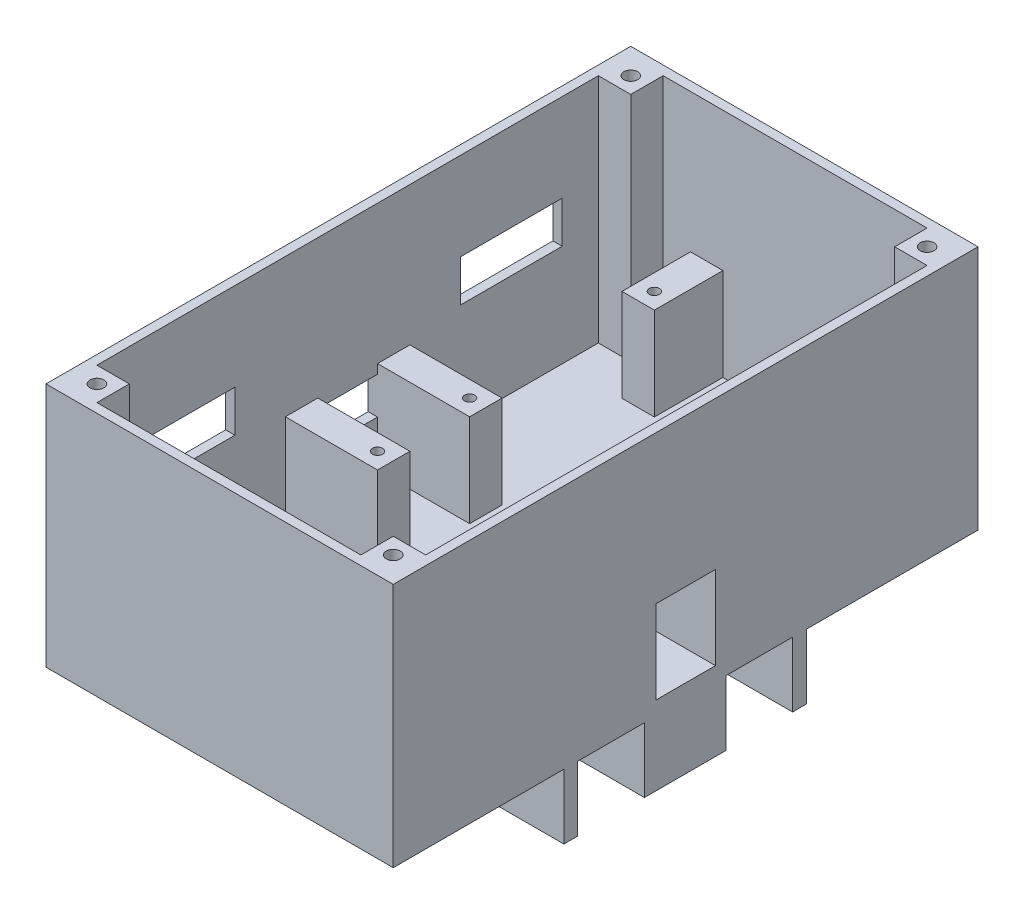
ISO-10303-21;
HEADER;
FILE_DESCRIPTION(('STEP AP214'),'2;1');
FILE_NAME('part.step','',(''),(''),'','','');
FILE_SCHEMA(('AUTOMOTIVE_DESIGN { 1 0 10303 214 1 1 1 1 }'));
ENDSEC;
DATA;
#1=APPLICATION_CONTEXT('core data for automotive mechanical design processes');
#2=APPLICATION_PROTOCOL_DEFINITION('international standard','automotive_design',2000,#1);
#3=PRODUCT_CONTEXT('',#1,'mechanical');
#4=PRODUCT('Part','Part','',(#3));
#5=PRODUCT_RELATED_PRODUCT_CATEGORY('part','',(#4));
#6=PRODUCT_DEFINITION_FORMATION('','',#4);
#7=PRODUCT_DEFINITION_CONTEXT('part definition',#1,'design');
#8=PRODUCT_DEFINITION('design','',#6,#7);
#9=PRODUCT_DEFINITION_SHAPE('','',#8);
#10=(LENGTH_UNIT() NAMED_UNIT(*) SI_UNIT(.MILLI.,.METRE.));
#11=(NAMED_UNIT(*) PLANE_ANGLE_UNIT() SI_UNIT($,.RADIAN.));
#12=(NAMED_UNIT(*) SI_UNIT($,.STERADIAN.) SOLID_ANGLE_UNIT());
#13=UNCERTAINTY_MEASURE_WITH_UNIT(LENGTH_MEASURE(1.E-05),#10,'distance_accuracy_value','');
#14=(GEOMETRIC_REPRESENTATION_CONTEXT(3) GLOBAL_UNCERTAINTY_ASSIGNED_CONTEXT((#13)) GLOBAL_UNIT_ASSIGNED_CONTEXT((#10,
#11,#12)) REPRESENTATION_CONTEXT('',''));
#15=CARTESIAN_POINT('',(0.,0.,0.));
#16=DIRECTION('',(0.,0.,1.));
#17=DIRECTION('',(1.,0.,0.));
#18=AXIS2_PLACEMENT_3D('',#15,#16,#17);
#19=CARTESIAN_POINT('',(0.,3.,0.));
#20=DIRECTION('',(0.,1.,0.));
#21=DIRECTION('',(0.,0.,1.));
#22=AXIS2_PLACEMENT_3D('',#19,#20,#21);
#23=PLANE('',#22);
#24=DIRECTION('',(1.,0.,0.));
#25=VECTOR('',#24,1.);
#26=CARTESIAN_POINT('',(0.,3.,91.8995807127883));
#27=LINE('',#26,#25);
#28=CARTESIAN_POINT('',(-66.0555555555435,3.,91.8995807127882));
#29=VERTEX_POINT('',#28);
#30=CARTESIAN_POINT('',(-59.0555555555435,3.,91.8995807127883));
#31=VERTEX_POINT('',#30);
#32=EDGE_CURVE('E58',#29,#31,#27,.T.);
#33=ORIENTED_EDGE('',*,*,#32,.T.);
#34=DIRECTION('',(0.,0.,-1.));
#35=VECTOR('',#34,1.);
#36=CARTESIAN_POINT('',(-59.0555555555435,3.,0.));
#37=LINE('',#36,#35);
#38=CARTESIAN_POINT('',(-59.0555555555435,3.,98.8995807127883));
#39=VERTEX_POINT('',#38);
#40=EDGE_CURVE('E564',#39,#31,#37,.T.);
#41=ORIENTED_EDGE('',*,*,#40,.F.);
#42=DIRECTION('',(1.,0.,0.));
#43=VECTOR('',#42,1.);
#44=CARTESIAN_POINT('',(-66.0555555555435,3.,98.8995807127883));
#45=LINE('',#44,#43);
#46=CARTESIAN_POINT('',(-53.1555555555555,3.,98.8995807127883));
#47=VERTEX_POINT('',#46);
#48=EDGE_CURVE('E549',#39,#47,#45,.T.);
#49=ORIENTED_EDGE('',*,*,#48,.T.);
#50=DIRECTION('',(0.,0.,-1.));
#51=VECTOR('',#50,1.);
#52=CARTESIAN_POINT('',(-53.1555555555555,3.,0.));
#53=LINE('',#52,#51);
#54=CARTESIAN_POINT('',(-53.1555555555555,3.,84.0995807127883));
#55=VERTEX_POINT('',#54);
#56=EDGE_CURVE('E861',#47,#55,#53,.T.);
#57=ORIENTED_EDGE('',*,*,#56,.T.);
#58=DIRECTION('',(-1.,0.,0.));
#59=VECTOR('',#58,1.);
#60=CARTESIAN_POINT('',(0.,3.,84.0995807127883));
#61=LINE('',#60,#59);
#62=CARTESIAN_POINT('',(-46.1555555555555,3.,84.0995807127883));
#63=VERTEX_POINT('',#62);
#64=EDGE_CURVE('E868',#63,#55,#61,.T.);
#65=ORIENTED_EDGE('',*,*,#64,.F.);
#66=DIRECTION('',(0.,0.,-1.));
#67=VECTOR('',#66,1.);
#68=CARTESIAN_POINT('',(-46.1555555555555,3.,0.));
#69=LINE('',#68,#67);
#70=CARTESIAN_POINT('',(-46.1555555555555,3.,98.8995807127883));
#71=VERTEX_POINT('',#70);
#72=EDGE_CURVE('E858',#71,#63,#69,.T.);
#73=ORIENTED_EDGE('',*,*,#72,.F.);
#74=CARTESIAN_POINT('',(-13.1555555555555,3.,98.8995807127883));
#75=VERTEX_POINT('',#74);
#76=EDGE_CURVE('E830',#71,#75,#45,.T.);
#77=ORIENTED_EDGE('',*,*,#76,.T.);
#78=DIRECTION('',(0.,0.,-1.));
#79=VECTOR('',#78,1.);
#80=CARTESIAN_POINT('',(-13.1555555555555,3.,0.));
#81=LINE('',#80,#79);
#82=CARTESIAN_POINT('',(-13.1555555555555,3.,84.0995807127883));
#83=VERTEX_POINT('',#82);
#84=EDGE_CURVE('E890',#75,#83,#81,.T.);
#85=ORIENTED_EDGE('',*,*,#84,.T.);
#86=DIRECTION('',(-1.,0.,0.));
#87=VECTOR('',#86,1.);
#88=CARTESIAN_POINT('',(0.,3.,84.0995807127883));
#89=LINE('',#88,#87);
#90=CARTESIAN_POINT('',(-6.15555555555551,3.,84.0995807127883));
#91=VERTEX_POINT('',#90);
#92=EDGE_CURVE('E895',#91,#83,#89,.T.);
#93=ORIENTED_EDGE('',*,*,#92,.F.);
#94=DIRECTION('',(0.,0.,-1.));
#95=VECTOR('',#94,1.);
#96=CARTESIAN_POINT('',(-6.15555555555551,3.,0.));
#97=LINE('',#96,#95);
#98=CARTESIAN_POINT('',(-6.15555555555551,3.,98.8995807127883));
#99=VERTEX_POINT('',#98);
#100=EDGE_CURVE('E887',#99,#91,#97,.T.);
#101=ORIENTED_EDGE('',*,*,#100,.F.);
#102=CARTESIAN_POINT('',(-2.05555555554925,3.,98.8995807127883));
#103=VERTEX_POINT('',#102);
#104=EDGE_CURVE('E827',#99,#103,#45,.T.);
#105=ORIENTED_EDGE('',*,*,#104,.T.);
#106=DIRECTION('',(0.,0.,-1.));
#107=VECTOR('',#106,1.);
#108=CARTESIAN_POINT('',(-2.05555555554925,3.,0.));
#109=LINE('',#108,#107);
#110=CARTESIAN_POINT('',(-2.05555555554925,3.,91.8995807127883));
#111=VERTEX_POINT('',#110);
#112=EDGE_CURVE('E552',#103,#111,#109,.T.);
#113=ORIENTED_EDGE('',*,*,#112,.T.);
#114=DIRECTION('',(-1.,0.,0.));
#115=VECTOR('',#114,1.);
#116=CARTESIAN_POINT('',(0.,3.,91.8995807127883));
#117=LINE('',#116,#115);
#118=CARTESIAN_POINT('',(4.94444444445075,3.,91.8995807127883));
#119=VERTEX_POINT('',#118);
#120=EDGE_CURVE('E572',#119,#111,#117,.T.);
#121=ORIENTED_EDGE('',*,*,#120,.F.);
#122=DIRECTION('',(0.,0.,-1.));
#123=VECTOR('',#122,1.);
#124=CARTESIAN_POINT('',(4.94444444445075,3.,98.8995807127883));
#125=LINE('',#124,#123);
#126=CARTESIAN_POINT('',(4.94444444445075,3.,51.1995807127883));
#127=VERTEX_POINT('',#126);
#128=EDGE_CURVE('E818',#119,#127,#125,.T.);
#129=ORIENTED_EDGE('',*,*,#128,.T.);
#130=DIRECTION('',(-1.,0.,0.));
#131=VECTOR('',#130,1.);
#132=CARTESIAN_POINT('',(0.,3.,51.1995807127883));
#133=LINE('',#132,#131);
#134=CARTESIAN_POINT('',(-13.1555555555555,3.,51.1995807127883));
#135=VERTEX_POINT('',#134);
#136=EDGE_CURVE('E1225',#127,#135,#133,.T.);
#137=ORIENTED_EDGE('',*,*,#136,.T.);
#138=DIRECTION('',(0.,0.,-1.));
#139=VECTOR('',#138,1.);
#140=CARTESIAN_POINT('',(-13.1555555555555,3.,0.));
#141=LINE('',#140,#139);
#142=CARTESIAN_POINT('',(-13.1555555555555,3.,44.1995807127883));
#143=VERTEX_POINT('',#142);
#144=EDGE_CURVE('E1227',#135,#143,#141,.T.);
#145=ORIENTED_EDGE('',*,*,#144,.T.);
#146=DIRECTION('',(-1.,0.,0.));
#147=VECTOR('',#146,1.);
#148=CARTESIAN_POINT('',(0.,3.,44.1995807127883));
#149=LINE('',#148,#147);
#150=CARTESIAN_POINT('',(6.94444444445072,3.,44.1995807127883));
#151=VERTEX_POINT('',#150);
#152=EDGE_CURVE('E1229',#151,#143,#149,.T.);
#153=ORIENTED_EDGE('',*,*,#152,.F.);
#154=DIRECTION('',(0.,0.,-1.));
#155=VECTOR('',#154,1.);
#156=CARTESIAN_POINT('',(6.9444444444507,3.,0.));
#157=LINE('',#156,#155);
#158=CARTESIAN_POINT('',(6.94444444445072,3.,31.2995807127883));
#159=VERTEX_POINT('',#158);
#160=EDGE_CURVE('E630',#151,#159,#157,.T.);
#161=ORIENTED_EDGE('',*,*,#160,.T.);
#162=DIRECTION('',(-1.,0.,0.));
#163=VECTOR('',#162,1.);
#164=CARTESIAN_POINT('',(0.,3.,31.2995807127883));
#165=LINE('',#164,#163);
#166=CARTESIAN_POINT('',(-13.1555555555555,3.,31.2995807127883));
#167=VERTEX_POINT('',#166);
#168=EDGE_CURVE('E1194',#159,#167,#165,.T.);
#169=ORIENTED_EDGE('',*,*,#168,.T.);
#170=DIRECTION('',(0.,0.,-1.));
#171=VECTOR('',#170,1.);
#172=CARTESIAN_POINT('',(-13.1555555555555,3.,0.));
#173=LINE('',#172,#171);
#174=CARTESIAN_POINT('',(-13.1555555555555,3.,24.2995807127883));
#175=VERTEX_POINT('',#174);
#176=EDGE_CURVE('E1196',#167,#175,#173,.T.);
#177=ORIENTED_EDGE('',*,*,#176,.T.);
#178=DIRECTION('',(-1.,0.,0.));
#179=VECTOR('',#178,1.);
#180=CARTESIAN_POINT('',(0.,3.,24.2995807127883));
#181=LINE('',#180,#179);
#182=CARTESIAN_POINT('',(4.94444444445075,3.,24.2995807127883));
#183=VERTEX_POINT('',#182);
#184=EDGE_CURVE('E1198',#183,#175,#181,.T.);
#185=ORIENTED_EDGE('',*,*,#184,.F.);
#186=CARTESIAN_POINT('',(4.94444444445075,3.,-16.4004192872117));
#187=VERTEX_POINT('',#186);
#188=EDGE_CURVE('E754',#183,#187,#125,.T.);
#189=ORIENTED_EDGE('',*,*,#188,.T.);
#190=DIRECTION('',(-1.,0.,0.));
#191=VECTOR('',#190,1.);
#192=CARTESIAN_POINT('',(0.,3.,-16.4004192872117));
#193=LINE('',#192,#191);
#194=CARTESIAN_POINT('',(-2.05555555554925,3.,-16.4004192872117));
#195=VERTEX_POINT('',#194);
#196=EDGE_CURVE('E592',#187,#195,#193,.T.);
#197=ORIENTED_EDGE('',*,*,#196,.T.);
#198=DIRECTION('',(0.,0.,1.));
#199=VECTOR('',#198,1.);
#200=CARTESIAN_POINT('',(-2.05555555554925,3.,0.));
#201=LINE('',#200,#199);
#202=CARTESIAN_POINT('',(-2.05555555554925,3.,-23.4004192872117));
#203=VERTEX_POINT('',#202);
#204=EDGE_CURVE('E587',#203,#195,#201,.T.);
#205=ORIENTED_EDGE('',*,*,#204,.F.);
#206=DIRECTION('',(-1.,0.,0.));
#207=VECTOR('',#206,1.);
#208=CARTESIAN_POINT('',(4.94444444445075,3.,-23.4004192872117));
#209=LINE('',#208,#207);
#210=CARTESIAN_POINT('',(-6.15555555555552,3.,-23.4004192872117));
#211=VERTEX_POINT('',#210);
#212=EDGE_CURVE('E821',#203,#211,#209,.T.);
#213=ORIENTED_EDGE('',*,*,#212,.T.);
#214=DIRECTION('',(0.,0.,-1.));
#215=VECTOR('',#214,1.);
#216=CARTESIAN_POINT('',(-6.15555555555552,3.,0.));
#217=LINE('',#216,#215);
#218=CARTESIAN_POINT('',(-6.15555555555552,3.,-8.60041928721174));
#219=VERTEX_POINT('',#218);
#220=EDGE_CURVE('E1184',#219,#211,#217,.T.);
#221=ORIENTED_EDGE('',*,*,#220,.F.);
#222=DIRECTION('',(-1.,0.,0.));
#223=VECTOR('',#222,1.);
#224=CARTESIAN_POINT('',(0.,3.,-8.60041928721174));
#225=LINE('',#224,#223);
#226=CARTESIAN_POINT('',(-13.1555555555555,3.,-8.60041928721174));
#227=VERTEX_POINT('',#226);
#228=EDGE_CURVE('E1187',#219,#227,#225,.T.);
#229=ORIENTED_EDGE('',*,*,#228,.T.);
#230=DIRECTION('',(0.,0.,-1.));
#231=VECTOR('',#230,1.);
#232=CARTESIAN_POINT('',(-13.1555555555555,3.,0.));
#233=LINE('',#232,#231);
#234=CARTESIAN_POINT('',(-13.1555555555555,3.,-23.4004192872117));
#235=VERTEX_POINT('',#234);
#236=EDGE_CURVE('E1189',#227,#235,#233,.T.);
#237=ORIENTED_EDGE('',*,*,#236,.T.);
#238=CARTESIAN_POINT('',(-46.1555555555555,3.,-23.4004192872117));
#239=VERTEX_POINT('',#238);
#240=EDGE_CURVE('E824',#235,#239,#209,.T.);
#241=ORIENTED_EDGE('',*,*,#240,.T.);
#242=DIRECTION('',(0.,0.,-1.));
#243=VECTOR('',#242,1.);
#244=CARTESIAN_POINT('',(-46.1555555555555,3.,0.));
#245=LINE('',#244,#243);
#246=CARTESIAN_POINT('',(-46.1555555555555,3.,-8.60041928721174));
#247=VERTEX_POINT('',#246);
#248=EDGE_CURVE('E1170',#247,#239,#245,.T.);
#249=ORIENTED_EDGE('',*,*,#248,.F.);
#250=DIRECTION('',(-1.,0.,0.));
#251=VECTOR('',#250,1.);
#252=CARTESIAN_POINT('',(0.,3.,-8.60041928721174));
#253=LINE('',#252,#251);
#254=CARTESIAN_POINT('',(-53.1555555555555,3.,-8.60041928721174));
#255=VERTEX_POINT('',#254);
#256=EDGE_CURVE('E1177',#247,#255,#253,.T.);
#257=ORIENTED_EDGE('',*,*,#256,.T.);
#258=DIRECTION('',(0.,0.,-1.));
#259=VECTOR('',#258,1.);
#260=CARTESIAN_POINT('',(-53.1555555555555,3.,0.));
#261=LINE('',#260,#259);
#262=CARTESIAN_POINT('',(-53.1555555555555,3.,-23.4004192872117));
#263=VERTEX_POINT('',#262);
#264=EDGE_CURVE('E1179',#255,#263,#261,.T.);
#265=ORIENTED_EDGE('',*,*,#264,.T.);
#266=CARTESIAN_POINT('',(-59.0555555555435,3.,-23.4004192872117));
#267=VERTEX_POINT('',#266);
#268=EDGE_CURVE('E820',#263,#267,#209,.T.);
#269=ORIENTED_EDGE('',*,*,#268,.T.);
#270=DIRECTION('',(0.,0.,1.));
#271=VECTOR('',#270,1.);
#272=CARTESIAN_POINT('',(-59.0555555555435,3.,0.));
#273=LINE('',#272,#271);
#274=CARTESIAN_POINT('',(-59.0555555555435,3.,-16.4004192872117));
#275=VERTEX_POINT('',#274);
#276=EDGE_CURVE('E608',#267,#275,#273,.T.);
#277=ORIENTED_EDGE('',*,*,#276,.T.);
#278=DIRECTION('',(1.,0.,0.));
#279=VECTOR('',#278,1.);
#280=CARTESIAN_POINT('',(0.,3.,-16.4004192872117));
#281=LINE('',#280,#279);
#282=CARTESIAN_POINT('',(-66.0555555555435,3.,-16.4004192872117));
#283=VERTEX_POINT('',#282);
#284=EDGE_CURVE('E613',#283,#275,#281,.T.);
#285=ORIENTED_EDGE('',*,*,#284,.F.);
#286=DIRECTION('',(0.,0.,1.));
#287=VECTOR('',#286,1.);
#288=CARTESIAN_POINT('',(-66.0555555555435,3.,-23.4004192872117));
#289=LINE('',#288,#287);
#290=CARTESIAN_POINT('',(-66.0555555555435,3.,24.2995807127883));
#291=VERTEX_POINT('',#290);
#292=EDGE_CURVE('E825',#283,#291,#289,.T.);
#293=ORIENTED_EDGE('',*,*,#292,.T.);
#294=DIRECTION('',(-1.,0.,0.));
#295=VECTOR('',#294,1.);
#296=CARTESIAN_POINT('',(0.,3.,24.2995807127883));
#297=LINE('',#296,#295);
#298=CARTESIAN_POINT('',(-46.1555555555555,3.,24.2995807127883));
#299=VERTEX_POINT('',#298);
#300=EDGE_CURVE('E1209',#299,#291,#297,.T.);
#301=ORIENTED_EDGE('',*,*,#300,.F.);
#302=DIRECTION('',(0.,0.,-1.));
#303=VECTOR('',#302,1.);
#304=CARTESIAN_POINT('',(-46.1555555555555,3.,0.));
#305=LINE('',#304,#303);
#306=CARTESIAN_POINT('',(-46.1555555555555,3.,31.2995807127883));
#307=VERTEX_POINT('',#306);
#308=EDGE_CURVE('E1204',#307,#299,#305,.T.);
#309=ORIENTED_EDGE('',*,*,#308,.F.);
#310=DIRECTION('',(-1.,0.,0.));
#311=VECTOR('',#310,1.);
#312=CARTESIAN_POINT('',(0.,3.,31.2995807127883));
#313=LINE('',#312,#311);
#314=CARTESIAN_POINT('',(-66.0555555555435,3.,31.2995807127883));
#315=VERTEX_POINT('',#314);
#316=EDGE_CURVE('E1207',#307,#315,#313,.T.);
#317=ORIENTED_EDGE('',*,*,#316,.T.);
#318=CARTESIAN_POINT('',(-66.0555555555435,3.,44.1995807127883));
#319=VERTEX_POINT('',#318);
#320=EDGE_CURVE('E828',#315,#319,#289,.T.);
#321=ORIENTED_EDGE('',*,*,#320,.T.);
#322=DIRECTION('',(-1.,0.,0.));
#323=VECTOR('',#322,1.);
#324=CARTESIAN_POINT('',(0.,3.,44.1995807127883));
#325=LINE('',#324,#323);
#326=CARTESIAN_POINT('',(-46.1555555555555,3.,44.1995807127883));
#327=VERTEX_POINT('',#326);
#328=EDGE_CURVE('E1220',#327,#319,#325,.T.);
#329=ORIENTED_EDGE('',*,*,#328,.F.);
#330=DIRECTION('',(0.,0.,-1.));
#331=VECTOR('',#330,1.);
#332=CARTESIAN_POINT('',(-46.1555555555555,3.,0.));
#333=LINE('',#332,#331);
#334=CARTESIAN_POINT('',(-46.1555555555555,3.,51.1995807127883));
#335=VERTEX_POINT('',#334);
#336=EDGE_CURVE('E1215',#335,#327,#333,.T.);
#337=ORIENTED_EDGE('',*,*,#336,.F.);
#338=DIRECTION('',(-1.,0.,0.));
#339=VECTOR('',#338,1.);
#340=CARTESIAN_POINT('',(0.,3.,51.1995807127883));
#341=LINE('',#340,#339);
#342=CARTESIAN_POINT('',(-66.0555555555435,3.,51.1995807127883));
#343=VERTEX_POINT('',#342);
#344=EDGE_CURVE('E1218',#335,#343,#341,.T.);
#345=ORIENTED_EDGE('',*,*,#344,.T.);
#346=EDGE_CURVE('E823',#343,#29,#289,.T.);
#347=ORIENTED_EDGE('',*,*,#346,.T.);
#348=EDGE_LOOP('',(#33,#41,#49,#57,#65,#73,#77,#85,#93,#101,#105,#113,#121,#129,#137,#145,#153,
#161,#169,#177,#185,#189,#197,#205,#213,#221,#229,#237,#241,#249,#257,#265,#269,#277,#285,#293,
#301,#309,#317,#321,#329,#337,#345,#347));
#349=FACE_BOUND('',#348,.T.);
#350=ADVANCED_FACE('F43',(#349),#23,.T.);
#351=CARTESIAN_POINT('',(-66.0555555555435,53.,98.8995807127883));
#352=DIRECTION('',(0.,0.,-1.));
#353=DIRECTION('',(-1.,0.,0.));
#354=AXIS2_PLACEMENT_3D('',#351,#352,#353);
#355=PLANE('',#354);
#356=ORIENTED_EDGE('',*,*,#48,.F.);
#357=DIRECTION('',(0.,-1.,0.));
#358=VECTOR('',#357,1.);
#359=CARTESIAN_POINT('',(-59.0555555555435,53.,98.8995807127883));
#360=LINE('',#359,#358);
#361=CARTESIAN_POINT('',(-59.0555555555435,53.,98.8995807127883));
#362=VERTEX_POINT('',#361);
#363=EDGE_CURVE('E546',#362,#39,#360,.T.);
#364=ORIENTED_EDGE('',*,*,#363,.F.);
#365=DIRECTION('',(1.,0.,0.));
#366=VECTOR('',#365,1.);
#367=CARTESIAN_POINT('',(-66.0555555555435,53.,98.8995807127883));
#368=LINE('',#367,#366);
#369=CARTESIAN_POINT('',(-2.05555555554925,53.,98.8995807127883));
#370=VERTEX_POINT('',#369);
#371=EDGE_CURVE('E528',#362,#370,#368,.T.);
#372=ORIENTED_EDGE('',*,*,#371,.T.);
#373=DIRECTION('',(0.,-1.,0.));
#374=VECTOR('',#373,1.);
#375=CARTESIAN_POINT('',(-2.05555555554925,53.,98.8995807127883));
#376=LINE('',#375,#374);
#377=EDGE_CURVE('E585',#370,#103,#376,.T.);
#378=ORIENTED_EDGE('',*,*,#377,.T.);
#379=ORIENTED_EDGE('',*,*,#104,.F.);
#380=DIRECTION('',(0.,-1.,0.));
#381=VECTOR('',#380,1.);
#382=CARTESIAN_POINT('',(-6.15555555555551,37.6768525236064,98.8995807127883));
#383=LINE('',#382,#381);
#384=CARTESIAN_POINT('',(-6.15555555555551,23.,98.8995807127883));
#385=VERTEX_POINT('',#384);
#386=EDGE_CURVE('E672',#385,#99,#383,.T.);
#387=ORIENTED_EDGE('',*,*,#386,.F.);
#388=DIRECTION('',(1.,0.,0.));
#389=VECTOR('',#388,1.);
#390=CARTESIAN_POINT('',(0.,23.,98.8995807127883));
#391=LINE('',#390,#389);
#392=CARTESIAN_POINT('',(-13.1555555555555,23.,98.8995807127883));
#393=VERTEX_POINT('',#392);
#394=EDGE_CURVE('E677',#393,#385,#391,.T.);
#395=ORIENTED_EDGE('',*,*,#394,.F.);
#396=DIRECTION('',(0.,-1.,0.));
#397=VECTOR('',#396,1.);
#398=CARTESIAN_POINT('',(-13.1555555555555,37.6768525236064,98.8995807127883));
#399=LINE('',#398,#397);
#400=EDGE_CURVE('E681',#393,#75,#399,.T.);
#401=ORIENTED_EDGE('',*,*,#400,.T.);
#402=ORIENTED_EDGE('',*,*,#76,.F.);
#403=DIRECTION('',(0.,-1.,0.));
#404=VECTOR('',#403,1.);
#405=CARTESIAN_POINT('',(-46.1555555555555,37.6768525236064,98.8995807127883));
#406=LINE('',#405,#404);
#407=CARTESIAN_POINT('',(-46.1555555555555,23.,98.8995807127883));
#408=VERTEX_POINT('',#407);
#409=EDGE_CURVE('E662',#408,#71,#406,.T.);
#410=ORIENTED_EDGE('',*,*,#409,.F.);
#411=DIRECTION('',(1.,0.,0.));
#412=VECTOR('',#411,1.);
#413=CARTESIAN_POINT('',(0.,23.,98.8995807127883));
#414=LINE('',#413,#412);
#415=CARTESIAN_POINT('',(-53.1555555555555,23.,98.8995807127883));
#416=VERTEX_POINT('',#415);
#417=EDGE_CURVE('E669',#416,#408,#414,.T.);
#418=ORIENTED_EDGE('',*,*,#417,.F.);
#419=DIRECTION('',(0.,-1.,0.));
#420=VECTOR('',#419,1.);
#421=CARTESIAN_POINT('',(-53.1555555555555,37.6768525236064,98.8995807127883));
#422=LINE('',#421,#420);
#423=EDGE_CURVE('E673',#416,#47,#422,.T.);
#424=ORIENTED_EDGE('',*,*,#423,.T.);
#425=EDGE_LOOP('',(#356,#364,#372,#378,#379,#387,#395,#401,#402,#410,#418,#424));
#426=FACE_BOUND('',#425,.T.);
#427=ADVANCED_FACE('F547',(#426),#355,.T.);
#428=CARTESIAN_POINT('',(4.94444444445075,53.,98.8995807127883));
#429=DIRECTION('',(-1.,0.,0.));
#430=DIRECTION('',(0.,0.,1.));
#431=AXIS2_PLACEMENT_3D('',#428,#429,#430);
#432=PLANE('',#431);
#433=ORIENTED_EDGE('',*,*,#128,.F.);
#434=DIRECTION('',(0.,-1.,0.));
#435=VECTOR('',#434,1.);
#436=CARTESIAN_POINT('',(4.94444444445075,53.,91.8995807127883));
#437=LINE('',#436,#435);
#438=CARTESIAN_POINT('',(4.94444444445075,53.,91.8995807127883));
#439=VERTEX_POINT('',#438);
#440=EDGE_CURVE('E582',#439,#119,#437,.T.);
#441=ORIENTED_EDGE('',*,*,#440,.F.);
#442=DIRECTION('',(0.,0.,-1.));
#443=VECTOR('',#442,1.);
#444=CARTESIAN_POINT('',(4.94444444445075,53.,98.8995807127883));
#445=LINE('',#444,#443);
#446=CARTESIAN_POINT('',(4.94444444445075,53.,-16.4004192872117));
#447=VERTEX_POINT('',#446);
#448=EDGE_CURVE('E813',#439,#447,#445,.T.);
#449=ORIENTED_EDGE('',*,*,#448,.T.);
#450=DIRECTION('',(0.,-1.,0.));
#451=VECTOR('',#450,1.);
#452=CARTESIAN_POINT('',(4.94444444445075,53.,-16.4004192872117));
#453=LINE('',#452,#451);
#454=EDGE_CURVE('E597',#447,#187,#453,.T.);
#455=ORIENTED_EDGE('',*,*,#454,.T.);
#456=ORIENTED_EDGE('',*,*,#188,.F.);
#457=DIRECTION('',(0.,-1.,0.));
#458=VECTOR('',#457,1.);
#459=CARTESIAN_POINT('',(4.94444444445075,37.6768525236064,24.2995807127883));
#460=LINE('',#459,#458);
#461=CARTESIAN_POINT('',(4.94444444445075,23.,24.2995807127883));
#462=VERTEX_POINT('',#461);
#463=EDGE_CURVE('E697',#462,#183,#460,.T.);
#464=ORIENTED_EDGE('',*,*,#463,.F.);
#465=DIRECTION('',(0.,0.,-1.));
#466=VECTOR('',#465,1.);
#467=CARTESIAN_POINT('',(4.94444444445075,23.,0.));
#468=LINE('',#467,#466);
#469=CARTESIAN_POINT('',(4.94444444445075,23.,31.2995807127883));
#470=VERTEX_POINT('',#469);
#471=EDGE_CURVE('E692',#470,#462,#468,.T.);
#472=ORIENTED_EDGE('',*,*,#471,.F.);
#473=DIRECTION('',(0.,-1.,0.));
#474=VECTOR('',#473,1.);
#475=CARTESIAN_POINT('',(4.94444444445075,37.6768525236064,31.2995807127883));
#476=LINE('',#475,#474);
#477=CARTESIAN_POINT('',(4.94444444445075,21.,31.2995807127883));
#478=VERTEX_POINT('',#477);
#479=EDGE_CURVE('E698',#470,#478,#476,.T.);
#480=ORIENTED_EDGE('',*,*,#479,.T.);
#481=DIRECTION('',(0.,0.,-1.));
#482=VECTOR('',#481,1.);
#483=CARTESIAN_POINT('',(4.94444444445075,21.,0.));
#484=LINE('',#483,#482);
#485=CARTESIAN_POINT('',(4.94444444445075,21.,44.1995807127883));
#486=VERTEX_POINT('',#485);
#487=EDGE_CURVE('E633',#486,#478,#484,.T.);
#488=ORIENTED_EDGE('',*,*,#487,.F.);
#489=DIRECTION('',(0.,-1.,0.));
#490=VECTOR('',#489,1.);
#491=CARTESIAN_POINT('',(4.94444444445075,37.6768525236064,44.1995807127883));
#492=LINE('',#491,#490);
#493=CARTESIAN_POINT('',(4.94444444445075,23.,44.1995807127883));
#494=VERTEX_POINT('',#493);
#495=EDGE_CURVE('E688',#494,#486,#492,.T.);
#496=ORIENTED_EDGE('',*,*,#495,.F.);
#497=DIRECTION('',(0.,0.,-1.));
#498=VECTOR('',#497,1.);
#499=CARTESIAN_POINT('',(4.94444444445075,23.,0.));
#500=LINE('',#499,#498);
#501=CARTESIAN_POINT('',(4.94444444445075,23.,51.1995807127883));
#502=VERTEX_POINT('',#501);
#503=EDGE_CURVE('E680',#502,#494,#500,.T.);
#504=ORIENTED_EDGE('',*,*,#503,.F.);
#505=DIRECTION('',(0.,-1.,0.));
#506=VECTOR('',#505,1.);
#507=CARTESIAN_POINT('',(4.94444444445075,37.6768525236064,51.1995807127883));
#508=LINE('',#507,#506);
#509=EDGE_CURVE('E689',#502,#127,#508,.T.);
#510=ORIENTED_EDGE('',*,*,#509,.T.);
#511=EDGE_LOOP('',(#433,#441,#449,#455,#456,#464,#472,#480,#488,#496,#504,#510));
#512=FACE_BOUND('',#511,.T.);
#513=ADVANCED_FACE('F1267',(#512),#432,.T.);
#514=CARTESIAN_POINT('',(4.94444444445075,53.,-23.4004192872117));
#515=DIRECTION('',(0.,0.,1.));
#516=DIRECTION('',(1.,0.,0.));
#517=AXIS2_PLACEMENT_3D('',#514,#515,#516);
#518=PLANE('',#517);
#519=ORIENTED_EDGE('',*,*,#212,.F.);
#520=DIRECTION('',(0.,-1.,0.));
#521=VECTOR('',#520,1.);
#522=CARTESIAN_POINT('',(-2.05555555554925,53.,-23.4004192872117));
#523=LINE('',#522,#521);
#524=CARTESIAN_POINT('',(-2.05555555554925,53.,-23.4004192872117));
#525=VERTEX_POINT('',#524);
#526=EDGE_CURVE('E605',#525,#203,#523,.T.);
#527=ORIENTED_EDGE('',*,*,#526,.F.);
#528=DIRECTION('',(-1.,0.,0.));
#529=VECTOR('',#528,1.);
#530=CARTESIAN_POINT('',(4.94444444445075,53.,-23.4004192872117));
#531=LINE('',#530,#529);
#532=CARTESIAN_POINT('',(-59.0555555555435,53.,-23.4004192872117));
#533=VERTEX_POINT('',#532);
#534=EDGE_CURVE('E815',#525,#533,#531,.T.);
#535=ORIENTED_EDGE('',*,*,#534,.T.);
#536=DIRECTION('',(0.,-1.,0.));
#537=VECTOR('',#536,1.);
#538=CARTESIAN_POINT('',(-59.0555555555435,53.,-23.4004192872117));
#539=LINE('',#538,#537);
#540=EDGE_CURVE('E627',#533,#267,#539,.T.);
#541=ORIENTED_EDGE('',*,*,#540,.T.);
#542=ORIENTED_EDGE('',*,*,#268,.F.);
#543=DIRECTION('',(0.,-1.,0.));
#544=VECTOR('',#543,1.);
#545=CARTESIAN_POINT('',(-53.1555555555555,37.6768525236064,-23.4004192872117));
#546=LINE('',#545,#544);
#547=CARTESIAN_POINT('',(-53.1555555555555,23.,-23.4004192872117));
#548=VERTEX_POINT('',#547);
#549=EDGE_CURVE('E715',#548,#263,#546,.T.);
#550=ORIENTED_EDGE('',*,*,#549,.F.);
#551=DIRECTION('',(-1.,0.,0.));
#552=VECTOR('',#551,1.);
#553=CARTESIAN_POINT('',(0.,23.,-23.4004192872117));
#554=LINE('',#553,#552);
#555=CARTESIAN_POINT('',(-46.1555555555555,23.,-23.4004192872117));
#556=VERTEX_POINT('',#555);
#557=EDGE_CURVE('E710',#556,#548,#554,.T.);
#558=ORIENTED_EDGE('',*,*,#557,.F.);
#559=DIRECTION('',(0.,-1.,0.));
#560=VECTOR('',#559,1.);
#561=CARTESIAN_POINT('',(-46.1555555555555,37.6768525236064,-23.4004192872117));
#562=LINE('',#561,#560);
#563=EDGE_CURVE('E716',#556,#239,#562,.T.);
#564=ORIENTED_EDGE('',*,*,#563,.T.);
#565=ORIENTED_EDGE('',*,*,#240,.F.);
#566=DIRECTION('',(0.,-1.,0.));
#567=VECTOR('',#566,1.);
#568=CARTESIAN_POINT('',(-13.1555555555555,37.6768525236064,-23.4004192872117));
#569=LINE('',#568,#567);
#570=CARTESIAN_POINT('',(-13.1555555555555,23.,-23.4004192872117));
#571=VERTEX_POINT('',#570);
#572=EDGE_CURVE('E706',#571,#235,#569,.T.);
#573=ORIENTED_EDGE('',*,*,#572,.F.);
#574=DIRECTION('',(-1.,0.,0.));
#575=VECTOR('',#574,1.);
#576=CARTESIAN_POINT('',(0.,23.,-23.4004192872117));
#577=LINE('',#576,#575);
#578=CARTESIAN_POINT('',(-6.15555555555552,23.,-23.4004192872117));
#579=VERTEX_POINT('',#578);
#580=EDGE_CURVE('E701',#579,#571,#577,.T.);
#581=ORIENTED_EDGE('',*,*,#580,.F.);
#582=DIRECTION('',(0.,-1.,0.));
#583=VECTOR('',#582,1.);
#584=CARTESIAN_POINT('',(-6.15555555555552,37.6768525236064,-23.4004192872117));
#585=LINE('',#584,#583);
#586=EDGE_CURVE('E707',#579,#211,#585,.T.);
#587=ORIENTED_EDGE('',*,*,#586,.T.);
#588=EDGE_LOOP('',(#519,#527,#535,#541,#542,#550,#558,#564,#565,#573,#581,#587));
#589=FACE_BOUND('',#588,.T.);
#590=ADVANCED_FACE('F1483',(#589),#518,.T.);
#591=CARTESIAN_POINT('',(-66.0555555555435,53.,-23.4004192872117));
#592=DIRECTION('',(1.,0.,0.));
#593=DIRECTION('',(0.,0.,-1.));
#594=AXIS2_PLACEMENT_3D('',#591,#592,#593);
#595=PLANE('',#594);
#596=DIRECTION('',(0.,-1.,0.));
#597=VECTOR('',#596,1.);
#598=CARTESIAN_POINT('',(-66.0555555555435,53.,91.8995807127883));
#599=LINE('',#598,#597);
#600=CARTESIAN_POINT('',(-66.0555555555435,53.,91.8995807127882));
#601=VERTEX_POINT('',#600);
#602=EDGE_CURVE('E66',#601,#29,#599,.T.);
#603=ORIENTED_EDGE('',*,*,#602,.T.);
#604=ORIENTED_EDGE('',*,*,#346,.F.);
#605=DIRECTION('',(0.,-1.,0.));
#606=VECTOR('',#605,1.);
#607=CARTESIAN_POINT('',(-66.0555555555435,37.6768525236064,51.1995807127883));
#608=LINE('',#607,#606);
#609=CARTESIAN_POINT('',(-66.0555555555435,23.,51.1995807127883));
#610=VERTEX_POINT('',#609);
#611=EDGE_CURVE('E652',#610,#343,#608,.T.);
#612=ORIENTED_EDGE('',*,*,#611,.F.);
#613=DIRECTION('',(0.,0.,1.));
#614=VECTOR('',#613,1.);
#615=CARTESIAN_POINT('',(-66.0555555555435,23.,0.));
#616=LINE('',#615,#614);
#617=CARTESIAN_POINT('',(-66.0555555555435,23.,44.1995807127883));
#618=VERTEX_POINT('',#617);
#619=EDGE_CURVE('E646',#618,#610,#616,.T.);
#620=ORIENTED_EDGE('',*,*,#619,.F.);
#621=DIRECTION('',(0.,-1.,0.));
#622=VECTOR('',#621,1.);
#623=CARTESIAN_POINT('',(-66.0555555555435,37.6768525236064,44.1995807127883));
#624=LINE('',#623,#622);
#625=CARTESIAN_POINT('',(-66.0555555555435,21.,44.1995807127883));
#626=VERTEX_POINT('',#625);
#627=EDGE_CURVE('E653',#618,#626,#624,.T.);
#628=ORIENTED_EDGE('',*,*,#627,.T.);
#629=DIRECTION('',(0.,0.,1.));
#630=VECTOR('',#629,1.);
#631=CARTESIAN_POINT('',(-66.0555555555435,21.,0.));
#632=LINE('',#631,#630);
#633=CARTESIAN_POINT('',(-66.0555555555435,21.,31.2995807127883));
#634=VERTEX_POINT('',#633);
#635=EDGE_CURVE('E747',#634,#626,#632,.T.);
#636=ORIENTED_EDGE('',*,*,#635,.F.);
#637=DIRECTION('',(0.,-1.,0.));
#638=VECTOR('',#637,1.);
#639=CARTESIAN_POINT('',(-66.0555555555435,37.6768525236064,31.2995807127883));
#640=LINE('',#639,#638);
#641=CARTESIAN_POINT('',(-66.0555555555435,23.,31.2995807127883));
#642=VERTEX_POINT('',#641);
#643=EDGE_CURVE('E666',#642,#634,#640,.T.);
#644=ORIENTED_EDGE('',*,*,#643,.F.);
#645=DIRECTION('',(0.,0.,1.));
#646=VECTOR('',#645,1.);
#647=CARTESIAN_POINT('',(-66.0555555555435,23.,0.));
#648=LINE('',#647,#646);
#649=CARTESIAN_POINT('',(-66.0555555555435,23.,24.2995807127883));
#650=VERTEX_POINT('',#649);
#651=EDGE_CURVE('E659',#650,#642,#648,.T.);
#652=ORIENTED_EDGE('',*,*,#651,.F.);
#653=DIRECTION('',(0.,-1.,0.));
#654=VECTOR('',#653,1.);
#655=CARTESIAN_POINT('',(-66.0555555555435,37.6768525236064,24.2995807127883));
#656=LINE('',#655,#654);
#657=EDGE_CURVE('E663',#650,#291,#656,.T.);
#658=ORIENTED_EDGE('',*,*,#657,.T.);
#659=ORIENTED_EDGE('',*,*,#292,.F.);
#660=DIRECTION('',(0.,-1.,0.));
#661=VECTOR('',#660,1.);
#662=CARTESIAN_POINT('',(-66.0555555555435,53.,-16.4004192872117));
#663=LINE('',#662,#661);
#664=CARTESIAN_POINT('',(-66.0555555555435,53.,-16.4004192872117));
#665=VERTEX_POINT('',#664);
#666=EDGE_CURVE('E624',#665,#283,#663,.T.);
#667=ORIENTED_EDGE('',*,*,#666,.F.);
#668=DIRECTION('',(0.,0.,1.));
#669=VECTOR('',#668,1.);
#670=CARTESIAN_POINT('',(-66.0555555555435,53.,-23.4004192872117));
#671=LINE('',#670,#669);
#672=EDGE_CURVE('E542',#665,#601,#671,.T.);
#673=ORIENTED_EDGE('',*,*,#672,.T.);
#674=EDGE_LOOP('',(#603,#604,#612,#620,#628,#636,#644,#652,#658,#659,#667,#673));
#675=FACE_BOUND('',#674,.T.);
#676=DIRECTION('',(0.,1.,0.));
#677=VECTOR('',#676,1.);
#678=CARTESIAN_POINT('',(-66.0555555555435,0.,13.3995807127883));
#679=LINE('',#678,#677);
#680=CARTESIAN_POINT('',(-66.0555555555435,25.,13.3995807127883));
#681=VERTEX_POINT('',#680);
#682=CARTESIAN_POINT('',(-66.0555555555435,34.,13.3995807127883));
#683=VERTEX_POINT('',#682);
#684=EDGE_CURVE('E734',#681,#683,#679,.T.);
#685=ORIENTED_EDGE('',*,*,#684,.T.);
#686=DIRECTION('',(0.,0.,1.));
#687=VECTOR('',#686,1.);
#688=CARTESIAN_POINT('',(-66.0555555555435,34.,0.));
#689=LINE('',#688,#687);
#690=CARTESIAN_POINT('',(-66.0555555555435,34.,-8.60041928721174));
#691=VERTEX_POINT('',#690);
#692=EDGE_CURVE('E738',#691,#683,#689,.T.);
#693=ORIENTED_EDGE('',*,*,#692,.F.);
#694=DIRECTION('',(0.,1.,0.));
#695=VECTOR('',#694,1.);
#696=CARTESIAN_POINT('',(-66.0555555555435,0.,-8.60041928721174));
#697=LINE('',#696,#695);
#698=CARTESIAN_POINT('',(-66.0555555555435,25.,-8.60041928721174));
#699=VERTEX_POINT('',#698);
#700=EDGE_CURVE('E745',#699,#691,#697,.T.);
#701=ORIENTED_EDGE('',*,*,#700,.F.);
#702=DIRECTION('',(0.,0.,1.));
#703=VECTOR('',#702,1.);
#704=CARTESIAN_POINT('',(-66.0555555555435,25.,0.));
#705=LINE('',#704,#703);
#706=EDGE_CURVE('E725',#699,#681,#705,.T.);
#707=ORIENTED_EDGE('',*,*,#706,.T.);
#708=EDGE_LOOP('',(#685,#693,#701,#707));
#709=FACE_BOUND('',#708,.T.);
#710=DIRECTION('',(0.,0.,-1.));
#711=VECTOR('',#710,1.);
#712=CARTESIAN_POINT('',(-66.0555555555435,34.,0.));
#713=LINE('',#712,#711);
#714=CARTESIAN_POINT('',(-66.0555555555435,34.,84.0995807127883));
#715=VERTEX_POINT('',#714);
#716=CARTESIAN_POINT('',(-66.0555555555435,34.,62.0995807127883));
#717=VERTEX_POINT('',#716);
#718=EDGE_CURVE('E796',#715,#717,#713,.T.);
#719=ORIENTED_EDGE('',*,*,#718,.T.);
#720=DIRECTION('',(0.,1.,0.));
#721=VECTOR('',#720,1.);
#722=CARTESIAN_POINT('',(-66.0555555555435,0.,62.0995807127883));
#723=LINE('',#722,#721);
#724=CARTESIAN_POINT('',(-66.0555555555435,25.,62.0995807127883));
#725=VERTEX_POINT('',#724);
#726=EDGE_CURVE('E781',#725,#717,#723,.T.);
#727=ORIENTED_EDGE('',*,*,#726,.F.);
#728=DIRECTION('',(0.,0.,-1.));
#729=VECTOR('',#728,1.);
#730=CARTESIAN_POINT('',(-66.0555555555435,25.,0.));
#731=LINE('',#730,#729);
#732=CARTESIAN_POINT('',(-66.0555555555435,25.,84.0995807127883));
#733=VERTEX_POINT('',#732);
#734=EDGE_CURVE('E785',#733,#725,#731,.T.);
#735=ORIENTED_EDGE('',*,*,#734,.F.);
#736=DIRECTION('',(0.,1.,0.));
#737=VECTOR('',#736,1.);
#738=CARTESIAN_POINT('',(-66.0555555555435,0.,84.0995807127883));
#739=LINE('',#738,#737);
#740=EDGE_CURVE('E797',#733,#715,#739,.T.);
#741=ORIENTED_EDGE('',*,*,#740,.T.);
#742=EDGE_LOOP('',(#719,#727,#735,#741));
#743=FACE_BOUND('',#742,.T.);
#744=ADVANCED_FACE('F1479',(#675,#709,#743),#595,.T.);
#745=CARTESIAN_POINT('',(6.9444444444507,0.,0.));
#746=DIRECTION('',(1.,0.,0.));
#747=DIRECTION('',(0.,0.,-1.));
#748=AXIS2_PLACEMENT_3D('',#745,#746,#747);
#749=PLANE('',#748);
#750=DIRECTION('',(0.,1.,0.));
#751=VECTOR('',#750,1.);
#752=CARTESIAN_POINT('',(6.94444444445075,0.,-25.4004192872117));
#753=LINE('',#752,#751);
#754=CARTESIAN_POINT('',(6.94444444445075,0.,-25.4004192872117));
#755=VERTEX_POINT('',#754);
#756=CARTESIAN_POINT('',(6.94444444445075,53.,-25.4004192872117));
#757=VERTEX_POINT('',#756);
#758=EDGE_CURVE('E1151',#755,#757,#753,.T.);
#759=ORIENTED_EDGE('',*,*,#758,.T.);
#760=DIRECTION('',(0.,0.,-1.));
#761=VECTOR('',#760,1.);
#762=CARTESIAN_POINT('',(6.94444444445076,53.,100.899580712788));
#763=LINE('',#762,#761);
#764=CARTESIAN_POINT('',(6.94444444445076,53.,100.899580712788));
#765=VERTEX_POINT('',#764);
#766=EDGE_CURVE('E541',#765,#757,#763,.T.);
#767=ORIENTED_EDGE('',*,*,#766,.F.);
#768=DIRECTION('',(0.,1.,0.));
#769=VECTOR('',#768,1.);
#770=CARTESIAN_POINT('',(6.94444444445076,0.,100.899580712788));
#771=LINE('',#770,#769);
#772=CARTESIAN_POINT('',(6.94444444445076,0.,100.899580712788));
#773=VERTEX_POINT('',#772);
#774=EDGE_CURVE('E1153',#773,#765,#771,.T.);
#775=ORIENTED_EDGE('',*,*,#774,.F.);
#776=DIRECTION('',(0.,0.,-1.));
#777=VECTOR('',#776,1.);
#778=CARTESIAN_POINT('',(6.9444444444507,0.,0.));
#779=LINE('',#778,#777);
#780=CARTESIAN_POINT('',(6.94444444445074,0.,64.0495807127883));
#781=VERTEX_POINT('',#780);
#782=EDGE_CURVE('E1148',#773,#781,#779,.T.);
#783=ORIENTED_EDGE('',*,*,#782,.T.);
#784=DIRECTION('',(0.,-1.,0.));
#785=VECTOR('',#784,1.);
#786=CARTESIAN_POINT('',(6.9444444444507,0.,64.0495807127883));
#787=LINE('',#786,#785);
#788=CARTESIAN_POINT('',(6.9444444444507,-14.,64.0495807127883));
#789=VERTEX_POINT('',#788);
#790=EDGE_CURVE('E1131',#781,#789,#787,.T.);
#791=ORIENTED_EDGE('',*,*,#790,.T.);
#792=DIRECTION('',(0.,0.,-1.));
#793=VECTOR('',#792,1.);
#794=CARTESIAN_POINT('',(6.9444444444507,-14.,0.));
#795=LINE('',#794,#793);
#796=CARTESIAN_POINT('',(6.9444444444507,-14.,61.0495807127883));
#797=VERTEX_POINT('',#796);
#798=EDGE_CURVE('E1127',#789,#797,#795,.T.);
#799=ORIENTED_EDGE('',*,*,#798,.T.);
#800=DIRECTION('',(0.,-1.,0.));
#801=VECTOR('',#800,1.);
#802=CARTESIAN_POINT('',(6.9444444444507,0.,61.0495807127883));
#803=LINE('',#802,#801);
#804=CARTESIAN_POINT('',(6.9444444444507,0.,61.0495807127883));
#805=VERTEX_POINT('',#804);
#806=EDGE_CURVE('E1122',#805,#797,#803,.T.);
#807=ORIENTED_EDGE('',*,*,#806,.F.);
#808=CARTESIAN_POINT('',(6.9444444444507,0.,46.6495807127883));
#809=VERTEX_POINT('',#808);
#810=EDGE_CURVE('E1152',#805,#809,#779,.T.);
#811=ORIENTED_EDGE('',*,*,#810,.T.);
#812=DIRECTION('',(0.,1.,0.));
#813=VECTOR('',#812,1.);
#814=CARTESIAN_POINT('',(6.9444444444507,0.,46.6495807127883));
#815=LINE('',#814,#813);
#816=CARTESIAN_POINT('',(6.9444444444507,-14.,46.6495807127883));
#817=VERTEX_POINT('',#816);
#818=EDGE_CURVE('E1108',#817,#809,#815,.T.);
#819=ORIENTED_EDGE('',*,*,#818,.F.);
#820=DIRECTION('',(0.,0.,-1.));
#821=VECTOR('',#820,1.);
#822=CARTESIAN_POINT('',(6.9444444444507,-14.,0.));
#823=LINE('',#822,#821);
#824=CARTESIAN_POINT('',(6.9444444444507,-14.,29.0495807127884));
#825=VERTEX_POINT('',#824);
#826=EDGE_CURVE('E1105',#817,#825,#823,.T.);
#827=ORIENTED_EDGE('',*,*,#826,.T.);
#828=DIRECTION('',(0.,-1.,0.));
#829=VECTOR('',#828,1.);
#830=CARTESIAN_POINT('',(6.9444444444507,0.,29.0495807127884));
#831=LINE('',#830,#829);
#832=CARTESIAN_POINT('',(6.94444444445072,0.,29.0495807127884));
#833=VERTEX_POINT('',#832);
#834=EDGE_CURVE('E1090',#833,#825,#831,.T.);
#835=ORIENTED_EDGE('',*,*,#834,.F.);
#836=CARTESIAN_POINT('',(6.9444444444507,0.,14.6495807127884));
#837=VERTEX_POINT('',#836);
#838=EDGE_CURVE('E3592',#833,#837,#779,.T.);
#839=ORIENTED_EDGE('',*,*,#838,.T.);
#840=DIRECTION('',(0.,1.,0.));
#841=VECTOR('',#840,1.);
#842=CARTESIAN_POINT('',(6.9444444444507,0.,14.6495807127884));
#843=LINE('',#842,#841);
#844=CARTESIAN_POINT('',(6.9444444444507,-14.,14.6495807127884));
#845=VERTEX_POINT('',#844);
#846=EDGE_CURVE('E1072',#845,#837,#843,.T.);
#847=ORIENTED_EDGE('',*,*,#846,.F.);
#848=DIRECTION('',(0.,0.,-1.));
#849=VECTOR('',#848,1.);
#850=CARTESIAN_POINT('',(6.9444444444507,-13.9999999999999,0.));
#851=LINE('',#850,#849);
#852=CARTESIAN_POINT('',(6.9444444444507,-14.,11.6495807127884));
#853=VERTEX_POINT('',#852);
#854=EDGE_CURVE('E1069',#845,#853,#851,.T.);
#855=ORIENTED_EDGE('',*,*,#854,.T.);
#856=DIRECTION('',(0.,1.,0.));
#857=VECTOR('',#856,1.);
#858=CARTESIAN_POINT('',(6.9444444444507,0.,11.6495807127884));
#859=LINE('',#858,#857);
#860=CARTESIAN_POINT('',(6.9444444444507,0.,11.6495807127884));
#861=VERTEX_POINT('',#860);
#862=EDGE_CURVE('E1066',#853,#861,#859,.T.);
#863=ORIENTED_EDGE('',*,*,#862,.T.);
#864=EDGE_CURVE('E1147',#861,#755,#779,.T.);
#865=ORIENTED_EDGE('',*,*,#864,.T.);
#866=EDGE_LOOP('',(#759,#767,#775,#783,#791,#799,#807,#811,#819,#827,#835,#839,#847,#855,#863,#865));
#867=FACE_BOUND('',#866,.T.);
#868=DIRECTION('',(0.,0.,-1.));
#869=VECTOR('',#868,1.);
#870=CARTESIAN_POINT('',(6.9444444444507,21.,0.));
#871=LINE('',#870,#869);
#872=CARTESIAN_POINT('',(6.94444444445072,21.,44.1995807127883));
#873=VERTEX_POINT('',#872);
#874=CARTESIAN_POINT('',(6.94444444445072,21.,31.2995807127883));
#875=VERTEX_POINT('',#874);
#876=EDGE_CURVE('E634',#873,#875,#871,.T.);
#877=ORIENTED_EDGE('',*,*,#876,.T.);
#878=DIRECTION('',(0.,-1.,0.));
#879=VECTOR('',#878,1.);
#880=CARTESIAN_POINT('',(6.94444444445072,0.,31.2995807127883));
#881=LINE('',#880,#879);
#882=EDGE_CURVE('E639',#875,#159,#881,.T.);
#883=ORIENTED_EDGE('',*,*,#882,.T.);
#884=ORIENTED_EDGE('',*,*,#160,.F.);
#885=DIRECTION('',(0.,1.,0.));
#886=VECTOR('',#885,1.);
#887=CARTESIAN_POINT('',(6.94444444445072,0.,44.1995807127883));
#888=LINE('',#887,#886);
#889=EDGE_CURVE('E635',#151,#873,#888,.T.);
#890=ORIENTED_EDGE('',*,*,#889,.T.);
#891=EDGE_LOOP('',(#877,#883,#884,#890));
#892=FACE_BOUND('',#891,.T.);
#893=ADVANCED_FACE('F1482',(#867,#892),#749,.T.);
#894=DIRECTION('',(0.,0.,1.));
#895=VECTOR('',#894,1.);
#896=CARTESIAN_POINT('',(-66.0555555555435,13.,0.));
#897=LINE('',#896,#895);
#898=CARTESIAN_POINT('',(-66.0555555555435,13.,31.2995807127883));
#899=VERTEX_POINT('',#898);
#900=CARTESIAN_POINT('',(-66.0555555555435,13.,44.1995807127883));
#901=VERTEX_POINT('',#900);
#902=EDGE_CURVE('E768',#899,#901,#897,.T.);
#903=ORIENTED_EDGE('',*,*,#902,.T.);
#904=EDGE_CURVE('E656',#901,#319,#624,.T.);
#905=ORIENTED_EDGE('',*,*,#904,.T.);
#906=ORIENTED_EDGE('',*,*,#320,.F.);
#907=EDGE_CURVE('E655',#899,#315,#640,.T.);
#908=ORIENTED_EDGE('',*,*,#907,.F.);
#909=EDGE_LOOP('',(#903,#905,#906,#908));
#910=FACE_BOUND('',#909,.T.);
#911=ADVANCED_FACE('F1484',(#910),#595,.T.);
#912=CARTESIAN_POINT('',(-68.0555555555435,0.,0.));
#913=DIRECTION('',(-1.,0.,0.));
#914=DIRECTION('',(0.,0.,1.));
#915=AXIS2_PLACEMENT_3D('',#912,#913,#914);
#916=PLANE('',#915);
#917=DIRECTION('',(0.,1.,0.));
#918=VECTOR('',#917,1.);
#919=CARTESIAN_POINT('',(-68.0555555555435,0.,13.3995807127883));
#920=LINE('',#919,#918);
#921=CARTESIAN_POINT('',(-68.0555555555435,25.,13.3995807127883));
#922=VERTEX_POINT('',#921);
#923=CARTESIAN_POINT('',(-68.0555555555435,34.,13.3995807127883));
#924=VERTEX_POINT('',#923);
#925=EDGE_CURVE('E731',#922,#924,#920,.T.);
#926=ORIENTED_EDGE('',*,*,#925,.F.);
#927=DIRECTION('',(0.,0.,1.));
#928=VECTOR('',#927,1.);
#929=CARTESIAN_POINT('',(-68.0555555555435,25.,0.));
#930=LINE('',#929,#928);
#931=CARTESIAN_POINT('',(-68.0555555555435,25.,-8.60041928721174));
#932=VERTEX_POINT('',#931);
#933=EDGE_CURVE('E735',#932,#922,#930,.T.);
#934=ORIENTED_EDGE('',*,*,#933,.F.);
#935=DIRECTION('',(0.,1.,0.));
#936=VECTOR('',#935,1.);
#937=CARTESIAN_POINT('',(-68.0555555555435,0.,-8.60041928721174));
#938=LINE('',#937,#936);
#939=CARTESIAN_POINT('',(-68.0555555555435,34.,-8.60041928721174));
#940=VERTEX_POINT('',#939);
#941=EDGE_CURVE('E722',#932,#940,#938,.T.);
#942=ORIENTED_EDGE('',*,*,#941,.T.);
#943=DIRECTION('',(0.,0.,1.));
#944=VECTOR('',#943,1.);
#945=CARTESIAN_POINT('',(-68.0555555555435,34.,0.));
#946=LINE('',#945,#944);
#947=EDGE_CURVE('E727',#940,#924,#946,.T.);
#948=ORIENTED_EDGE('',*,*,#947,.T.);
#949=EDGE_LOOP('',(#926,#934,#942,#948));
#950=FACE_BOUND('',#949,.T.);
#951=DIRECTION('',(0.,1.,0.));
#952=VECTOR('',#951,1.);
#953=CARTESIAN_POINT('',(-68.0555555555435,0.,100.899580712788));
#954=LINE('',#953,#952);
#955=CARTESIAN_POINT('',(-68.0555555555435,0.,100.899580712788));
#956=VERTEX_POINT('',#955);
#957=CARTESIAN_POINT('',(-68.0555555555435,53.,100.899580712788));
#958=VERTEX_POINT('',#957);
#959=EDGE_CURVE('E1160',#956,#958,#954,.T.);
#960=ORIENTED_EDGE('',*,*,#959,.T.);
#961=DIRECTION('',(0.,0.,1.));
#962=VECTOR('',#961,1.);
#963=CARTESIAN_POINT('',(-68.0555555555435,53.,-25.4004192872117));
#964=LINE('',#963,#962);
#965=CARTESIAN_POINT('',(-68.0555555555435,53.,-25.4004192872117));
#966=VERTEX_POINT('',#965);
#967=EDGE_CURVE('E836',#966,#958,#964,.T.);
#968=ORIENTED_EDGE('',*,*,#967,.F.);
#969=DIRECTION('',(0.,1.,0.));
#970=VECTOR('',#969,1.);
#971=CARTESIAN_POINT('',(-68.0555555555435,0.,-25.4004192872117));
#972=LINE('',#971,#970);
#973=CARTESIAN_POINT('',(-68.0555555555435,0.,-25.4004192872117));
#974=VERTEX_POINT('',#973);
#975=EDGE_CURVE('E1162',#974,#966,#972,.T.);
#976=ORIENTED_EDGE('',*,*,#975,.F.);
#977=DIRECTION('',(0.,0.,1.));
#978=VECTOR('',#977,1.);
#979=CARTESIAN_POINT('',(-68.0555555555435,0.,0.));
#980=LINE('',#979,#978);
#981=CARTESIAN_POINT('',(-68.0555555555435,0.,11.6495807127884));
#982=VERTEX_POINT('',#981);
#983=EDGE_CURVE('E1157',#974,#982,#980,.T.);
#984=ORIENTED_EDGE('',*,*,#983,.T.);
#985=DIRECTION('',(0.,1.,0.));
#986=VECTOR('',#985,1.);
#987=CARTESIAN_POINT('',(-68.0555555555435,0.,11.6495807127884));
#988=LINE('',#987,#986);
#989=CARTESIAN_POINT('',(-68.0555555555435,-14.,11.6495807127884));
#990=VERTEX_POINT('',#989);
#991=EDGE_CURVE('E1080',#990,#982,#988,.T.);
#992=ORIENTED_EDGE('',*,*,#991,.F.);
#993=DIRECTION('',(0.,0.,-1.));
#994=VECTOR('',#993,1.);
#995=CARTESIAN_POINT('',(-68.0555555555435,-13.9999999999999,0.));
#996=LINE('',#995,#994);
#997=CARTESIAN_POINT('',(-68.0555555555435,-14.,14.6495807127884));
#998=VERTEX_POINT('',#997);
#999=EDGE_CURVE('E1068',#998,#990,#996,.T.);
#1000=ORIENTED_EDGE('',*,*,#999,.F.);
#1001=DIRECTION('',(0.,1.,0.));
#1002=VECTOR('',#1001,1.);
#1003=CARTESIAN_POINT('',(-68.0555555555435,0.,14.6495807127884));
#1004=LINE('',#1003,#1002);
#1005=CARTESIAN_POINT('',(-68.0555555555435,0.,14.6495807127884));
#1006=VERTEX_POINT('',#1005);
#1007=EDGE_CURVE('E1065',#998,#1006,#1004,.T.);
#1008=ORIENTED_EDGE('',*,*,#1007,.T.);
#1009=CARTESIAN_POINT('',(-68.0555555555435,0.,29.0495807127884));
#1010=VERTEX_POINT('',#1009);
#1011=EDGE_CURVE('E1161',#1006,#1010,#980,.T.);
#1012=ORIENTED_EDGE('',*,*,#1011,.T.);
#1013=DIRECTION('',(0.,-1.,0.));
#1014=VECTOR('',#1013,1.);
#1015=CARTESIAN_POINT('',(-68.0555555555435,0.,29.0495807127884));
#1016=LINE('',#1015,#1014);
#1017=CARTESIAN_POINT('',(-68.0555555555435,-14.,29.0495807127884));
#1018=VERTEX_POINT('',#1017);
#1019=EDGE_CURVE('E1074',#1010,#1018,#1016,.T.);
#1020=ORIENTED_EDGE('',*,*,#1019,.T.);
#1021=DIRECTION('',(0.,0.,-1.));
#1022=VECTOR('',#1021,1.);
#1023=CARTESIAN_POINT('',(-68.0555555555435,-14.,0.));
#1024=LINE('',#1023,#1022);
#1025=CARTESIAN_POINT('',(-68.0555555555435,-14.,46.6495807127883));
#1026=VERTEX_POINT('',#1025);
#1027=EDGE_CURVE('E1107',#1026,#1018,#1024,.T.);
#1028=ORIENTED_EDGE('',*,*,#1027,.F.);
#1029=DIRECTION('',(0.,1.,0.));
#1030=VECTOR('',#1029,1.);
#1031=CARTESIAN_POINT('',(-68.0555555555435,0.,46.6495807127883));
#1032=LINE('',#1031,#1030);
#1033=CARTESIAN_POINT('',(-68.0555555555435,0.,46.6495807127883));
#1034=VERTEX_POINT('',#1033);
#1035=EDGE_CURVE('E1104',#1026,#1034,#1032,.T.);
#1036=ORIENTED_EDGE('',*,*,#1035,.T.);
#1037=CARTESIAN_POINT('',(-68.0555555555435,0.,61.0495807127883));
#1038=VERTEX_POINT('',#1037);
#1039=EDGE_CURVE('E3587',#1034,#1038,#980,.T.);
#1040=ORIENTED_EDGE('',*,*,#1039,.T.);
#1041=DIRECTION('',(0.,-1.,0.));
#1042=VECTOR('',#1041,1.);
#1043=CARTESIAN_POINT('',(-68.0555555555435,0.,61.0495807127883));
#1044=LINE('',#1043,#1042);
#1045=CARTESIAN_POINT('',(-68.0555555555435,-14.,61.0495807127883));
#1046=VERTEX_POINT('',#1045);
#1047=EDGE_CURVE('E1111',#1038,#1046,#1044,.T.);
#1048=ORIENTED_EDGE('',*,*,#1047,.T.);
#1049=DIRECTION('',(0.,0.,-1.));
#1050=VECTOR('',#1049,1.);
#1051=CARTESIAN_POINT('',(-68.0555555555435,-14.,0.));
#1052=LINE('',#1051,#1050);
#1053=CARTESIAN_POINT('',(-68.0555555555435,-14.,64.0495807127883));
#1054=VERTEX_POINT('',#1053);
#1055=EDGE_CURVE('E1130',#1054,#1046,#1052,.T.);
#1056=ORIENTED_EDGE('',*,*,#1055,.F.);
#1057=DIRECTION('',(0.,-1.,0.));
#1058=VECTOR('',#1057,1.);
#1059=CARTESIAN_POINT('',(-68.0555555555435,0.,64.0495807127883));
#1060=LINE('',#1059,#1058);
#1061=CARTESIAN_POINT('',(-68.0555555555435,0.,64.0495807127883));
#1062=VERTEX_POINT('',#1061);
#1063=EDGE_CURVE('E1137',#1062,#1054,#1060,.T.);
#1064=ORIENTED_EDGE('',*,*,#1063,.F.);
#1065=EDGE_CURVE('E1155',#1062,#956,#980,.T.);
#1066=ORIENTED_EDGE('',*,*,#1065,.T.);
#1067=EDGE_LOOP('',(#960,#968,#976,#984,#992,#1000,#1008,#1012,#1020,#1028,#1036,#1040,#1048,
#1056,#1064,#1066));
#1068=FACE_BOUND('',#1067,.T.);
#1069=DIRECTION('',(0.,0.,-1.));
#1070=VECTOR('',#1069,1.);
#1071=CARTESIAN_POINT('',(-68.0555555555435,25.,0.));
#1072=LINE('',#1071,#1070);
#1073=CARTESIAN_POINT('',(-68.0555555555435,25.,84.0995807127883));
#1074=VERTEX_POINT('',#1073);
#1075=CARTESIAN_POINT('',(-68.0555555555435,25.,62.0995807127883));
#1076=VERTEX_POINT('',#1075);
#1077=EDGE_CURVE('E789',#1074,#1076,#1072,.T.);
#1078=ORIENTED_EDGE('',*,*,#1077,.T.);
#1079=DIRECTION('',(0.,1.,0.));
#1080=VECTOR('',#1079,1.);
#1081=CARTESIAN_POINT('',(-68.0555555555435,0.,62.0995807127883));
#1082=LINE('',#1081,#1080);
#1083=CARTESIAN_POINT('',(-68.0555555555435,34.,62.0995807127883));
#1084=VERTEX_POINT('',#1083);
#1085=EDGE_CURVE('E793',#1076,#1084,#1082,.T.);
#1086=ORIENTED_EDGE('',*,*,#1085,.T.);
#1087=DIRECTION('',(0.,0.,-1.));
#1088=VECTOR('',#1087,1.);
#1089=CARTESIAN_POINT('',(-68.0555555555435,34.,0.));
#1090=LINE('',#1089,#1088);
#1091=CARTESIAN_POINT('',(-68.0555555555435,34.,84.0995807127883));
#1092=VERTEX_POINT('',#1091);
#1093=EDGE_CURVE('E782',#1092,#1084,#1090,.T.);
#1094=ORIENTED_EDGE('',*,*,#1093,.F.);
#1095=DIRECTION('',(0.,1.,0.));
#1096=VECTOR('',#1095,1.);
#1097=CARTESIAN_POINT('',(-68.0555555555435,0.,84.0995807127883));
#1098=LINE('',#1097,#1096);
#1099=EDGE_CURVE('E786',#1074,#1092,#1098,.T.);
#1100=ORIENTED_EDGE('',*,*,#1099,.F.);
#1101=EDGE_LOOP('',(#1078,#1086,#1094,#1100));
#1102=FACE_BOUND('',#1101,.T.);
#1103=DIRECTION('',(0.,0.,1.));
#1104=VECTOR('',#1103,1.);
#1105=CARTESIAN_POINT('',(-68.0555555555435,21.,0.));
#1106=LINE('',#1105,#1104);
#1107=CARTESIAN_POINT('',(-68.0555555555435,21.,31.2995807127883));
#1108=VERTEX_POINT('',#1107);
#1109=CARTESIAN_POINT('',(-68.0555555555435,21.,44.1995807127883));
#1110=VERTEX_POINT('',#1109);
#1111=EDGE_CURVE('E761',#1108,#1110,#1106,.T.);
#1112=ORIENTED_EDGE('',*,*,#1111,.T.);
#1113=DIRECTION('',(0.,-1.,0.));
#1114=VECTOR('',#1113,1.);
#1115=CARTESIAN_POINT('',(-68.0555555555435,0.,44.1995807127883));
#1116=LINE('',#1115,#1114);
#1117=CARTESIAN_POINT('',(-68.0555555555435,13.,44.1995807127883));
#1118=VERTEX_POINT('',#1117);
#1119=EDGE_CURVE('E765',#1110,#1118,#1116,.T.);
#1120=ORIENTED_EDGE('',*,*,#1119,.T.);
#1121=DIRECTION('',(0.,0.,1.));
#1122=VECTOR('',#1121,1.);
#1123=CARTESIAN_POINT('',(-68.0555555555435,13.,0.));
#1124=LINE('',#1123,#1122);
#1125=CARTESIAN_POINT('',(-68.0555555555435,13.,31.2995807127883));
#1126=VERTEX_POINT('',#1125);
#1127=EDGE_CURVE('E755',#1126,#1118,#1124,.T.);
#1128=ORIENTED_EDGE('',*,*,#1127,.F.);
#1129=DIRECTION('',(0.,-1.,0.));
#1130=VECTOR('',#1129,1.);
#1131=CARTESIAN_POINT('',(-68.0555555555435,0.,31.2995807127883));
#1132=LINE('',#1131,#1130);
#1133=EDGE_CURVE('E758',#1108,#1126,#1132,.T.);
#1134=ORIENTED_EDGE('',*,*,#1133,.F.);
#1135=EDGE_LOOP('',(#1112,#1120,#1128,#1134));
#1136=FACE_BOUND('',#1135,.T.);
#1137=ADVANCED_FACE('F1572',(#950,#1068,#1102,#1136),#916,.T.);
#1138=CARTESIAN_POINT('',(-53.1555555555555,23.,0.));
#1139=DIRECTION('',(1.,0.,0.));
#1140=DIRECTION('',(0.,0.,-1.));
#1141=AXIS2_PLACEMENT_3D('',#1138,#1139,#1140);
#1142=PLANE('',#1141);
#1143=ORIENTED_EDGE('',*,*,#264,.F.);
#1144=DIRECTION('',(0.,-1.,0.));
#1145=VECTOR('',#1144,1.);
#1146=CARTESIAN_POINT('',(-53.1555555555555,23.,-8.60041928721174));
#1147=LINE('',#1146,#1145);
#1148=CARTESIAN_POINT('',(-53.1555555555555,23.,-8.60041928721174));
#1149=VERTEX_POINT('',#1148);
#1150=EDGE_CURVE('E995',#1149,#255,#1147,.T.);
#1151=ORIENTED_EDGE('',*,*,#1150,.F.);
#1152=DIRECTION('',(0.,0.,1.));
#1153=VECTOR('',#1152,1.);
#1154=CARTESIAN_POINT('',(-53.1555555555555,23.,0.));
#1155=LINE('',#1154,#1153);
#1156=EDGE_CURVE('E984',#548,#1149,#1155,.T.);
#1157=ORIENTED_EDGE('',*,*,#1156,.F.);
#1158=ORIENTED_EDGE('',*,*,#549,.T.);
#1159=EDGE_LOOP('',(#1143,#1151,#1157,#1158));
#1160=FACE_BOUND('',#1159,.T.);
#1161=ADVANCED_FACE('F1568',(#1160),#1142,.F.);
#1162=CARTESIAN_POINT('',(0.,23.,-8.60041928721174));
#1163=DIRECTION('',(0.,0.,-1.));
#1164=DIRECTION('',(-1.,0.,0.));
#1165=AXIS2_PLACEMENT_3D('',#1162,#1163,#1164);
#1166=PLANE('',#1165);
#1167=ORIENTED_EDGE('',*,*,#256,.F.);
#1168=DIRECTION('',(0.,-1.,0.));
#1169=VECTOR('',#1168,1.);
#1170=CARTESIAN_POINT('',(-46.1555555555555,23.,-8.60041928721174));
#1171=LINE('',#1170,#1169);
#1172=CARTESIAN_POINT('',(-46.1555555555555,23.,-8.60041928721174));
#1173=VERTEX_POINT('',#1172);
#1174=EDGE_CURVE('E992',#1173,#247,#1171,.T.);
#1175=ORIENTED_EDGE('',*,*,#1174,.F.);
#1176=DIRECTION('',(1.,0.,0.));
#1177=VECTOR('',#1176,1.);
#1178=CARTESIAN_POINT('',(0.,23.,-8.60041928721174));
#1179=LINE('',#1178,#1177);
#1180=EDGE_CURVE('E987',#1149,#1173,#1179,.T.);
#1181=ORIENTED_EDGE('',*,*,#1180,.F.);
#1182=ORIENTED_EDGE('',*,*,#1150,.T.);
#1183=EDGE_LOOP('',(#1167,#1175,#1181,#1182));
#1184=FACE_BOUND('',#1183,.T.);
#1185=ADVANCED_FACE('F1565',(#1184),#1166,.F.);
#1186=CARTESIAN_POINT('',(-49.6555555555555,23.,-12.1004192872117));
#1187=DIRECTION('',(0.,-1.,0.));
#1188=DIRECTION('',(0.,0.,-1.));
#1189=AXIS2_PLACEMENT_3D('',#1186,#1187,#1188);
#1190=CYLINDRICAL_SURFACE('',#1189,1.10000000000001);
#1191=CARTESIAN_POINT('',(-49.6555555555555,3.,-12.1004192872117));
#1192=DIRECTION('',(0.,1.,0.));
#1193=DIRECTION('',(0.,0.,1.));
#1194=AXIS2_PLACEMENT_3D('',#1191,#1192,#1193);
#1195=CIRCLE('',#1194,1.10000000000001);
#1196=CARTESIAN_POINT('',(-49.6555555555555,3.,-11.0004192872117));
#1197=VERTEX_POINT('',#1196);
#1198=EDGE_CURVE('E1181',#1197,#1197,#1195,.F.);
#1199=ORIENTED_EDGE('',*,*,#1198,.T.);
#1200=EDGE_LOOP('',(#1199));
#1201=FACE_BOUND('',#1200,.T.);
#1202=CARTESIAN_POINT('',(-49.6555555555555,23.,-12.1004192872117));
#1203=DIRECTION('',(0.,1.,0.));
#1204=DIRECTION('',(0.,0.,1.));
#1205=AXIS2_PLACEMENT_3D('',#1202,#1203,#1204);
#1206=CIRCLE('',#1205,1.10000000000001);
#1207=CARTESIAN_POINT('',(-49.6555555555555,23.,-11.0004192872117));
#1208=VERTEX_POINT('',#1207);
#1209=EDGE_CURVE('E981',#1208,#1208,#1206,.T.);
#1210=ORIENTED_EDGE('',*,*,#1209,.T.);
#1211=EDGE_LOOP('',(#1210));
#1212=FACE_BOUND('',#1211,.T.);
#1213=ADVANCED_FACE('F1563',(#1201,#1212),#1190,.F.);
#1214=CARTESIAN_POINT('',(-46.1555555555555,23.,0.));
#1215=DIRECTION('',(1.,0.,0.));
#1216=DIRECTION('',(0.,0.,-1.));
#1217=AXIS2_PLACEMENT_3D('',#1214,#1215,#1216);
#1218=PLANE('',#1217);
#1219=ORIENTED_EDGE('',*,*,#1174,.T.);
#1220=ORIENTED_EDGE('',*,*,#248,.T.);
#1221=ORIENTED_EDGE('',*,*,#563,.F.);
#1222=DIRECTION('',(0.,0.,1.));
#1223=VECTOR('',#1222,1.);
#1224=CARTESIAN_POINT('',(-46.1555555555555,23.,0.));
#1225=LINE('',#1224,#1223);
#1226=EDGE_CURVE('E989',#556,#1173,#1225,.T.);
#1227=ORIENTED_EDGE('',*,*,#1226,.T.);
#1228=EDGE_LOOP('',(#1219,#1220,#1221,#1227));
#1229=FACE_BOUND('',#1228,.T.);
#1230=ADVANCED_FACE('F1296',(#1229),#1218,.T.);
#1231=CARTESIAN_POINT('',(0.,23.,0.));
#1232=DIRECTION('',(0.,1.,0.));
#1233=DIRECTION('',(0.,0.,1.));
#1234=AXIS2_PLACEMENT_3D('',#1231,#1232,#1233);
#1235=PLANE('',#1234);
#1236=ORIENTED_EDGE('',*,*,#1209,.F.);
#1237=EDGE_LOOP('',(#1236));
#1238=FACE_BOUND('',#1237,.T.);
#1239=ORIENTED_EDGE('',*,*,#1226,.F.);
#1240=ORIENTED_EDGE('',*,*,#557,.T.);
#1241=ORIENTED_EDGE('',*,*,#1156,.T.);
#1242=ORIENTED_EDGE('',*,*,#1180,.T.);
#1243=EDGE_LOOP('',(#1239,#1240,#1241,#1242));
#1244=FACE_BOUND('',#1243,.T.);
#1245=ADVANCED_FACE('F1286',(#1238,#1244),#1235,.T.);
#1246=ORIENTED_EDGE('',*,*,#1198,.F.);
#1247=EDGE_LOOP('',(#1246));
#1248=FACE_BOUND('',#1247,.T.);
#1249=ADVANCED_FACE('F1273',(#1248),#23,.T.);
#1250=CARTESIAN_POINT('',(-13.1555555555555,23.,0.));
#1251=DIRECTION('',(1.,0.,0.));
#1252=DIRECTION('',(0.,0.,-1.));
#1253=AXIS2_PLACEMENT_3D('',#1250,#1251,#1252);
#1254=PLANE('',#1253);
#1255=ORIENTED_EDGE('',*,*,#236,.F.);
#1256=DIRECTION('',(0.,-1.,0.));
#1257=VECTOR('',#1256,1.);
#1258=CARTESIAN_POINT('',(-13.1555555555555,23.,-8.60041928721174));
#1259=LINE('',#1258,#1257);
#1260=CARTESIAN_POINT('',(-13.1555555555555,23.,-8.60041928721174));
#1261=VERTEX_POINT('',#1260);
#1262=EDGE_CURVE('E978',#1261,#227,#1259,.T.);
#1263=ORIENTED_EDGE('',*,*,#1262,.F.);
#1264=DIRECTION('',(0.,0.,1.));
#1265=VECTOR('',#1264,1.);
#1266=CARTESIAN_POINT('',(-13.1555555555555,23.,0.));
#1267=LINE('',#1266,#1265);
#1268=EDGE_CURVE('E967',#571,#1261,#1267,.T.);
#1269=ORIENTED_EDGE('',*,*,#1268,.F.);
#1270=ORIENTED_EDGE('',*,*,#572,.T.);
#1271=EDGE_LOOP('',(#1255,#1263,#1269,#1270));
#1272=FACE_BOUND('',#1271,.T.);
#1273=ADVANCED_FACE('F1285',(#1272),#1254,.F.);
#1274=CARTESIAN_POINT('',(0.,23.,-8.60041928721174));
#1275=DIRECTION('',(0.,0.,-1.));
#1276=DIRECTION('',(-1.,0.,0.));
#1277=AXIS2_PLACEMENT_3D('',#1274,#1275,#1276);
#1278=PLANE('',#1277);
#1279=ORIENTED_EDGE('',*,*,#228,.F.);
#1280=DIRECTION('',(0.,-1.,0.));
#1281=VECTOR('',#1280,1.);
#1282=CARTESIAN_POINT('',(-6.15555555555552,23.,-8.60041928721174));
#1283=LINE('',#1282,#1281);
#1284=CARTESIAN_POINT('',(-6.15555555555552,23.,-8.60041928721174));
#1285=VERTEX_POINT('',#1284);
#1286=EDGE_CURVE('E975',#1285,#219,#1283,.T.);
#1287=ORIENTED_EDGE('',*,*,#1286,.F.);
#1288=DIRECTION('',(1.,0.,0.));
#1289=VECTOR('',#1288,1.);
#1290=CARTESIAN_POINT('',(0.,23.,-8.60041928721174));
#1291=LINE('',#1290,#1289);
#1292=EDGE_CURVE('E970',#1261,#1285,#1291,.T.);
#1293=ORIENTED_EDGE('',*,*,#1292,.F.);
#1294=ORIENTED_EDGE('',*,*,#1262,.T.);
#1295=EDGE_LOOP('',(#1279,#1287,#1293,#1294));
#1296=FACE_BOUND('',#1295,.T.);
#1297=ADVANCED_FACE('F1293',(#1296),#1278,.F.);
#1298=CARTESIAN_POINT('',(-9.65555555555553,23.,-12.1004192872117));
#1299=DIRECTION('',(0.,-1.,0.));
#1300=DIRECTION('',(0.,0.,-1.));
#1301=AXIS2_PLACEMENT_3D('',#1298,#1299,#1300);
#1302=CYLINDRICAL_SURFACE('',#1301,1.10000000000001);
#1303=CARTESIAN_POINT('',(-9.65555555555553,3.,-12.1004192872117));
#1304=DIRECTION('',(0.,1.,0.));
#1305=DIRECTION('',(0.,0.,1.));
#1306=AXIS2_PLACEMENT_3D('',#1303,#1304,#1305);
#1307=CIRCLE('',#1306,1.10000000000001);
#1308=CARTESIAN_POINT('',(-9.65555555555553,3.,-11.0004192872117));
#1309=VERTEX_POINT('',#1308);
#1310=EDGE_CURVE('E1191',#1309,#1309,#1307,.F.);
#1311=ORIENTED_EDGE('',*,*,#1310,.T.);
#1312=EDGE_LOOP('',(#1311));
#1313=FACE_BOUND('',#1312,.T.);
#1314=CARTESIAN_POINT('',(-9.65555555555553,23.,-12.1004192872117));
#1315=DIRECTION('',(0.,1.,0.));
#1316=DIRECTION('',(0.,0.,1.));
#1317=AXIS2_PLACEMENT_3D('',#1314,#1315,#1316);
#1318=CIRCLE('',#1317,1.10000000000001);
#1319=CARTESIAN_POINT('',(-9.65555555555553,23.,-11.0004192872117));
#1320=VERTEX_POINT('',#1319);
#1321=EDGE_CURVE('E964',#1320,#1320,#1318,.T.);
#1322=ORIENTED_EDGE('',*,*,#1321,.T.);
#1323=EDGE_LOOP('',(#1322));
#1324=FACE_BOUND('',#1323,.T.);
#1325=ADVANCED_FACE('F1553',(#1313,#1324),#1302,.F.);
#1326=CARTESIAN_POINT('',(-6.15555555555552,23.,0.));
#1327=DIRECTION('',(1.,0.,0.));
#1328=DIRECTION('',(0.,0.,-1.));
#1329=AXIS2_PLACEMENT_3D('',#1326,#1327,#1328);
#1330=PLANE('',#1329);
#1331=ORIENTED_EDGE('',*,*,#1286,.T.);
#1332=ORIENTED_EDGE('',*,*,#220,.T.);
#1333=ORIENTED_EDGE('',*,*,#586,.F.);
#1334=DIRECTION('',(0.,0.,1.));
#1335=VECTOR('',#1334,1.);
#1336=CARTESIAN_POINT('',(-6.15555555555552,23.,0.));
#1337=LINE('',#1336,#1335);
#1338=EDGE_CURVE('E972',#579,#1285,#1337,.T.);
#1339=ORIENTED_EDGE('',*,*,#1338,.T.);
#1340=EDGE_LOOP('',(#1331,#1332,#1333,#1339));
#1341=FACE_BOUND('',#1340,.T.);
#1342=ADVANCED_FACE('F1312',(#1341),#1330,.T.);
#1343=CARTESIAN_POINT('',(0.,23.,0.));
#1344=DIRECTION('',(0.,1.,0.));
#1345=DIRECTION('',(0.,0.,1.));
#1346=AXIS2_PLACEMENT_3D('',#1343,#1344,#1345);
#1347=PLANE('',#1346);
#1348=ORIENTED_EDGE('',*,*,#1321,.F.);
#1349=EDGE_LOOP('',(#1348));
#1350=FACE_BOUND('',#1349,.T.);
#1351=ORIENTED_EDGE('',*,*,#1338,.F.);
#1352=ORIENTED_EDGE('',*,*,#580,.T.);
#1353=ORIENTED_EDGE('',*,*,#1268,.T.);
#1354=ORIENTED_EDGE('',*,*,#1292,.T.);
#1355=EDGE_LOOP('',(#1351,#1352,#1353,#1354));
#1356=FACE_BOUND('',#1355,.T.);
#1357=ADVANCED_FACE('F1302',(#1350,#1356),#1347,.T.);
#1358=ORIENTED_EDGE('',*,*,#1310,.F.);
#1359=EDGE_LOOP('',(#1358));
#1360=FACE_BOUND('',#1359,.T.);
#1361=ADVANCED_FACE('F1288',(#1360),#23,.T.);
#1362=CARTESIAN_POINT('',(0.,23.,24.2995807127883));
#1363=DIRECTION('',(0.,0.,-1.));
#1364=DIRECTION('',(-1.,0.,0.));
#1365=AXIS2_PLACEMENT_3D('',#1362,#1363,#1364);
#1366=PLANE('',#1365);
#1367=DIRECTION('',(1.,0.,0.));
#1368=VECTOR('',#1367,1.);
#1369=CARTESIAN_POINT('',(0.,23.,24.2995807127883));
#1370=LINE('',#1369,#1368);
#1371=CARTESIAN_POINT('',(-13.1555555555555,23.,24.2995807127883));
#1372=VERTEX_POINT('',#1371);
#1373=EDGE_CURVE('E951',#1372,#462,#1370,.T.);
#1374=ORIENTED_EDGE('',*,*,#1373,.T.);
#1375=ORIENTED_EDGE('',*,*,#463,.T.);
#1376=ORIENTED_EDGE('',*,*,#184,.T.);
#1377=DIRECTION('',(0.,-1.,0.));
#1378=VECTOR('',#1377,1.);
#1379=CARTESIAN_POINT('',(-13.1555555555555,23.,24.2995807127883));
#1380=LINE('',#1379,#1378);
#1381=EDGE_CURVE('E961',#1372,#175,#1380,.T.);
#1382=ORIENTED_EDGE('',*,*,#1381,.F.);
#1383=EDGE_LOOP('',(#1374,#1375,#1376,#1382));
#1384=FACE_BOUND('',#1383,.T.);
#1385=ADVANCED_FACE('F1301',(#1384),#1366,.T.);
#1386=CARTESIAN_POINT('',(-13.1555555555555,23.,0.));
#1387=DIRECTION('',(1.,0.,0.));
#1388=DIRECTION('',(0.,0.,-1.));
#1389=AXIS2_PLACEMENT_3D('',#1386,#1387,#1388);
#1390=PLANE('',#1389);
#1391=ORIENTED_EDGE('',*,*,#176,.F.);
#1392=DIRECTION('',(0.,-1.,0.));
#1393=VECTOR('',#1392,1.);
#1394=CARTESIAN_POINT('',(-13.1555555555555,23.,31.2995807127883));
#1395=LINE('',#1394,#1393);
#1396=CARTESIAN_POINT('',(-13.1555555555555,23.,31.2995807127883));
#1397=VERTEX_POINT('',#1396);
#1398=EDGE_CURVE('E958',#1397,#167,#1395,.T.);
#1399=ORIENTED_EDGE('',*,*,#1398,.F.);
#1400=DIRECTION('',(0.,0.,1.));
#1401=VECTOR('',#1400,1.);
#1402=CARTESIAN_POINT('',(-13.1555555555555,23.,0.));
#1403=LINE('',#1402,#1401);
#1404=EDGE_CURVE('E953',#1372,#1397,#1403,.T.);
#1405=ORIENTED_EDGE('',*,*,#1404,.F.);
#1406=ORIENTED_EDGE('',*,*,#1381,.T.);
#1407=EDGE_LOOP('',(#1391,#1399,#1405,#1406));
#1408=FACE_BOUND('',#1407,.T.);
#1409=ADVANCED_FACE('F1309',(#1408),#1390,.F.);
#1410=CARTESIAN_POINT('',(0.,23.,31.2995807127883));
#1411=DIRECTION('',(0.,0.,-1.));
#1412=DIRECTION('',(-1.,0.,0.));
#1413=AXIS2_PLACEMENT_3D('',#1410,#1411,#1412);
#1414=PLANE('',#1413);
#1415=ORIENTED_EDGE('',*,*,#168,.F.);
#1416=ORIENTED_EDGE('',*,*,#882,.F.);
#1417=DIRECTION('',(1.,0.,0.));
#1418=VECTOR('',#1417,1.);
#1419=CARTESIAN_POINT('',(-17.2007581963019,21.,31.2995807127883));
#1420=LINE('',#1419,#1418);
#1421=EDGE_CURVE('E629',#478,#875,#1420,.T.);
#1422=ORIENTED_EDGE('',*,*,#1421,.F.);
#1423=ORIENTED_EDGE('',*,*,#479,.F.);
#1424=DIRECTION('',(1.,0.,0.));
#1425=VECTOR('',#1424,1.);
#1426=CARTESIAN_POINT('',(0.,23.,31.2995807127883));
#1427=LINE('',#1426,#1425);
#1428=EDGE_CURVE('E956',#1397,#470,#1427,.T.);
#1429=ORIENTED_EDGE('',*,*,#1428,.F.);
#1430=ORIENTED_EDGE('',*,*,#1398,.T.);
#1431=EDGE_LOOP('',(#1415,#1416,#1422,#1423,#1429,#1430));
#1432=FACE_BOUND('',#1431,.T.);
#1433=ADVANCED_FACE('F1541',(#1432),#1414,.F.);
#1434=CARTESIAN_POINT('',(-9.65555555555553,23.,27.7995807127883));
#1435=DIRECTION('',(0.,-1.,0.));
#1436=DIRECTION('',(0.,0.,-1.));
#1437=AXIS2_PLACEMENT_3D('',#1434,#1435,#1436);
#1438=CYLINDRICAL_SURFACE('',#1437,1.10000000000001);
#1439=CARTESIAN_POINT('',(-9.65555555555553,3.,27.7995807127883));
#1440=DIRECTION('',(0.,1.,0.));
#1441=DIRECTION('',(0.,0.,1.));
#1442=AXIS2_PLACEMENT_3D('',#1439,#1440,#1441);
#1443=CIRCLE('',#1442,1.10000000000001);
#1444=CARTESIAN_POINT('',(-9.65555555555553,3.,28.8995807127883));
#1445=VERTEX_POINT('',#1444);
#1446=EDGE_CURVE('E1201',#1445,#1445,#1443,.F.);
#1447=ORIENTED_EDGE('',*,*,#1446,.T.);
#1448=EDGE_LOOP('',(#1447));
#1449=FACE_BOUND('',#1448,.T.);
#1450=CARTESIAN_POINT('',(-9.65555555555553,23.,27.7995807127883));
#1451=DIRECTION('',(0.,1.,0.));
#1452=DIRECTION('',(0.,0.,1.));
#1453=AXIS2_PLACEMENT_3D('',#1450,#1451,#1452);
#1454=CIRCLE('',#1453,1.10000000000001);
#1455=CARTESIAN_POINT('',(-9.65555555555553,23.,28.8995807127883));
#1456=VERTEX_POINT('',#1455);
#1457=EDGE_CURVE('E948',#1456,#1456,#1454,.T.);
#1458=ORIENTED_EDGE('',*,*,#1457,.T.);
#1459=EDGE_LOOP('',(#1458));
#1460=FACE_BOUND('',#1459,.T.);
#1461=ADVANCED_FACE('F1328',(#1449,#1460),#1438,.F.);
#1462=CARTESIAN_POINT('',(0.,23.,0.));
#1463=DIRECTION('',(0.,1.,0.));
#1464=DIRECTION('',(0.,0.,1.));
#1465=AXIS2_PLACEMENT_3D('',#1462,#1463,#1464);
#1466=PLANE('',#1465);
#1467=ORIENTED_EDGE('',*,*,#1457,.F.);
#1468=EDGE_LOOP('',(#1467));
#1469=FACE_BOUND('',#1468,.T.);
#1470=ORIENTED_EDGE('',*,*,#1373,.F.);
#1471=ORIENTED_EDGE('',*,*,#1404,.T.);
#1472=ORIENTED_EDGE('',*,*,#1428,.T.);
#1473=ORIENTED_EDGE('',*,*,#471,.T.);
#1474=EDGE_LOOP('',(#1470,#1471,#1472,#1473));
#1475=FACE_BOUND('',#1474,.T.);
#1476=ADVANCED_FACE('F1318',(#1469,#1475),#1466,.T.);
#1477=ORIENTED_EDGE('',*,*,#1446,.F.);
#1478=EDGE_LOOP('',(#1477));
#1479=FACE_BOUND('',#1478,.T.);
#1480=ADVANCED_FACE('F1304',(#1479),#23,.T.);
#1481=CARTESIAN_POINT('',(0.,23.,24.2995807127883));
#1482=DIRECTION('',(0.,0.,-1.));
#1483=DIRECTION('',(-1.,0.,0.));
#1484=AXIS2_PLACEMENT_3D('',#1481,#1482,#1483);
#1485=PLANE('',#1484);
#1486=DIRECTION('',(0.,-1.,0.));
#1487=VECTOR('',#1486,1.);
#1488=CARTESIAN_POINT('',(-46.1555555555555,23.,24.2995807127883));
#1489=LINE('',#1488,#1487);
#1490=CARTESIAN_POINT('',(-46.1555555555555,23.,24.2995807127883));
#1491=VERTEX_POINT('',#1490);
#1492=EDGE_CURVE('E942',#1491,#299,#1489,.T.);
#1493=ORIENTED_EDGE('',*,*,#1492,.T.);
#1494=ORIENTED_EDGE('',*,*,#300,.T.);
#1495=ORIENTED_EDGE('',*,*,#657,.F.);
#1496=DIRECTION('',(1.,0.,0.));
#1497=VECTOR('',#1496,1.);
#1498=CARTESIAN_POINT('',(0.,23.,24.2995807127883));
#1499=LINE('',#1498,#1497);
#1500=EDGE_CURVE('E934',#650,#1491,#1499,.T.);
#1501=ORIENTED_EDGE('',*,*,#1500,.T.);
#1502=EDGE_LOOP('',(#1493,#1494,#1495,#1501));
#1503=FACE_BOUND('',#1502,.T.);
#1504=ADVANCED_FACE('F1317',(#1503),#1485,.T.);
#1505=CARTESIAN_POINT('',(0.,23.,31.2995807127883));
#1506=DIRECTION('',(0.,0.,-1.));
#1507=DIRECTION('',(-1.,0.,0.));
#1508=AXIS2_PLACEMENT_3D('',#1505,#1506,#1507);
#1509=PLANE('',#1508);
#1510=ORIENTED_EDGE('',*,*,#316,.F.);
#1511=DIRECTION('',(0.,-1.,0.));
#1512=VECTOR('',#1511,1.);
#1513=CARTESIAN_POINT('',(-46.1555555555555,23.,31.2995807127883));
#1514=LINE('',#1513,#1512);
#1515=CARTESIAN_POINT('',(-46.1555555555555,23.,31.2995807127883));
#1516=VERTEX_POINT('',#1515);
#1517=EDGE_CURVE('E945',#1516,#307,#1514,.T.);
#1518=ORIENTED_EDGE('',*,*,#1517,.F.);
#1519=DIRECTION('',(1.,0.,0.));
#1520=VECTOR('',#1519,1.);
#1521=CARTESIAN_POINT('',(0.,23.,31.2995807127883));
#1522=LINE('',#1521,#1520);
#1523=EDGE_CURVE('E937',#642,#1516,#1522,.T.);
#1524=ORIENTED_EDGE('',*,*,#1523,.F.);
#1525=ORIENTED_EDGE('',*,*,#643,.T.);
#1526=DIRECTION('',(-1.,0.,0.));
#1527=VECTOR('',#1526,1.);
#1528=CARTESIAN_POINT('',(-42.2858269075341,21.,31.2995807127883));
#1529=LINE('',#1528,#1527);
#1530=EDGE_CURVE('E764',#634,#1108,#1529,.T.);
#1531=ORIENTED_EDGE('',*,*,#1530,.T.);
#1532=ORIENTED_EDGE('',*,*,#1133,.T.);
#1533=DIRECTION('',(-1.,0.,0.));
#1534=VECTOR('',#1533,1.);
#1535=CARTESIAN_POINT('',(-42.2858269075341,13.,31.2995807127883));
#1536=LINE('',#1535,#1534);
#1537=EDGE_CURVE('E776',#899,#1126,#1536,.T.);
#1538=ORIENTED_EDGE('',*,*,#1537,.F.);
#1539=ORIENTED_EDGE('',*,*,#907,.T.);
#1540=EDGE_LOOP('',(#1510,#1518,#1524,#1525,#1531,#1532,#1538,#1539));
#1541=FACE_BOUND('',#1540,.T.);
#1542=ADVANCED_FACE('F1325',(#1541),#1509,.F.);
#1543=CARTESIAN_POINT('',(-49.6555555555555,23.,27.7995807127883));
#1544=DIRECTION('',(0.,-1.,0.));
#1545=DIRECTION('',(0.,0.,-1.));
#1546=AXIS2_PLACEMENT_3D('',#1543,#1544,#1545);
#1547=CYLINDRICAL_SURFACE('',#1546,1.10000000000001);
#1548=CARTESIAN_POINT('',(-49.6555555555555,3.,27.7995807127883));
#1549=DIRECTION('',(0.,1.,0.));
#1550=DIRECTION('',(0.,0.,1.));
#1551=AXIS2_PLACEMENT_3D('',#1548,#1549,#1550);
#1552=CIRCLE('',#1551,1.10000000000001);
#1553=CARTESIAN_POINT('',(-49.6555555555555,3.,28.8995807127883));
#1554=VERTEX_POINT('',#1553);
#1555=EDGE_CURVE('E1212',#1554,#1554,#1552,.F.);
#1556=ORIENTED_EDGE('',*,*,#1555,.T.);
#1557=EDGE_LOOP('',(#1556));
#1558=FACE_BOUND('',#1557,.T.);
#1559=CARTESIAN_POINT('',(-49.6555555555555,23.,27.7995807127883));
#1560=DIRECTION('',(0.,1.,0.));
#1561=DIRECTION('',(0.,0.,1.));
#1562=AXIS2_PLACEMENT_3D('',#1559,#1560,#1561);
#1563=CIRCLE('',#1562,1.10000000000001);
#1564=CARTESIAN_POINT('',(-49.6555555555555,23.,28.8995807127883));
#1565=VERTEX_POINT('',#1564);
#1566=EDGE_CURVE('E931',#1565,#1565,#1563,.T.);
#1567=ORIENTED_EDGE('',*,*,#1566,.T.);
#1568=EDGE_LOOP('',(#1567));
#1569=FACE_BOUND('',#1568,.T.);
#1570=ADVANCED_FACE('F1533',(#1558,#1569),#1547,.F.);
#1571=CARTESIAN_POINT('',(-46.1555555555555,23.,0.));
#1572=DIRECTION('',(1.,0.,0.));
#1573=DIRECTION('',(0.,0.,-1.));
#1574=AXIS2_PLACEMENT_3D('',#1571,#1572,#1573);
#1575=PLANE('',#1574);
#1576=ORIENTED_EDGE('',*,*,#1517,.T.);
#1577=ORIENTED_EDGE('',*,*,#308,.T.);
#1578=ORIENTED_EDGE('',*,*,#1492,.F.);
#1579=DIRECTION('',(0.,0.,1.));
#1580=VECTOR('',#1579,1.);
#1581=CARTESIAN_POINT('',(-46.1555555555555,23.,0.));
#1582=LINE('',#1581,#1580);
#1583=EDGE_CURVE('E939',#1491,#1516,#1582,.T.);
#1584=ORIENTED_EDGE('',*,*,#1583,.T.);
#1585=EDGE_LOOP('',(#1576,#1577,#1578,#1584));
#1586=FACE_BOUND('',#1585,.T.);
#1587=ADVANCED_FACE('F1344',(#1586),#1575,.T.);
#1588=CARTESIAN_POINT('',(0.,23.,0.));
#1589=DIRECTION('',(0.,1.,0.));
#1590=DIRECTION('',(0.,0.,1.));
#1591=AXIS2_PLACEMENT_3D('',#1588,#1589,#1590);
#1592=PLANE('',#1591);
#1593=ORIENTED_EDGE('',*,*,#1566,.F.);
#1594=EDGE_LOOP('',(#1593));
#1595=FACE_BOUND('',#1594,.T.);
#1596=ORIENTED_EDGE('',*,*,#1500,.F.);
#1597=ORIENTED_EDGE('',*,*,#651,.T.);
#1598=ORIENTED_EDGE('',*,*,#1523,.T.);
#1599=ORIENTED_EDGE('',*,*,#1583,.F.);
#1600=EDGE_LOOP('',(#1596,#1597,#1598,#1599));
#1601=FACE_BOUND('',#1600,.T.);
#1602=ADVANCED_FACE('F1334',(#1595,#1601),#1592,.T.);
#1603=ORIENTED_EDGE('',*,*,#1555,.F.);
#1604=EDGE_LOOP('',(#1603));
#1605=FACE_BOUND('',#1604,.T.);
#1606=ADVANCED_FACE('F1320',(#1605),#23,.T.);
#1607=CARTESIAN_POINT('',(0.,23.,44.1995807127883));
#1608=DIRECTION('',(0.,0.,-1.));
#1609=DIRECTION('',(-1.,0.,0.));
#1610=AXIS2_PLACEMENT_3D('',#1607,#1608,#1609);
#1611=PLANE('',#1610);
#1612=DIRECTION('',(0.,-1.,0.));
#1613=VECTOR('',#1612,1.);
#1614=CARTESIAN_POINT('',(-46.1555555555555,23.,44.1995807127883));
#1615=LINE('',#1614,#1613);
#1616=CARTESIAN_POINT('',(-46.1555555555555,23.,44.1995807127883));
#1617=VERTEX_POINT('',#1616);
#1618=EDGE_CURVE('E925',#1617,#327,#1615,.T.);
#1619=ORIENTED_EDGE('',*,*,#1618,.T.);
#1620=ORIENTED_EDGE('',*,*,#328,.T.);
#1621=ORIENTED_EDGE('',*,*,#904,.F.);
#1622=DIRECTION('',(-1.,0.,0.));
#1623=VECTOR('',#1622,1.);
#1624=CARTESIAN_POINT('',(-42.2858269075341,13.,44.1995807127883));
#1625=LINE('',#1624,#1623);
#1626=EDGE_CURVE('E772',#901,#1118,#1625,.T.);
#1627=ORIENTED_EDGE('',*,*,#1626,.T.);
#1628=ORIENTED_EDGE('',*,*,#1119,.F.);
#1629=DIRECTION('',(-1.,0.,0.));
#1630=VECTOR('',#1629,1.);
#1631=CARTESIAN_POINT('',(-42.2858269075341,21.,44.1995807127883));
#1632=LINE('',#1631,#1630);
#1633=EDGE_CURVE('E769',#626,#1110,#1632,.T.);
#1634=ORIENTED_EDGE('',*,*,#1633,.F.);
#1635=ORIENTED_EDGE('',*,*,#627,.F.);
#1636=DIRECTION('',(1.,0.,0.));
#1637=VECTOR('',#1636,1.);
#1638=CARTESIAN_POINT('',(0.,23.,44.1995807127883));
#1639=LINE('',#1638,#1637);
#1640=EDGE_CURVE('E917',#618,#1617,#1639,.T.);
#1641=ORIENTED_EDGE('',*,*,#1640,.T.);
#1642=EDGE_LOOP('',(#1619,#1620,#1621,#1627,#1628,#1634,#1635,#1641));
#1643=FACE_BOUND('',#1642,.T.);
#1644=ADVANCED_FACE('F1333',(#1643),#1611,.T.);
#1645=CARTESIAN_POINT('',(0.,23.,51.1995807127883));
#1646=DIRECTION('',(0.,0.,-1.));
#1647=DIRECTION('',(-1.,0.,0.));
#1648=AXIS2_PLACEMENT_3D('',#1645,#1646,#1647);
#1649=PLANE('',#1648);
#1650=ORIENTED_EDGE('',*,*,#344,.F.);
#1651=DIRECTION('',(0.,-1.,0.));
#1652=VECTOR('',#1651,1.);
#1653=CARTESIAN_POINT('',(-46.1555555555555,23.,51.1995807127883));
#1654=LINE('',#1653,#1652);
#1655=CARTESIAN_POINT('',(-46.1555555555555,23.,51.1995807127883));
#1656=VERTEX_POINT('',#1655);
#1657=EDGE_CURVE('E928',#1656,#335,#1654,.T.);
#1658=ORIENTED_EDGE('',*,*,#1657,.F.);
#1659=DIRECTION('',(1.,0.,0.));
#1660=VECTOR('',#1659,1.);
#1661=CARTESIAN_POINT('',(0.,23.,51.1995807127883));
#1662=LINE('',#1661,#1660);
#1663=EDGE_CURVE('E920',#610,#1656,#1662,.T.);
#1664=ORIENTED_EDGE('',*,*,#1663,.F.);
#1665=ORIENTED_EDGE('',*,*,#611,.T.);
#1666=EDGE_LOOP('',(#1650,#1658,#1664,#1665));
#1667=FACE_BOUND('',#1666,.T.);
#1668=ADVANCED_FACE('F1341',(#1667),#1649,.F.);
#1669=CARTESIAN_POINT('',(-49.6555555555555,23.,47.6995807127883));
#1670=DIRECTION('',(0.,-1.,0.));
#1671=DIRECTION('',(0.,0.,-1.));
#1672=AXIS2_PLACEMENT_3D('',#1669,#1670,#1671);
#1673=CYLINDRICAL_SURFACE('',#1672,1.1);
#1674=CARTESIAN_POINT('',(-49.6555555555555,3.,47.6995807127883));
#1675=DIRECTION('',(0.,1.,0.));
#1676=DIRECTION('',(0.,0.,1.));
#1677=AXIS2_PLACEMENT_3D('',#1674,#1675,#1676);
#1678=CIRCLE('',#1677,1.1);
#1679=CARTESIAN_POINT('',(-49.6555555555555,3.,48.7995807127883));
#1680=VERTEX_POINT('',#1679);
#1681=EDGE_CURVE('E1222',#1680,#1680,#1678,.F.);
#1682=ORIENTED_EDGE('',*,*,#1681,.T.);
#1683=EDGE_LOOP('',(#1682));
#1684=FACE_BOUND('',#1683,.T.);
#1685=CARTESIAN_POINT('',(-49.6555555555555,23.,47.6995807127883));
#1686=DIRECTION('',(0.,1.,0.));
#1687=DIRECTION('',(0.,0.,1.));
#1688=AXIS2_PLACEMENT_3D('',#1685,#1686,#1687);
#1689=CIRCLE('',#1688,1.1);
#1690=CARTESIAN_POINT('',(-49.6555555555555,23.,48.7995807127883));
#1691=VERTEX_POINT('',#1690);
#1692=EDGE_CURVE('E914',#1691,#1691,#1689,.T.);
#1693=ORIENTED_EDGE('',*,*,#1692,.T.);
#1694=EDGE_LOOP('',(#1693));
#1695=FACE_BOUND('',#1694,.T.);
#1696=ADVANCED_FACE('F1523',(#1684,#1695),#1673,.F.);
#1697=CARTESIAN_POINT('',(-46.1555555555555,23.,0.));
#1698=DIRECTION('',(1.,0.,0.));
#1699=DIRECTION('',(0.,0.,-1.));
#1700=AXIS2_PLACEMENT_3D('',#1697,#1698,#1699);
#1701=PLANE('',#1700);
#1702=ORIENTED_EDGE('',*,*,#1657,.T.);
#1703=ORIENTED_EDGE('',*,*,#336,.T.);
#1704=ORIENTED_EDGE('',*,*,#1618,.F.);
#1705=DIRECTION('',(0.,0.,1.));
#1706=VECTOR('',#1705,1.);
#1707=CARTESIAN_POINT('',(-46.1555555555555,23.,0.));
#1708=LINE('',#1707,#1706);
#1709=EDGE_CURVE('E922',#1617,#1656,#1708,.T.);
#1710=ORIENTED_EDGE('',*,*,#1709,.T.);
#1711=EDGE_LOOP('',(#1702,#1703,#1704,#1710));
#1712=FACE_BOUND('',#1711,.T.);
#1713=ADVANCED_FACE('F1360',(#1712),#1701,.T.);
#1714=CARTESIAN_POINT('',(0.,23.,0.));
#1715=DIRECTION('',(0.,1.,0.));
#1716=DIRECTION('',(0.,0.,1.));
#1717=AXIS2_PLACEMENT_3D('',#1714,#1715,#1716);
#1718=PLANE('',#1717);
#1719=ORIENTED_EDGE('',*,*,#1692,.F.);
#1720=EDGE_LOOP('',(#1719));
#1721=FACE_BOUND('',#1720,.T.);
#1722=ORIENTED_EDGE('',*,*,#1640,.F.);
#1723=ORIENTED_EDGE('',*,*,#619,.T.);
#1724=ORIENTED_EDGE('',*,*,#1663,.T.);
#1725=ORIENTED_EDGE('',*,*,#1709,.F.);
#1726=EDGE_LOOP('',(#1722,#1723,#1724,#1725));
#1727=FACE_BOUND('',#1726,.T.);
#1728=ADVANCED_FACE('F1350',(#1721,#1727),#1718,.T.);
#1729=ORIENTED_EDGE('',*,*,#1681,.F.);
#1730=EDGE_LOOP('',(#1729));
#1731=FACE_BOUND('',#1730,.T.);
#1732=ADVANCED_FACE('F1336',(#1731),#23,.T.);
#1733=CARTESIAN_POINT('',(0.,23.,44.1995807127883));
#1734=DIRECTION('',(0.,0.,-1.));
#1735=DIRECTION('',(-1.,0.,0.));
#1736=AXIS2_PLACEMENT_3D('',#1733,#1734,#1735);
#1737=PLANE('',#1736);
#1738=DIRECTION('',(1.,0.,0.));
#1739=VECTOR('',#1738,1.);
#1740=CARTESIAN_POINT('',(0.,23.,44.1995807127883));
#1741=LINE('',#1740,#1739);
#1742=CARTESIAN_POINT('',(-13.1555555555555,23.,44.1995807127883));
#1743=VERTEX_POINT('',#1742);
#1744=EDGE_CURVE('E901',#1743,#494,#1741,.T.);
#1745=ORIENTED_EDGE('',*,*,#1744,.T.);
#1746=ORIENTED_EDGE('',*,*,#495,.T.);
#1747=DIRECTION('',(1.,0.,0.));
#1748=VECTOR('',#1747,1.);
#1749=CARTESIAN_POINT('',(-17.2007581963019,21.,44.1995807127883));
#1750=LINE('',#1749,#1748);
#1751=EDGE_CURVE('E638',#486,#873,#1750,.T.);
#1752=ORIENTED_EDGE('',*,*,#1751,.T.);
#1753=ORIENTED_EDGE('',*,*,#889,.F.);
#1754=ORIENTED_EDGE('',*,*,#152,.T.);
#1755=DIRECTION('',(0.,-1.,0.));
#1756=VECTOR('',#1755,1.);
#1757=CARTESIAN_POINT('',(-13.1555555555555,23.,44.1995807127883));
#1758=LINE('',#1757,#1756);
#1759=EDGE_CURVE('E911',#1743,#143,#1758,.T.);
#1760=ORIENTED_EDGE('',*,*,#1759,.F.);
#1761=EDGE_LOOP('',(#1745,#1746,#1752,#1753,#1754,#1760));
#1762=FACE_BOUND('',#1761,.T.);
#1763=ADVANCED_FACE('F1349',(#1762),#1737,.T.);
#1764=CARTESIAN_POINT('',(-13.1555555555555,23.,0.));
#1765=DIRECTION('',(1.,0.,0.));
#1766=DIRECTION('',(0.,0.,-1.));
#1767=AXIS2_PLACEMENT_3D('',#1764,#1765,#1766);
#1768=PLANE('',#1767);
#1769=ORIENTED_EDGE('',*,*,#144,.F.);
#1770=DIRECTION('',(0.,-1.,0.));
#1771=VECTOR('',#1770,1.);
#1772=CARTESIAN_POINT('',(-13.1555555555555,23.,51.1995807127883));
#1773=LINE('',#1772,#1771);
#1774=CARTESIAN_POINT('',(-13.1555555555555,23.,51.1995807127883));
#1775=VERTEX_POINT('',#1774);
#1776=EDGE_CURVE('E908',#1775,#135,#1773,.T.);
#1777=ORIENTED_EDGE('',*,*,#1776,.F.);
#1778=DIRECTION('',(0.,0.,1.));
#1779=VECTOR('',#1778,1.);
#1780=CARTESIAN_POINT('',(-13.1555555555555,23.,0.));
#1781=LINE('',#1780,#1779);
#1782=EDGE_CURVE('E903',#1743,#1775,#1781,.T.);
#1783=ORIENTED_EDGE('',*,*,#1782,.F.);
#1784=ORIENTED_EDGE('',*,*,#1759,.T.);
#1785=EDGE_LOOP('',(#1769,#1777,#1783,#1784));
#1786=FACE_BOUND('',#1785,.T.);
#1787=ADVANCED_FACE('F1357',(#1786),#1768,.F.);
#1788=CARTESIAN_POINT('',(0.,23.,51.1995807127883));
#1789=DIRECTION('',(0.,0.,-1.));
#1790=DIRECTION('',(-1.,0.,0.));
#1791=AXIS2_PLACEMENT_3D('',#1788,#1789,#1790);
#1792=PLANE('',#1791);
#1793=ORIENTED_EDGE('',*,*,#136,.F.);
#1794=ORIENTED_EDGE('',*,*,#509,.F.);
#1795=DIRECTION('',(1.,0.,0.));
#1796=VECTOR('',#1795,1.);
#1797=CARTESIAN_POINT('',(0.,23.,51.1995807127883));
#1798=LINE('',#1797,#1796);
#1799=EDGE_CURVE('E906',#1775,#502,#1798,.T.);
#1800=ORIENTED_EDGE('',*,*,#1799,.F.);
#1801=ORIENTED_EDGE('',*,*,#1776,.T.);
#1802=EDGE_LOOP('',(#1793,#1794,#1800,#1801));
#1803=FACE_BOUND('',#1802,.T.);
#1804=ADVANCED_FACE('F1511',(#1803),#1792,.F.);
#1805=CARTESIAN_POINT('',(-9.65555555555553,23.,47.6995807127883));
#1806=DIRECTION('',(0.,-1.,0.));
#1807=DIRECTION('',(0.,0.,-1.));
#1808=AXIS2_PLACEMENT_3D('',#1805,#1806,#1807);
#1809=CYLINDRICAL_SURFACE('',#1808,1.1);
#1810=CARTESIAN_POINT('',(-9.65555555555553,3.,47.6995807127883));
#1811=DIRECTION('',(0.,1.,0.));
#1812=DIRECTION('',(0.,0.,1.));
#1813=AXIS2_PLACEMENT_3D('',#1810,#1811,#1812);
#1814=CIRCLE('',#1813,1.1);
#1815=CARTESIAN_POINT('',(-9.65555555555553,3.,48.7995807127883));
#1816=VERTEX_POINT('',#1815);
#1817=EDGE_CURVE('E893',#1816,#1816,#1814,.F.);
#1818=ORIENTED_EDGE('',*,*,#1817,.T.);
#1819=EDGE_LOOP('',(#1818));
#1820=FACE_BOUND('',#1819,.T.);
#1821=CARTESIAN_POINT('',(-9.65555555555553,23.,47.6995807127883));
#1822=DIRECTION('',(0.,1.,0.));
#1823=DIRECTION('',(0.,0.,1.));
#1824=AXIS2_PLACEMENT_3D('',#1821,#1822,#1823);
#1825=CIRCLE('',#1824,1.1);
#1826=CARTESIAN_POINT('',(-9.65555555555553,23.,48.7995807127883));
#1827=VERTEX_POINT('',#1826);
#1828=EDGE_CURVE('E898',#1827,#1827,#1825,.T.);
#1829=ORIENTED_EDGE('',*,*,#1828,.T.);
#1830=EDGE_LOOP('',(#1829));
#1831=FACE_BOUND('',#1830,.T.);
#1832=ADVANCED_FACE('F1376',(#1820,#1831),#1809,.F.);
#1833=CARTESIAN_POINT('',(0.,23.,0.));
#1834=DIRECTION('',(0.,1.,0.));
#1835=DIRECTION('',(0.,0.,1.));
#1836=AXIS2_PLACEMENT_3D('',#1833,#1834,#1835);
#1837=PLANE('',#1836);
#1838=ORIENTED_EDGE('',*,*,#1828,.F.);
#1839=EDGE_LOOP('',(#1838));
#1840=FACE_BOUND('',#1839,.T.);
#1841=ORIENTED_EDGE('',*,*,#1744,.F.);
#1842=ORIENTED_EDGE('',*,*,#1782,.T.);
#1843=ORIENTED_EDGE('',*,*,#1799,.T.);
#1844=ORIENTED_EDGE('',*,*,#503,.T.);
#1845=EDGE_LOOP('',(#1841,#1842,#1843,#1844));
#1846=FACE_BOUND('',#1845,.T.);
#1847=ADVANCED_FACE('F1366',(#1840,#1846),#1837,.T.);
#1848=ORIENTED_EDGE('',*,*,#1817,.F.);
#1849=EDGE_LOOP('',(#1848));
#1850=FACE_BOUND('',#1849,.T.);
#1851=ADVANCED_FACE('F1352',(#1850),#23,.T.);
#1852=CARTESIAN_POINT('',(0.,23.,84.0995807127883));
#1853=DIRECTION('',(0.,0.,-1.));
#1854=DIRECTION('',(-1.,0.,0.));
#1855=AXIS2_PLACEMENT_3D('',#1852,#1853,#1854);
#1856=PLANE('',#1855);
#1857=DIRECTION('',(0.,-1.,0.));
#1858=VECTOR('',#1857,1.);
#1859=CARTESIAN_POINT('',(-6.15555555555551,23.,84.0995807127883));
#1860=LINE('',#1859,#1858);
#1861=CARTESIAN_POINT('',(-6.15555555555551,23.,84.0995807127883));
#1862=VERTEX_POINT('',#1861);
#1863=EDGE_CURVE('E881',#1862,#91,#1860,.T.);
#1864=ORIENTED_EDGE('',*,*,#1863,.T.);
#1865=ORIENTED_EDGE('',*,*,#92,.T.);
#1866=DIRECTION('',(0.,-1.,0.));
#1867=VECTOR('',#1866,1.);
#1868=CARTESIAN_POINT('',(-13.1555555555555,23.,84.0995807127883));
#1869=LINE('',#1868,#1867);
#1870=CARTESIAN_POINT('',(-13.1555555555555,23.,84.0995807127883));
#1871=VERTEX_POINT('',#1870);
#1872=EDGE_CURVE('E884',#1871,#83,#1869,.T.);
#1873=ORIENTED_EDGE('',*,*,#1872,.F.);
#1874=DIRECTION('',(1.,0.,0.));
#1875=VECTOR('',#1874,1.);
#1876=CARTESIAN_POINT('',(0.,23.,84.0995807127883));
#1877=LINE('',#1876,#1875);
#1878=EDGE_CURVE('E874',#1871,#1862,#1877,.T.);
#1879=ORIENTED_EDGE('',*,*,#1878,.T.);
#1880=EDGE_LOOP('',(#1864,#1865,#1873,#1879));
#1881=FACE_BOUND('',#1880,.T.);
#1882=ADVANCED_FACE('F1365',(#1881),#1856,.T.);
#1883=CARTESIAN_POINT('',(-13.1555555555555,23.,0.));
#1884=DIRECTION('',(1.,0.,0.));
#1885=DIRECTION('',(0.,0.,-1.));
#1886=AXIS2_PLACEMENT_3D('',#1883,#1884,#1885);
#1887=PLANE('',#1886);
#1888=ORIENTED_EDGE('',*,*,#84,.F.);
#1889=ORIENTED_EDGE('',*,*,#400,.F.);
#1890=DIRECTION('',(0.,0.,1.));
#1891=VECTOR('',#1890,1.);
#1892=CARTESIAN_POINT('',(-13.1555555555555,23.,0.));
#1893=LINE('',#1892,#1891);
#1894=EDGE_CURVE('E877',#1871,#393,#1893,.T.);
#1895=ORIENTED_EDGE('',*,*,#1894,.F.);
#1896=ORIENTED_EDGE('',*,*,#1872,.T.);
#1897=EDGE_LOOP('',(#1888,#1889,#1895,#1896));
#1898=FACE_BOUND('',#1897,.T.);
#1899=ADVANCED_FACE('F1373',(#1898),#1887,.F.);
#1900=CARTESIAN_POINT('',(-9.65555555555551,23.,87.5995807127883));
#1901=DIRECTION('',(0.,-1.,0.));
#1902=DIRECTION('',(0.,0.,-1.));
#1903=AXIS2_PLACEMENT_3D('',#1900,#1901,#1902);
#1904=CYLINDRICAL_SURFACE('',#1903,1.10000000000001);
#1905=CARTESIAN_POINT('',(-9.65555555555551,3.,87.5995807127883));
#1906=DIRECTION('',(0.,1.,0.));
#1907=DIRECTION('',(0.,0.,1.));
#1908=AXIS2_PLACEMENT_3D('',#1905,#1906,#1907);
#1909=CIRCLE('',#1908,1.10000000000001);
#1910=CARTESIAN_POINT('',(-9.65555555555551,3.,88.6995807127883));
#1911=VERTEX_POINT('',#1910);
#1912=EDGE_CURVE('E866',#1911,#1911,#1909,.F.);
#1913=ORIENTED_EDGE('',*,*,#1912,.T.);
#1914=EDGE_LOOP('',(#1913));
#1915=FACE_BOUND('',#1914,.T.);
#1916=CARTESIAN_POINT('',(-9.65555555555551,23.,87.5995807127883));
#1917=DIRECTION('',(0.,1.,0.));
#1918=DIRECTION('',(0.,0.,1.));
#1919=AXIS2_PLACEMENT_3D('',#1916,#1917,#1918);
#1920=CIRCLE('',#1919,1.10000000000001);
#1921=CARTESIAN_POINT('',(-9.65555555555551,23.,88.6995807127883));
#1922=VERTEX_POINT('',#1921);
#1923=EDGE_CURVE('E871',#1922,#1922,#1920,.T.);
#1924=ORIENTED_EDGE('',*,*,#1923,.T.);
#1925=EDGE_LOOP('',(#1924));
#1926=FACE_BOUND('',#1925,.T.);
#1927=ADVANCED_FACE('F1503',(#1915,#1926),#1904,.F.);
#1928=CARTESIAN_POINT('',(-6.15555555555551,23.,0.));
#1929=DIRECTION('',(1.,0.,0.));
#1930=DIRECTION('',(0.,0.,-1.));
#1931=AXIS2_PLACEMENT_3D('',#1928,#1929,#1930);
#1932=PLANE('',#1931);
#1933=DIRECTION('',(0.,0.,1.));
#1934=VECTOR('',#1933,1.);
#1935=CARTESIAN_POINT('',(-6.15555555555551,23.,0.));
#1936=LINE('',#1935,#1934);
#1937=EDGE_CURVE('E879',#1862,#385,#1936,.T.);
#1938=ORIENTED_EDGE('',*,*,#1937,.T.);
#1939=ORIENTED_EDGE('',*,*,#386,.T.);
#1940=ORIENTED_EDGE('',*,*,#100,.T.);
#1941=ORIENTED_EDGE('',*,*,#1863,.F.);
#1942=EDGE_LOOP('',(#1938,#1939,#1940,#1941));
#1943=FACE_BOUND('',#1942,.T.);
#1944=ADVANCED_FACE('F1392',(#1943),#1932,.T.);
#1945=CARTESIAN_POINT('',(0.,23.,0.));
#1946=DIRECTION('',(0.,1.,0.));
#1947=DIRECTION('',(0.,0.,1.));
#1948=AXIS2_PLACEMENT_3D('',#1945,#1946,#1947);
#1949=PLANE('',#1948);
#1950=ORIENTED_EDGE('',*,*,#1923,.F.);
#1951=EDGE_LOOP('',(#1950));
#1952=FACE_BOUND('',#1951,.T.);
#1953=ORIENTED_EDGE('',*,*,#1878,.F.);
#1954=ORIENTED_EDGE('',*,*,#1894,.T.);
#1955=ORIENTED_EDGE('',*,*,#394,.T.);
#1956=ORIENTED_EDGE('',*,*,#1937,.F.);
#1957=EDGE_LOOP('',(#1953,#1954,#1955,#1956));
#1958=FACE_BOUND('',#1957,.T.);
#1959=ADVANCED_FACE('F1382',(#1952,#1958),#1949,.T.);
#1960=ORIENTED_EDGE('',*,*,#1912,.F.);
#1961=EDGE_LOOP('',(#1960));
#1962=FACE_BOUND('',#1961,.T.);
#1963=ADVANCED_FACE('F1368',(#1962),#23,.T.);
#1964=CARTESIAN_POINT('',(0.,23.,84.0995807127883));
#1965=DIRECTION('',(0.,0.,-1.));
#1966=DIRECTION('',(-1.,0.,0.));
#1967=AXIS2_PLACEMENT_3D('',#1964,#1965,#1966);
#1968=PLANE('',#1967);
#1969=DIRECTION('',(0.,-1.,0.));
#1970=VECTOR('',#1969,1.);
#1971=CARTESIAN_POINT('',(-46.1555555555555,23.,84.0995807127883));
#1972=LINE('',#1971,#1970);
#1973=CARTESIAN_POINT('',(-46.1555555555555,23.,84.0995807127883));
#1974=VERTEX_POINT('',#1973);
#1975=EDGE_CURVE('E852',#1974,#63,#1972,.T.);
#1976=ORIENTED_EDGE('',*,*,#1975,.T.);
#1977=ORIENTED_EDGE('',*,*,#64,.T.);
#1978=DIRECTION('',(0.,-1.,0.));
#1979=VECTOR('',#1978,1.);
#1980=CARTESIAN_POINT('',(-53.1555555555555,23.,84.0995807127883));
#1981=LINE('',#1980,#1979);
#1982=CARTESIAN_POINT('',(-53.1555555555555,23.,84.0995807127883));
#1983=VERTEX_POINT('',#1982);
#1984=EDGE_CURVE('E855',#1983,#55,#1981,.T.);
#1985=ORIENTED_EDGE('',*,*,#1984,.F.);
#1986=DIRECTION('',(1.,0.,0.));
#1987=VECTOR('',#1986,1.);
#1988=CARTESIAN_POINT('',(0.,23.,84.0995807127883));
#1989=LINE('',#1988,#1987);
#1990=EDGE_CURVE('E845',#1983,#1974,#1989,.T.);
#1991=ORIENTED_EDGE('',*,*,#1990,.T.);
#1992=EDGE_LOOP('',(#1976,#1977,#1985,#1991));
#1993=FACE_BOUND('',#1992,.T.);
#1994=ADVANCED_FACE('F1381',(#1993),#1968,.T.);
#1995=CARTESIAN_POINT('',(-53.1555555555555,23.,0.));
#1996=DIRECTION('',(1.,0.,0.));
#1997=DIRECTION('',(0.,0.,-1.));
#1998=AXIS2_PLACEMENT_3D('',#1995,#1996,#1997);
#1999=PLANE('',#1998);
#2000=ORIENTED_EDGE('',*,*,#56,.F.);
#2001=ORIENTED_EDGE('',*,*,#423,.F.);
#2002=DIRECTION('',(0.,0.,1.));
#2003=VECTOR('',#2002,1.);
#2004=CARTESIAN_POINT('',(-53.1555555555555,23.,0.));
#2005=LINE('',#2004,#2003);
#2006=EDGE_CURVE('E848',#1983,#416,#2005,.T.);
#2007=ORIENTED_EDGE('',*,*,#2006,.F.);
#2008=ORIENTED_EDGE('',*,*,#1984,.T.);
#2009=EDGE_LOOP('',(#2000,#2001,#2007,#2008));
#2010=FACE_BOUND('',#2009,.T.);
#2011=ADVANCED_FACE('F1389',(#2010),#1999,.F.);
#2012=CARTESIAN_POINT('',(-49.6555555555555,23.,87.5995807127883));
#2013=DIRECTION('',(0.,-1.,0.));
#2014=DIRECTION('',(0.,0.,-1.));
#2015=AXIS2_PLACEMENT_3D('',#2012,#2013,#2014);
#2016=CYLINDRICAL_SURFACE('',#2015,1.10000000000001);
#2017=CARTESIAN_POINT('',(-49.6555555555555,3.,87.5995807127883));
#2018=DIRECTION('',(0.,1.,0.));
#2019=DIRECTION('',(0.,0.,1.));
#2020=AXIS2_PLACEMENT_3D('',#2017,#2018,#2019);
#2021=CIRCLE('',#2020,1.10000000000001);
#2022=CARTESIAN_POINT('',(-49.6555555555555,3.,88.6995807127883));
#2023=VERTEX_POINT('',#2022);
#2024=EDGE_CURVE('E862',#2023,#2023,#2021,.F.);
#2025=ORIENTED_EDGE('',*,*,#2024,.T.);
#2026=EDGE_LOOP('',(#2025));
#2027=FACE_BOUND('',#2026,.T.);
#2028=CARTESIAN_POINT('',(-49.6555555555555,23.,87.5995807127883));
#2029=DIRECTION('',(0.,1.,0.));
#2030=DIRECTION('',(0.,0.,1.));
#2031=AXIS2_PLACEMENT_3D('',#2028,#2029,#2030);
#2032=CIRCLE('',#2031,1.10000000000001);
#2033=CARTESIAN_POINT('',(-49.6555555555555,23.,88.6995807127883));
#2034=VERTEX_POINT('',#2033);
#2035=EDGE_CURVE('E842',#2034,#2034,#2032,.T.);
#2036=ORIENTED_EDGE('',*,*,#2035,.T.);
#2037=EDGE_LOOP('',(#2036));
#2038=FACE_BOUND('',#2037,.T.);
#2039=ADVANCED_FACE('F1493',(#2027,#2038),#2016,.F.);
#2040=CARTESIAN_POINT('',(-46.1555555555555,23.,0.));
#2041=DIRECTION('',(1.,0.,0.));
#2042=DIRECTION('',(0.,0.,-1.));
#2043=AXIS2_PLACEMENT_3D('',#2040,#2041,#2042);
#2044=PLANE('',#2043);
#2045=DIRECTION('',(0.,0.,1.));
#2046=VECTOR('',#2045,1.);
#2047=CARTESIAN_POINT('',(-46.1555555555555,23.,0.));
#2048=LINE('',#2047,#2046);
#2049=EDGE_CURVE('E850',#1974,#408,#2048,.T.);
#2050=ORIENTED_EDGE('',*,*,#2049,.T.);
#2051=ORIENTED_EDGE('',*,*,#409,.T.);
#2052=ORIENTED_EDGE('',*,*,#72,.T.);
#2053=ORIENTED_EDGE('',*,*,#1975,.F.);
#2054=EDGE_LOOP('',(#2050,#2051,#2052,#2053));
#2055=FACE_BOUND('',#2054,.T.);
#2056=ADVANCED_FACE('F1405',(#2055),#2044,.T.);
#2057=CARTESIAN_POINT('',(0.,23.,0.));
#2058=DIRECTION('',(0.,1.,0.));
#2059=DIRECTION('',(0.,0.,1.));
#2060=AXIS2_PLACEMENT_3D('',#2057,#2058,#2059);
#2061=PLANE('',#2060);
#2062=ORIENTED_EDGE('',*,*,#2035,.F.);
#2063=EDGE_LOOP('',(#2062));
#2064=FACE_BOUND('',#2063,.T.);
#2065=ORIENTED_EDGE('',*,*,#1990,.F.);
#2066=ORIENTED_EDGE('',*,*,#2006,.T.);
#2067=ORIENTED_EDGE('',*,*,#417,.T.);
#2068=ORIENTED_EDGE('',*,*,#2049,.F.);
#2069=EDGE_LOOP('',(#2065,#2066,#2067,#2068));
#2070=FACE_BOUND('',#2069,.T.);
#2071=ADVANCED_FACE('F1397',(#2064,#2070),#2061,.T.);
#2072=ORIENTED_EDGE('',*,*,#2024,.F.);
#2073=EDGE_LOOP('',(#2072));
#2074=FACE_BOUND('',#2073,.T.);
#2075=ADVANCED_FACE('F1384',(#2074),#23,.T.);
#2076=CARTESIAN_POINT('',(0.,53.,0.));
#2077=DIRECTION('',(0.,1.,0.));
#2078=DIRECTION('',(0.,0.,1.));
#2079=AXIS2_PLACEMENT_3D('',#2076,#2077,#2078);
#2080=PLANE('',#2079);
#2081=ORIENTED_EDGE('',*,*,#448,.F.);
#2082=DIRECTION('',(-1.,0.,0.));
#2083=VECTOR('',#2082,1.);
#2084=CARTESIAN_POINT('',(0.,53.,91.8995807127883));
#2085=LINE('',#2084,#2083);
#2086=CARTESIAN_POINT('',(-2.05555555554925,53.,91.8995807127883));
#2087=VERTEX_POINT('',#2086);
#2088=EDGE_CURVE('E574',#439,#2087,#2085,.T.);
#2089=ORIENTED_EDGE('',*,*,#2088,.T.);
#2090=DIRECTION('',(0.,0.,-1.));
#2091=VECTOR('',#2090,1.);
#2092=CARTESIAN_POINT('',(-2.05555555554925,53.,0.));
#2093=LINE('',#2092,#2091);
#2094=EDGE_CURVE('E538',#370,#2087,#2093,.T.);
#2095=ORIENTED_EDGE('',*,*,#2094,.F.);
#2096=ORIENTED_EDGE('',*,*,#371,.F.);
#2097=DIRECTION('',(0.,0.,-1.));
#2098=VECTOR('',#2097,1.);
#2099=CARTESIAN_POINT('',(-59.0555555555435,53.,0.));
#2100=LINE('',#2099,#2098);
#2101=CARTESIAN_POINT('',(-59.0555555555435,53.,91.8995807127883));
#2102=VERTEX_POINT('',#2101);
#2103=EDGE_CURVE('E535',#362,#2102,#2100,.T.);
#2104=ORIENTED_EDGE('',*,*,#2103,.T.);
#2105=DIRECTION('',(1.,0.,0.));
#2106=VECTOR('',#2105,1.);
#2107=CARTESIAN_POINT('',(0.,53.,91.8995807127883));
#2108=LINE('',#2107,#2106);
#2109=EDGE_CURVE('E557',#601,#2102,#2108,.T.);
#2110=ORIENTED_EDGE('',*,*,#2109,.F.);
#2111=ORIENTED_EDGE('',*,*,#672,.F.);
#2112=DIRECTION('',(1.,0.,0.));
#2113=VECTOR('',#2112,1.);
#2114=CARTESIAN_POINT('',(0.,53.,-16.4004192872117));
#2115=LINE('',#2114,#2113);
#2116=CARTESIAN_POINT('',(-59.0555555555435,53.,-16.4004192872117));
#2117=VERTEX_POINT('',#2116);
#2118=EDGE_CURVE('E616',#665,#2117,#2115,.T.);
#2119=ORIENTED_EDGE('',*,*,#2118,.T.);
#2120=DIRECTION('',(0.,0.,1.));
#2121=VECTOR('',#2120,1.);
#2122=CARTESIAN_POINT('',(-59.0555555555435,53.,0.));
#2123=LINE('',#2122,#2121);
#2124=EDGE_CURVE('E612',#533,#2117,#2123,.T.);
#2125=ORIENTED_EDGE('',*,*,#2124,.F.);
#2126=ORIENTED_EDGE('',*,*,#534,.F.);
#2127=DIRECTION('',(0.,0.,1.));
#2128=VECTOR('',#2127,1.);
#2129=CARTESIAN_POINT('',(-2.05555555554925,53.,0.));
#2130=LINE('',#2129,#2128);
#2131=CARTESIAN_POINT('',(-2.05555555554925,53.,-16.4004192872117));
#2132=VERTEX_POINT('',#2131);
#2133=EDGE_CURVE('E591',#525,#2132,#2130,.T.);
#2134=ORIENTED_EDGE('',*,*,#2133,.T.);
#2135=DIRECTION('',(-1.,0.,0.));
#2136=VECTOR('',#2135,1.);
#2137=CARTESIAN_POINT('',(0.,53.,-16.4004192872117));
#2138=LINE('',#2137,#2136);
#2139=EDGE_CURVE('E594',#447,#2132,#2138,.T.);
#2140=ORIENTED_EDGE('',*,*,#2139,.F.);
#2141=EDGE_LOOP('',(#2081,#2089,#2095,#2096,#2104,#2110,#2111,#2119,#2125,#2126,#2134,#2140));
#2142=FACE_BOUND('',#2141,.T.);
#2143=ORIENTED_EDGE('',*,*,#766,.T.);
#2144=DIRECTION('',(-1.,0.,0.));
#2145=VECTOR('',#2144,1.);
#2146=CARTESIAN_POINT('',(6.94444444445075,53.,-25.4004192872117));
#2147=LINE('',#2146,#2145);
#2148=EDGE_CURVE('E833',#757,#966,#2147,.T.);
#2149=ORIENTED_EDGE('',*,*,#2148,.T.);
#2150=ORIENTED_EDGE('',*,*,#967,.T.);
#2151=DIRECTION('',(1.,0.,0.));
#2152=VECTOR('',#2151,1.);
#2153=CARTESIAN_POINT('',(-68.0555555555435,53.,100.899580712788));
#2154=LINE('',#2153,#2152);
#2155=EDGE_CURVE('E839',#958,#765,#2154,.T.);
#2156=ORIENTED_EDGE('',*,*,#2155,.T.);
#2157=EDGE_LOOP('',(#2143,#2149,#2150,#2156));
#2158=FACE_BOUND('',#2157,.T.);
#2159=CARTESIAN_POINT('',(-62.5555555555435,53.,-19.9004192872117));
#2160=DIRECTION('',(0.,1.,0.));
#2161=DIRECTION('',(0.,0.,1.));
#2162=AXIS2_PLACEMENT_3D('',#2159,#2160,#2161);
#2163=CIRCLE('',#2162,1.5);
#2164=CARTESIAN_POINT('',(-62.5555555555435,53.,-18.4004192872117));
#2165=VERTEX_POINT('',#2164);
#2166=EDGE_CURVE('E609',#2165,#2165,#2163,.T.);
#2167=ORIENTED_EDGE('',*,*,#2166,.F.);
#2168=EDGE_LOOP('',(#2167));
#2169=FACE_BOUND('',#2168,.T.);
#2170=CARTESIAN_POINT('',(1.44444444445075,53.,-19.9004192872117));
#2171=DIRECTION('',(0.,1.,0.));
#2172=DIRECTION('',(0.,0.,1.));
#2173=AXIS2_PLACEMENT_3D('',#2170,#2171,#2172);
#2174=CIRCLE('',#2173,1.5);
#2175=CARTESIAN_POINT('',(1.44444444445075,53.,-18.4004192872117));
#2176=VERTEX_POINT('',#2175);
#2177=EDGE_CURVE('E588',#2176,#2176,#2174,.T.);
#2178=ORIENTED_EDGE('',*,*,#2177,.F.);
#2179=EDGE_LOOP('',(#2178));
#2180=FACE_BOUND('',#2179,.T.);
#2181=CARTESIAN_POINT('',(1.44444444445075,53.,95.3995807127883));
#2182=DIRECTION('',(0.,1.,0.));
#2183=DIRECTION('',(0.,0.,1.));
#2184=AXIS2_PLACEMENT_3D('',#2181,#2182,#2183);
#2185=CIRCLE('',#2184,1.5);
#2186=CARTESIAN_POINT('',(1.44444444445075,53.,96.8995807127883));
#2187=VERTEX_POINT('',#2186);
#2188=EDGE_CURVE('E569',#2187,#2187,#2185,.T.);
#2189=ORIENTED_EDGE('',*,*,#2188,.F.);
#2190=EDGE_LOOP('',(#2189));
#2191=FACE_BOUND('',#2190,.T.);
#2192=CARTESIAN_POINT('',(-62.5555555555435,53.,95.3995807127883));
#2193=DIRECTION('',(0.,1.,0.));
#2194=DIRECTION('',(0.,0.,1.));
#2195=AXIS2_PLACEMENT_3D('',#2192,#2193,#2194);
#2196=CIRCLE('',#2195,1.5);
#2197=CARTESIAN_POINT('',(-62.5555555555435,53.,96.8995807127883));
#2198=VERTEX_POINT('',#2197);
#2199=EDGE_CURVE('E558',#2198,#2198,#2196,.T.);
#2200=ORIENTED_EDGE('',*,*,#2199,.F.);
#2201=EDGE_LOOP('',(#2200));
#2202=FACE_BOUND('',#2201,.T.);
#2203=ADVANCED_FACE('F531',(#2142,#2158,#2169,#2180,#2191,#2202),#2080,.T.);
#2204=CARTESIAN_POINT('',(0.,0.,0.));
#2205=DIRECTION('',(0.,1.,0.));
#2206=DIRECTION('',(0.,0.,1.));
#2207=AXIS2_PLACEMENT_3D('',#2204,#2205,#2206);
#2208=PLANE('',#2207);
#2209=DIRECTION('',(0.,0.,-1.));
#2210=VECTOR('',#2209,1.);
#2211=CARTESIAN_POINT('',(-65.0555555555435,0.,0.));
#2212=LINE('',#2211,#2210);
#2213=CARTESIAN_POINT('',(-65.0555555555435,0.,43.6495807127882));
#2214=VERTEX_POINT('',#2213);
#2215=CARTESIAN_POINT('',(-65.0555555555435,0.,32.0495807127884));
#2216=VERTEX_POINT('',#2215);
#2217=EDGE_CURVE('E1047',#2214,#2216,#2212,.T.);
#2218=ORIENTED_EDGE('',*,*,#2217,.T.);
#2219=DIRECTION('',(1.,0.,0.));
#2220=VECTOR('',#2219,1.);
#2221=CARTESIAN_POINT('',(-82.3733766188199,0.,32.0495807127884));
#2222=LINE('',#2221,#2220);
#2223=CARTESIAN_POINT('',(3.94444444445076,0.,32.0495807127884));
#2224=VERTEX_POINT('',#2223);
#2225=EDGE_CURVE('E1093',#2216,#2224,#2222,.T.);
#2226=ORIENTED_EDGE('',*,*,#2225,.T.);
#2227=DIRECTION('',(0.,0.,-1.));
#2228=VECTOR('',#2227,1.);
#2229=CARTESIAN_POINT('',(3.94444444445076,0.,0.));
#2230=LINE('',#2229,#2228);
#2231=CARTESIAN_POINT('',(3.94444444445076,0.,43.6495807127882));
#2232=VERTEX_POINT('',#2231);
#2233=EDGE_CURVE('E1056',#2232,#2224,#2230,.T.);
#2234=ORIENTED_EDGE('',*,*,#2233,.F.);
#2235=DIRECTION('',(1.,0.,0.));
#2236=VECTOR('',#2235,1.);
#2237=CARTESIAN_POINT('',(-82.3733766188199,0.,43.6495807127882));
#2238=LINE('',#2237,#2236);
#2239=EDGE_CURVE('E1118',#2214,#2232,#2238,.T.);
#2240=ORIENTED_EDGE('',*,*,#2239,.F.);
#2241=EDGE_LOOP('',(#2218,#2226,#2234,#2240));
#2242=FACE_BOUND('',#2241,.T.);
#2243=ADVANCED_FACE('F1403',(#2242),#2208,.F.);
#2244=CARTESIAN_POINT('',(-11.0555555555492,-7.00000000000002,68.5750641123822));
#2245=DIRECTION('',(0.,0.,-1.));
#2246=DIRECTION('',(-1.,0.,0.));
#2247=AXIS2_PLACEMENT_3D('',#2244,#2245,#2246);
#2248=CYLINDRICAL_SURFACE('',#2247,1.6);
#2249=CARTESIAN_POINT('',(-11.0555555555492,-7.00000000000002,11.6495807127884));
#2250=DIRECTION('',(0.,0.,-1.));
#2251=DIRECTION('',(-1.,0.,0.));
#2252=AXIS2_PLACEMENT_3D('',#2249,#2250,#2251);
#2253=CIRCLE('',#2252,1.6);
#2254=CARTESIAN_POINT('',(-12.6555555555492,-7.00000000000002,11.6495807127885));
#2255=VERTEX_POINT('',#2254);
#2256=EDGE_CURVE('E1003',#2255,#2255,#2253,.T.);
#2257=CARTESIAN_POINT('',(-11.0555555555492,-7.00000000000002,14.6495807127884));
#2258=DIRECTION('',(0.,0.,-1.));
#2259=DIRECTION('',(0.,1.,0.));
#2260=AXIS2_PLACEMENT_3D('',#2257,#2258,#2259);
#2261=CIRCLE('',#2260,1.6);
#2262=CARTESIAN_POINT('',(-12.6555555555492,-7.00000000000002,14.6495807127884));
#2263=VERTEX_POINT('',#2262);
#2264=EDGE_CURVE('E1006',#2263,#2263,#2261,.T.);
#2265=CARTESIAN_POINT('',(-12.6555555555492,-7.00000000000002,11.6495807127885));
#2266=CARTESIAN_POINT('',(-12.6555555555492,-7.00000000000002,11.6808307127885));
#2267=CARTESIAN_POINT('',(-12.6555555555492,-7.00000000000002,11.7120807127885));
#2268=CARTESIAN_POINT('',(-12.6555555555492,-7.00000000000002,11.7745807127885));
#2269=CARTESIAN_POINT('',(-12.6555555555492,-7.00000000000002,11.8058307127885));
#2270=CARTESIAN_POINT('',(-12.6555555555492,-7.00000000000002,11.8683307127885));
#2271=CARTESIAN_POINT('',(-12.6555555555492,-7.00000000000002,11.8995807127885));
#2272=CARTESIAN_POINT('',(-12.6555555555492,-7.00000000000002,11.9620807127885));
#2273=CARTESIAN_POINT('',(-12.6555555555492,-7.00000000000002,11.9933307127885));
#2274=CARTESIAN_POINT('',(-12.6555555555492,-7.00000000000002,12.0558307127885));
#2275=CARTESIAN_POINT('',(-12.6555555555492,-7.00000000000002,12.0870807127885));
#2276=CARTESIAN_POINT('',(-12.6555555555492,-7.00000000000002,12.1495807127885));
#2277=CARTESIAN_POINT('',(-12.6555555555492,-7.00000000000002,12.1808307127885));
#2278=CARTESIAN_POINT('',(-12.6555555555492,-7.00000000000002,12.2433307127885));
#2279=CARTESIAN_POINT('',(-12.6555555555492,-7.00000000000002,12.2745807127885));
#2280=CARTESIAN_POINT('',(-12.6555555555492,-7.00000000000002,12.3370807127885));
#2281=CARTESIAN_POINT('',(-12.6555555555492,-7.00000000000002,12.3683307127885));
#2282=CARTESIAN_POINT('',(-12.6555555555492,-7.00000000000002,12.4308307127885));
#2283=CARTESIAN_POINT('',(-12.6555555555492,-7.00000000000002,12.4620807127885));
#2284=CARTESIAN_POINT('',(-12.6555555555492,-7.00000000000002,12.5245807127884));
#2285=CARTESIAN_POINT('',(-12.6555555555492,-7.00000000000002,12.5558307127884));
#2286=CARTESIAN_POINT('',(-12.6555555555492,-7.00000000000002,12.6183307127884));
#2287=CARTESIAN_POINT('',(-12.6555555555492,-7.00000000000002,12.6495807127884));
#2288=CARTESIAN_POINT('',(-12.6555555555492,-7.00000000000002,12.7120807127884));
#2289=CARTESIAN_POINT('',(-12.6555555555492,-7.00000000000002,12.7433307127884));
#2290=CARTESIAN_POINT('',(-12.6555555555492,-7.00000000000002,12.8058307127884));
#2291=CARTESIAN_POINT('',(-12.6555555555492,-7.00000000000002,12.8370807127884));
#2292=CARTESIAN_POINT('',(-12.6555555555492,-7.00000000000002,12.8995807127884));
#2293=CARTESIAN_POINT('',(-12.6555555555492,-7.00000000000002,12.9308307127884));
#2294=CARTESIAN_POINT('',(-12.6555555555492,-7.00000000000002,12.9933307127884));
#2295=CARTESIAN_POINT('',(-12.6555555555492,-7.00000000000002,13.0245807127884));
#2296=CARTESIAN_POINT('',(-12.6555555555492,-7.00000000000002,13.0870807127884));
#2297=CARTESIAN_POINT('',(-12.6555555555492,-7.00000000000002,13.1183307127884));
#2298=CARTESIAN_POINT('',(-12.6555555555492,-7.00000000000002,13.1808307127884));
#2299=CARTESIAN_POINT('',(-12.6555555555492,-7.00000000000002,13.2120807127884));
#2300=CARTESIAN_POINT('',(-12.6555555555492,-7.00000000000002,13.2745807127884));
#2301=CARTESIAN_POINT('',(-12.6555555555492,-7.00000000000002,13.3058307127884));
#2302=CARTESIAN_POINT('',(-12.6555555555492,-7.00000000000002,13.3683307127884));
#2303=CARTESIAN_POINT('',(-12.6555555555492,-7.00000000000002,13.3995807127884));
#2304=CARTESIAN_POINT('',(-12.6555555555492,-7.00000000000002,13.4620807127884));
#2305=CARTESIAN_POINT('',(-12.6555555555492,-7.00000000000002,13.4933307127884));
#2306=CARTESIAN_POINT('',(-12.6555555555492,-7.00000000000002,13.5558307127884));
#2307=CARTESIAN_POINT('',(-12.6555555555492,-7.00000000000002,13.5870807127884));
#2308=CARTESIAN_POINT('',(-12.6555555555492,-7.00000000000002,13.6495807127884));
#2309=CARTESIAN_POINT('',(-12.6555555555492,-7.00000000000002,13.6808307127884));
#2310=CARTESIAN_POINT('',(-12.6555555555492,-7.00000000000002,13.7433307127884));
#2311=CARTESIAN_POINT('',(-12.6555555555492,-7.00000000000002,13.7745807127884));
#2312=CARTESIAN_POINT('',(-12.6555555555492,-7.00000000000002,13.8370807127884));
#2313=CARTESIAN_POINT('',(-12.6555555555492,-7.00000000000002,13.8683307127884));
#2314=CARTESIAN_POINT('',(-12.6555555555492,-7.00000000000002,13.9308307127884));
#2315=CARTESIAN_POINT('',(-12.6555555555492,-7.00000000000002,13.9620807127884));
#2316=CARTESIAN_POINT('',(-12.6555555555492,-7.00000000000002,14.0245807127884));
#2317=CARTESIAN_POINT('',(-12.6555555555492,-7.00000000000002,14.0558307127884));
#2318=CARTESIAN_POINT('',(-12.6555555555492,-7.00000000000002,14.1183307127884));
#2319=CARTESIAN_POINT('',(-12.6555555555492,-7.00000000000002,14.1495807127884));
#2320=CARTESIAN_POINT('',(-12.6555555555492,-7.00000000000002,14.2120807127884));
#2321=CARTESIAN_POINT('',(-12.6555555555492,-7.00000000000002,14.2433307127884));
#2322=CARTESIAN_POINT('',(-12.6555555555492,-7.00000000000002,14.3058307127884));
#2323=CARTESIAN_POINT('',(-12.6555555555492,-7.00000000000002,14.3370807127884));
#2324=CARTESIAN_POINT('',(-12.6555555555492,-7.00000000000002,14.3995807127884));
#2325=CARTESIAN_POINT('',(-12.6555555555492,-7.00000000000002,14.4308307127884));
#2326=CARTESIAN_POINT('',(-12.6555555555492,-7.00000000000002,14.4933307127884));
#2327=CARTESIAN_POINT('',(-12.6555555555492,-7.00000000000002,14.5245807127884));
#2328=CARTESIAN_POINT('',(-12.6555555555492,-7.00000000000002,14.5870807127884));
#2329=CARTESIAN_POINT('',(-12.6555555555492,-7.00000000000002,14.6183307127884));
#2330=CARTESIAN_POINT('',(-12.6555555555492,-7.00000000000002,14.6495807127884));
#2331=B_SPLINE_CURVE_WITH_KNOTS('',3,(#2265,#2266,#2267,#2268,#2269,#2270,#2271,#2272,#2273,
#2274,#2275,#2276,#2277,#2278,#2279,#2280,#2281,#2282,#2283,#2284,#2285,#2286,#2287,#2288,#2289,
#2290,#2291,#2292,#2293,#2294,#2295,#2296,#2297,#2298,#2299,#2300,#2301,#2302,#2303,#2304,#2305,
#2306,#2307,#2308,#2309,#2310,#2311,#2312,#2313,#2314,#2315,#2316,#2317,#2318,#2319,#2320,#2321,
#2322,#2323,#2324,#2325,#2326,#2327,#2328,#2329,#2330),.UNSPECIFIED.,.F.,.F.,(4,2,2,2,2,2,2,2,2,
2,2,2,2,2,2,2,2,2,2,2,2,2,2,2,2,2,2,2,2,2,2,2,4),(0.,0.0937499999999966,0.1875,
0.281249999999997,0.375,0.468749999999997,0.5625,0.656249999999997,0.750000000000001,
0.843749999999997,0.937499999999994,1.03125,1.12499999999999,1.21875,1.31249999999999,1.40625,
1.49999999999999,1.59374999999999,1.68749999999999,1.78124999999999,1.87499999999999,
1.96874999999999,2.06249999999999,2.15624999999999,2.24999999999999,2.34374999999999,
2.43749999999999,2.53124999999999,2.62499999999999,2.71874999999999,2.81249999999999,
2.90624999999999,2.99999999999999),.UNSPECIFIED.);
#2332=EDGE_CURVE('BSEAM1589',#2255,#2263,#2331,.T.);
#2333=ORIENTED_EDGE('',*,*,#2256,.T.);
#2334=ORIENTED_EDGE('',*,*,#2264,.F.);
#2335=ORIENTED_EDGE('',*,*,#2332,.T.);
#2336=ORIENTED_EDGE('',*,*,#2332,.F.);
#2337=EDGE_LOOP('',(#2333,#2335,#2334,#2336));
#2338=FACE_BOUND('',#2337,.T.);
#2339=ADVANCED_FACE('F1589',(#2338),#2248,.F.);
#2340=CARTESIAN_POINT('',(-50.0555555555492,-7.00000000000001,68.5750641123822));
#2341=DIRECTION('',(0.,0.,-1.));
#2342=DIRECTION('',(-1.,0.,0.));
#2343=AXIS2_PLACEMENT_3D('',#2340,#2341,#2342);
#2344=CYLINDRICAL_SURFACE('',#2343,1.6);
#2345=CARTESIAN_POINT('',(-50.0555555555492,-7.00000000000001,11.6495807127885));
#2346=DIRECTION('',(0.,0.,-1.));
#2347=DIRECTION('',(-1.,0.,0.));
#2348=AXIS2_PLACEMENT_3D('',#2345,#2346,#2347);
#2349=CIRCLE('',#2348,1.6);
#2350=CARTESIAN_POINT('',(-51.6555555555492,-7.00000000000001,11.6495807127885));
#2351=VERTEX_POINT('',#2350);
#2352=EDGE_CURVE('E999',#2351,#2351,#2349,.T.);
#2353=CARTESIAN_POINT('',(-50.0555555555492,-7.00000000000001,14.6495807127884));
#2354=DIRECTION('',(0.,0.,-1.));
#2355=DIRECTION('',(0.,1.,0.));
#2356=AXIS2_PLACEMENT_3D('',#2353,#2354,#2355);
#2357=CIRCLE('',#2356,1.6);
#2358=CARTESIAN_POINT('',(-51.6555555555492,-7.00000000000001,14.6495807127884));
#2359=VERTEX_POINT('',#2358);
#2360=EDGE_CURVE('E1026',#2359,#2359,#2357,.T.);
#2361=CARTESIAN_POINT('',(-51.6555555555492,-7.00000000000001,11.6495807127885));
#2362=CARTESIAN_POINT('',(-51.6555555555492,-7.00000000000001,11.6808307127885));
#2363=CARTESIAN_POINT('',(-51.6555555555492,-7.00000000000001,11.7120807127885));
#2364=CARTESIAN_POINT('',(-51.6555555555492,-7.00000000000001,11.7745807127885));
#2365=CARTESIAN_POINT('',(-51.6555555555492,-7.00000000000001,11.8058307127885));
#2366=CARTESIAN_POINT('',(-51.6555555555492,-7.00000000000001,11.8683307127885));
#2367=CARTESIAN_POINT('',(-51.6555555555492,-7.00000000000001,11.8995807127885));
#2368=CARTESIAN_POINT('',(-51.6555555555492,-7.00000000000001,11.9620807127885));
#2369=CARTESIAN_POINT('',(-51.6555555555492,-7.00000000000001,11.9933307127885));
#2370=CARTESIAN_POINT('',(-51.6555555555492,-7.00000000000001,12.0558307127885));
#2371=CARTESIAN_POINT('',(-51.6555555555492,-7.00000000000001,12.0870807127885));
#2372=CARTESIAN_POINT('',(-51.6555555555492,-7.00000000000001,12.1495807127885));
#2373=CARTESIAN_POINT('',(-51.6555555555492,-7.00000000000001,12.1808307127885));
#2374=CARTESIAN_POINT('',(-51.6555555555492,-7.00000000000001,12.2433307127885));
#2375=CARTESIAN_POINT('',(-51.6555555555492,-7.00000000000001,12.2745807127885));
#2376=CARTESIAN_POINT('',(-51.6555555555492,-7.00000000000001,12.3370807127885));
#2377=CARTESIAN_POINT('',(-51.6555555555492,-7.00000000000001,12.3683307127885));
#2378=CARTESIAN_POINT('',(-51.6555555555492,-7.00000000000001,12.4308307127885));
#2379=CARTESIAN_POINT('',(-51.6555555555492,-7.00000000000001,12.4620807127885));
#2380=CARTESIAN_POINT('',(-51.6555555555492,-7.00000000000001,12.5245807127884));
#2381=CARTESIAN_POINT('',(-51.6555555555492,-7.00000000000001,12.5558307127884));
#2382=CARTESIAN_POINT('',(-51.6555555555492,-7.00000000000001,12.6183307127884));
#2383=CARTESIAN_POINT('',(-51.6555555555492,-7.00000000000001,12.6495807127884));
#2384=CARTESIAN_POINT('',(-51.6555555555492,-7.00000000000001,12.7120807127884));
#2385=CARTESIAN_POINT('',(-51.6555555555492,-7.00000000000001,12.7433307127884));
#2386=CARTESIAN_POINT('',(-51.6555555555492,-7.00000000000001,12.8058307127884));
#2387=CARTESIAN_POINT('',(-51.6555555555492,-7.00000000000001,12.8370807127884));
#2388=CARTESIAN_POINT('',(-51.6555555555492,-7.00000000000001,12.8995807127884));
#2389=CARTESIAN_POINT('',(-51.6555555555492,-7.00000000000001,12.9308307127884));
#2390=CARTESIAN_POINT('',(-51.6555555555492,-7.00000000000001,12.9933307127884));
#2391=CARTESIAN_POINT('',(-51.6555555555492,-7.00000000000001,13.0245807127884));
#2392=CARTESIAN_POINT('',(-51.6555555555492,-7.00000000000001,13.0870807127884));
#2393=CARTESIAN_POINT('',(-51.6555555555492,-7.00000000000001,13.1183307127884));
#2394=CARTESIAN_POINT('',(-51.6555555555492,-7.00000000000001,13.1808307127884));
#2395=CARTESIAN_POINT('',(-51.6555555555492,-7.00000000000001,13.2120807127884));
#2396=CARTESIAN_POINT('',(-51.6555555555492,-7.00000000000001,13.2745807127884));
#2397=CARTESIAN_POINT('',(-51.6555555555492,-7.00000000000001,13.3058307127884));
#2398=CARTESIAN_POINT('',(-51.6555555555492,-7.00000000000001,13.3683307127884));
#2399=CARTESIAN_POINT('',(-51.6555555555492,-7.00000000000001,13.3995807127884));
#2400=CARTESIAN_POINT('',(-51.6555555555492,-7.00000000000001,13.4620807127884));
#2401=CARTESIAN_POINT('',(-51.6555555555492,-7.00000000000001,13.4933307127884));
#2402=CARTESIAN_POINT('',(-51.6555555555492,-7.00000000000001,13.5558307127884));
#2403=CARTESIAN_POINT('',(-51.6555555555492,-7.00000000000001,13.5870807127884));
#2404=CARTESIAN_POINT('',(-51.6555555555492,-7.00000000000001,13.6495807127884));
#2405=CARTESIAN_POINT('',(-51.6555555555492,-7.00000000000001,13.6808307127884));
#2406=CARTESIAN_POINT('',(-51.6555555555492,-7.00000000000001,13.7433307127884));
#2407=CARTESIAN_POINT('',(-51.6555555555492,-7.00000000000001,13.7745807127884));
#2408=CARTESIAN_POINT('',(-51.6555555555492,-7.00000000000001,13.8370807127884));
#2409=CARTESIAN_POINT('',(-51.6555555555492,-7.00000000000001,13.8683307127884));
#2410=CARTESIAN_POINT('',(-51.6555555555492,-7.00000000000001,13.9308307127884));
#2411=CARTESIAN_POINT('',(-51.6555555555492,-7.00000000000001,13.9620807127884));
#2412=CARTESIAN_POINT('',(-51.6555555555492,-7.00000000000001,14.0245807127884));
#2413=CARTESIAN_POINT('',(-51.6555555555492,-7.00000000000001,14.0558307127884));
#2414=CARTESIAN_POINT('',(-51.6555555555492,-7.00000000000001,14.1183307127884));
#2415=CARTESIAN_POINT('',(-51.6555555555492,-7.00000000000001,14.1495807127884));
#2416=CARTESIAN_POINT('',(-51.6555555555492,-7.00000000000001,14.2120807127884));
#2417=CARTESIAN_POINT('',(-51.6555555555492,-7.00000000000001,14.2433307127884));
#2418=CARTESIAN_POINT('',(-51.6555555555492,-7.00000000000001,14.3058307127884));
#2419=CARTESIAN_POINT('',(-51.6555555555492,-7.00000000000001,14.3370807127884));
#2420=CARTESIAN_POINT('',(-51.6555555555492,-7.00000000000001,14.3995807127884));
#2421=CARTESIAN_POINT('',(-51.6555555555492,-7.00000000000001,14.4308307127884));
#2422=CARTESIAN_POINT('',(-51.6555555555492,-7.00000000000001,14.4933307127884));
#2423=CARTESIAN_POINT('',(-51.6555555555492,-7.00000000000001,14.5245807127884));
#2424=CARTESIAN_POINT('',(-51.6555555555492,-7.00000000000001,14.5870807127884));
#2425=CARTESIAN_POINT('',(-51.6555555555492,-7.00000000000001,14.6183307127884));
#2426=CARTESIAN_POINT('',(-51.6555555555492,-7.00000000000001,14.6495807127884));
#2427=B_SPLINE_CURVE_WITH_KNOTS('',3,(#2361,#2362,#2363,#2364,#2365,#2366,#2367,#2368,#2369,
#2370,#2371,#2372,#2373,#2374,#2375,#2376,#2377,#2378,#2379,#2380,#2381,#2382,#2383,#2384,#2385,
#2386,#2387,#2388,#2389,#2390,#2391,#2392,#2393,#2394,#2395,#2396,#2397,#2398,#2399,#2400,#2401,
#2402,#2403,#2404,#2405,#2406,#2407,#2408,#2409,#2410,#2411,#2412,#2413,#2414,#2415,#2416,#2417,
#2418,#2419,#2420,#2421,#2422,#2423,#2424,#2425,#2426),.UNSPECIFIED.,.F.,.F.,(4,2,2,2,2,2,2,2,2,
2,2,2,2,2,2,2,2,2,2,2,2,2,2,2,2,2,2,2,2,2,2,2,4),(0.,0.0937499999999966,0.1875,
0.281249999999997,0.375,0.468749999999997,0.5625,0.656249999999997,0.750000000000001,
0.843749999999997,0.937499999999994,1.03125,1.12499999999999,1.21875,1.31249999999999,1.40625,
1.49999999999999,1.59374999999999,1.68749999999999,1.78124999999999,1.87499999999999,
1.96874999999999,2.06249999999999,2.15624999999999,2.24999999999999,2.34374999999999,
2.43749999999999,2.53124999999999,2.62499999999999,2.71874999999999,2.81249999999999,
2.90624999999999,2.99999999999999),.UNSPECIFIED.);
#2428=EDGE_CURVE('BSEAM1584',#2351,#2359,#2427,.T.);
#2429=ORIENTED_EDGE('',*,*,#2352,.T.);
#2430=ORIENTED_EDGE('',*,*,#2360,.F.);
#2431=ORIENTED_EDGE('',*,*,#2428,.T.);
#2432=ORIENTED_EDGE('',*,*,#2428,.F.);
#2433=EDGE_LOOP('',(#2429,#2431,#2430,#2432));
#2434=FACE_BOUND('',#2433,.T.);
#2435=ADVANCED_FACE('F1584',(#2434),#2344,.F.);
#2436=CARTESIAN_POINT('',(-11.0555555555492,-7.00000000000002,32.0495807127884));
#2437=DIRECTION('',(0.,0.,1.));
#2438=DIRECTION('',(1.,0.,0.));
#2439=AXIS2_PLACEMENT_3D('',#2436,#2437,#2438);
#2440=CIRCLE('',#2439,1.6);
#2441=CARTESIAN_POINT('',(-12.6555555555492,-7.00000000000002,32.0495807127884));
#2442=VERTEX_POINT('',#2441);
#2443=EDGE_CURVE('E1020',#2442,#2442,#2440,.T.);
#2444=CARTESIAN_POINT('',(-11.0555555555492,-7.00000000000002,29.0495807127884));
#2445=DIRECTION('',(0.,0.,1.));
#2446=DIRECTION('',(0.,-1.,0.));
#2447=AXIS2_PLACEMENT_3D('',#2444,#2445,#2446);
#2448=CIRCLE('',#2447,1.6);
#2449=CARTESIAN_POINT('',(-12.6555555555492,-7.00000000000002,29.0495807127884));
#2450=VERTEX_POINT('',#2449);
#2451=EDGE_CURVE('E1011',#2450,#2450,#2448,.T.);
#2452=CARTESIAN_POINT('',(-12.6555555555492,-7.00000000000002,32.0495807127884));
#2453=CARTESIAN_POINT('',(-12.6555555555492,-7.00000000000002,32.0183307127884));
#2454=CARTESIAN_POINT('',(-12.6555555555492,-7.00000000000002,31.9870807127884));
#2455=CARTESIAN_POINT('',(-12.6555555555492,-7.00000000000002,31.9245807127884));
#2456=CARTESIAN_POINT('',(-12.6555555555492,-7.00000000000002,31.8933307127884));
#2457=CARTESIAN_POINT('',(-12.6555555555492,-7.00000000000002,31.8308307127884));
#2458=CARTESIAN_POINT('',(-12.6555555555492,-7.00000000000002,31.7995807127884));
#2459=CARTESIAN_POINT('',(-12.6555555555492,-7.00000000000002,31.7370807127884));
#2460=CARTESIAN_POINT('',(-12.6555555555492,-7.00000000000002,31.7058307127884));
#2461=CARTESIAN_POINT('',(-12.6555555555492,-7.00000000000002,31.6433307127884));
#2462=CARTESIAN_POINT('',(-12.6555555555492,-7.00000000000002,31.6120807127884));
#2463=CARTESIAN_POINT('',(-12.6555555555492,-7.00000000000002,31.5495807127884));
#2464=CARTESIAN_POINT('',(-12.6555555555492,-7.00000000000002,31.5183307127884));
#2465=CARTESIAN_POINT('',(-12.6555555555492,-7.00000000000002,31.4558307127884));
#2466=CARTESIAN_POINT('',(-12.6555555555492,-7.00000000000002,31.4245807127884));
#2467=CARTESIAN_POINT('',(-12.6555555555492,-7.00000000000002,31.3620807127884));
#2468=CARTESIAN_POINT('',(-12.6555555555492,-7.00000000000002,31.3308307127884));
#2469=CARTESIAN_POINT('',(-12.6555555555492,-7.00000000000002,31.2683307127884));
#2470=CARTESIAN_POINT('',(-12.6555555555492,-7.00000000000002,31.2370807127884));
#2471=CARTESIAN_POINT('',(-12.6555555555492,-7.00000000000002,31.1745807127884));
#2472=CARTESIAN_POINT('',(-12.6555555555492,-7.00000000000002,31.1433307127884));
#2473=CARTESIAN_POINT('',(-12.6555555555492,-7.00000000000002,31.0808307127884));
#2474=CARTESIAN_POINT('',(-12.6555555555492,-7.00000000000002,31.0495807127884));
#2475=CARTESIAN_POINT('',(-12.6555555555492,-7.00000000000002,30.9870807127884));
#2476=CARTESIAN_POINT('',(-12.6555555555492,-7.00000000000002,30.9558307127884));
#2477=CARTESIAN_POINT('',(-12.6555555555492,-7.00000000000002,30.8933307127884));
#2478=CARTESIAN_POINT('',(-12.6555555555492,-7.00000000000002,30.8620807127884));
#2479=CARTESIAN_POINT('',(-12.6555555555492,-7.00000000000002,30.7995807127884));
#2480=CARTESIAN_POINT('',(-12.6555555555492,-7.00000000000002,30.7683307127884));
#2481=CARTESIAN_POINT('',(-12.6555555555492,-7.00000000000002,30.7058307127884));
#2482=CARTESIAN_POINT('',(-12.6555555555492,-7.00000000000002,30.6745807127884));
#2483=CARTESIAN_POINT('',(-12.6555555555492,-7.00000000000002,30.6120807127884));
#2484=CARTESIAN_POINT('',(-12.6555555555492,-7.00000000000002,30.5808307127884));
#2485=CARTESIAN_POINT('',(-12.6555555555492,-7.00000000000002,30.5183307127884));
#2486=CARTESIAN_POINT('',(-12.6555555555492,-7.00000000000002,30.4870807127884));
#2487=CARTESIAN_POINT('',(-12.6555555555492,-7.00000000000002,30.4245807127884));
#2488=CARTESIAN_POINT('',(-12.6555555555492,-7.00000000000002,30.3933307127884));
#2489=CARTESIAN_POINT('',(-12.6555555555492,-7.00000000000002,30.3308307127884));
#2490=CARTESIAN_POINT('',(-12.6555555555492,-7.00000000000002,30.2995807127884));
#2491=CARTESIAN_POINT('',(-12.6555555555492,-7.00000000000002,30.2370807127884));
#2492=CARTESIAN_POINT('',(-12.6555555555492,-7.00000000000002,30.2058307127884));
#2493=CARTESIAN_POINT('',(-12.6555555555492,-7.00000000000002,30.1433307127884));
#2494=CARTESIAN_POINT('',(-12.6555555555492,-7.00000000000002,30.1120807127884));
#2495=CARTESIAN_POINT('',(-12.6555555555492,-7.00000000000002,30.0495807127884));
#2496=CARTESIAN_POINT('',(-12.6555555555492,-7.00000000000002,30.0183307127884));
#2497=CARTESIAN_POINT('',(-12.6555555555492,-7.00000000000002,29.9558307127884));
#2498=CARTESIAN_POINT('',(-12.6555555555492,-7.00000000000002,29.9245807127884));
#2499=CARTESIAN_POINT('',(-12.6555555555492,-7.00000000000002,29.8620807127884));
#2500=CARTESIAN_POINT('',(-12.6555555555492,-7.00000000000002,29.8308307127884));
#2501=CARTESIAN_POINT('',(-12.6555555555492,-7.00000000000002,29.7683307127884));
#2502=CARTESIAN_POINT('',(-12.6555555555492,-7.00000000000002,29.7370807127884));
#2503=CARTESIAN_POINT('',(-12.6555555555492,-7.00000000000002,29.6745807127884));
#2504=CARTESIAN_POINT('',(-12.6555555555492,-7.00000000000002,29.6433307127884));
#2505=CARTESIAN_POINT('',(-12.6555555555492,-7.00000000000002,29.5808307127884));
#2506=CARTESIAN_POINT('',(-12.6555555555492,-7.00000000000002,29.5495807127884));
#2507=CARTESIAN_POINT('',(-12.6555555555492,-7.00000000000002,29.4870807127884));
#2508=CARTESIAN_POINT('',(-12.6555555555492,-7.00000000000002,29.4558307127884));
#2509=CARTESIAN_POINT('',(-12.6555555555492,-7.00000000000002,29.3933307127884));
#2510=CARTESIAN_POINT('',(-12.6555555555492,-7.00000000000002,29.3620807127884));
#2511=CARTESIAN_POINT('',(-12.6555555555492,-7.00000000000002,29.2995807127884));
#2512=CARTESIAN_POINT('',(-12.6555555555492,-7.00000000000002,29.2683307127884));
#2513=CARTESIAN_POINT('',(-12.6555555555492,-7.00000000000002,29.2058307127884));
#2514=CARTESIAN_POINT('',(-12.6555555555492,-7.00000000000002,29.1745807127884));
#2515=CARTESIAN_POINT('',(-12.6555555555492,-7.00000000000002,29.1120807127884));
#2516=CARTESIAN_POINT('',(-12.6555555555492,-7.00000000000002,29.0808307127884));
#2517=CARTESIAN_POINT('',(-12.6555555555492,-7.00000000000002,29.0495807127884));
#2518=B_SPLINE_CURVE_WITH_KNOTS('',3,(#2452,#2453,#2454,#2455,#2456,#2457,#2458,#2459,#2460,
#2461,#2462,#2463,#2464,#2465,#2466,#2467,#2468,#2469,#2470,#2471,#2472,#2473,#2474,#2475,#2476,
#2477,#2478,#2479,#2480,#2481,#2482,#2483,#2484,#2485,#2486,#2487,#2488,#2489,#2490,#2491,#2492,
#2493,#2494,#2495,#2496,#2497,#2498,#2499,#2500,#2501,#2502,#2503,#2504,#2505,#2506,#2507,#2508,
#2509,#2510,#2511,#2512,#2513,#2514,#2515,#2516,#2517),.UNSPECIFIED.,.F.,.F.,(4,2,2,2,2,2,2,2,2,
2,2,2,2,2,2,2,2,2,2,2,2,2,2,2,2,2,2,2,2,2,2,2,4),(0.,0.0937500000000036,0.1875,
0.281249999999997,0.375,0.468750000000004,0.5625,0.656249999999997,0.750000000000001,
0.843750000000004,0.937500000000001,1.03125,1.125,1.21875,1.3125,1.40625,1.5,1.59375,1.6875,
1.78125,1.875,1.96875000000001,2.0625,2.15625,2.25,2.34375000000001,2.4375,2.53125,2.625,
2.71875000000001,2.8125,2.90625,3.),.UNSPECIFIED.);
#2519=EDGE_CURVE('BSEAM2949',#2442,#2450,#2518,.T.);
#2520=ORIENTED_EDGE('',*,*,#2443,.T.);
#2521=ORIENTED_EDGE('',*,*,#2451,.F.);
#2522=ORIENTED_EDGE('',*,*,#2519,.T.);
#2523=ORIENTED_EDGE('',*,*,#2519,.F.);
#2524=EDGE_LOOP('',(#2520,#2522,#2521,#2523));
#2525=FACE_BOUND('',#2524,.T.);
#2526=ADVANCED_FACE('F2949',(#2525),#2248,.F.);
#2527=CARTESIAN_POINT('',(-50.0555555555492,-7.00000000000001,32.0495807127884));
#2528=DIRECTION('',(0.,0.,1.));
#2529=DIRECTION('',(1.,0.,0.));
#2530=AXIS2_PLACEMENT_3D('',#2527,#2528,#2529);
#2531=CIRCLE('',#2530,1.6);
#2532=CARTESIAN_POINT('',(-51.6555555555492,-7.00000000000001,32.0495807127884));
#2533=VERTEX_POINT('',#2532);
#2534=EDGE_CURVE('E1036',#2533,#2533,#2531,.T.);
#2535=CARTESIAN_POINT('',(-50.0555555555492,-7.00000000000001,29.0495807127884));
#2536=DIRECTION('',(0.,0.,1.));
#2537=DIRECTION('',(0.,-1.,0.));
#2538=AXIS2_PLACEMENT_3D('',#2535,#2536,#2537);
#2539=CIRCLE('',#2538,1.6);
#2540=CARTESIAN_POINT('',(-51.6555555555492,-7.00000000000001,29.0495807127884));
#2541=VERTEX_POINT('',#2540);
#2542=EDGE_CURVE('E1027',#2541,#2541,#2539,.T.);
#2543=CARTESIAN_POINT('',(-51.6555555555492,-7.00000000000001,32.0495807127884));
#2544=CARTESIAN_POINT('',(-51.6555555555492,-7.00000000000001,32.0183307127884));
#2545=CARTESIAN_POINT('',(-51.6555555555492,-7.00000000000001,31.9870807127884));
#2546=CARTESIAN_POINT('',(-51.6555555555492,-7.00000000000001,31.9245807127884));
#2547=CARTESIAN_POINT('',(-51.6555555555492,-7.00000000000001,31.8933307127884));
#2548=CARTESIAN_POINT('',(-51.6555555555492,-7.00000000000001,31.8308307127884));
#2549=CARTESIAN_POINT('',(-51.6555555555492,-7.00000000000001,31.7995807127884));
#2550=CARTESIAN_POINT('',(-51.6555555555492,-7.00000000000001,31.7370807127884));
#2551=CARTESIAN_POINT('',(-51.6555555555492,-7.00000000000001,31.7058307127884));
#2552=CARTESIAN_POINT('',(-51.6555555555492,-7.00000000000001,31.6433307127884));
#2553=CARTESIAN_POINT('',(-51.6555555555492,-7.00000000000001,31.6120807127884));
#2554=CARTESIAN_POINT('',(-51.6555555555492,-7.00000000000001,31.5495807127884));
#2555=CARTESIAN_POINT('',(-51.6555555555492,-7.00000000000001,31.5183307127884));
#2556=CARTESIAN_POINT('',(-51.6555555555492,-7.00000000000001,31.4558307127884));
#2557=CARTESIAN_POINT('',(-51.6555555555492,-7.00000000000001,31.4245807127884));
#2558=CARTESIAN_POINT('',(-51.6555555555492,-7.00000000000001,31.3620807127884));
#2559=CARTESIAN_POINT('',(-51.6555555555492,-7.00000000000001,31.3308307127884));
#2560=CARTESIAN_POINT('',(-51.6555555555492,-7.00000000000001,31.2683307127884));
#2561=CARTESIAN_POINT('',(-51.6555555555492,-7.00000000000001,31.2370807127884));
#2562=CARTESIAN_POINT('',(-51.6555555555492,-7.00000000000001,31.1745807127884));
#2563=CARTESIAN_POINT('',(-51.6555555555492,-7.00000000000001,31.1433307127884));
#2564=CARTESIAN_POINT('',(-51.6555555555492,-7.00000000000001,31.0808307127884));
#2565=CARTESIAN_POINT('',(-51.6555555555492,-7.00000000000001,31.0495807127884));
#2566=CARTESIAN_POINT('',(-51.6555555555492,-7.00000000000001,30.9870807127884));
#2567=CARTESIAN_POINT('',(-51.6555555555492,-7.00000000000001,30.9558307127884));
#2568=CARTESIAN_POINT('',(-51.6555555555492,-7.00000000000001,30.8933307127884));
#2569=CARTESIAN_POINT('',(-51.6555555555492,-7.00000000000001,30.8620807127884));
#2570=CARTESIAN_POINT('',(-51.6555555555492,-7.00000000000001,30.7995807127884));
#2571=CARTESIAN_POINT('',(-51.6555555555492,-7.00000000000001,30.7683307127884));
#2572=CARTESIAN_POINT('',(-51.6555555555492,-7.00000000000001,30.7058307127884));
#2573=CARTESIAN_POINT('',(-51.6555555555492,-7.00000000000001,30.6745807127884));
#2574=CARTESIAN_POINT('',(-51.6555555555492,-7.00000000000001,30.6120807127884));
#2575=CARTESIAN_POINT('',(-51.6555555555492,-7.00000000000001,30.5808307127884));
#2576=CARTESIAN_POINT('',(-51.6555555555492,-7.00000000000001,30.5183307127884));
#2577=CARTESIAN_POINT('',(-51.6555555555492,-7.00000000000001,30.4870807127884));
#2578=CARTESIAN_POINT('',(-51.6555555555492,-7.00000000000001,30.4245807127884));
#2579=CARTESIAN_POINT('',(-51.6555555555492,-7.00000000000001,30.3933307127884));
#2580=CARTESIAN_POINT('',(-51.6555555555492,-7.00000000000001,30.3308307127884));
#2581=CARTESIAN_POINT('',(-51.6555555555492,-7.00000000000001,30.2995807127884));
#2582=CARTESIAN_POINT('',(-51.6555555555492,-7.00000000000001,30.2370807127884));
#2583=CARTESIAN_POINT('',(-51.6555555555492,-7.00000000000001,30.2058307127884));
#2584=CARTESIAN_POINT('',(-51.6555555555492,-7.00000000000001,30.1433307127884));
#2585=CARTESIAN_POINT('',(-51.6555555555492,-7.00000000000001,30.1120807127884));
#2586=CARTESIAN_POINT('',(-51.6555555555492,-7.00000000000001,30.0495807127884));
#2587=CARTESIAN_POINT('',(-51.6555555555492,-7.00000000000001,30.0183307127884));
#2588=CARTESIAN_POINT('',(-51.6555555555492,-7.00000000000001,29.9558307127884));
#2589=CARTESIAN_POINT('',(-51.6555555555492,-7.00000000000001,29.9245807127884));
#2590=CARTESIAN_POINT('',(-51.6555555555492,-7.00000000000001,29.8620807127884));
#2591=CARTESIAN_POINT('',(-51.6555555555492,-7.00000000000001,29.8308307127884));
#2592=CARTESIAN_POINT('',(-51.6555555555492,-7.00000000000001,29.7683307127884));
#2593=CARTESIAN_POINT('',(-51.6555555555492,-7.00000000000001,29.7370807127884));
#2594=CARTESIAN_POINT('',(-51.6555555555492,-7.00000000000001,29.6745807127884));
#2595=CARTESIAN_POINT('',(-51.6555555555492,-7.00000000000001,29.6433307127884));
#2596=CARTESIAN_POINT('',(-51.6555555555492,-7.00000000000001,29.5808307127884));
#2597=CARTESIAN_POINT('',(-51.6555555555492,-7.00000000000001,29.5495807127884));
#2598=CARTESIAN_POINT('',(-51.6555555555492,-7.00000000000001,29.4870807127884));
#2599=CARTESIAN_POINT('',(-51.6555555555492,-7.00000000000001,29.4558307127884));
#2600=CARTESIAN_POINT('',(-51.6555555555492,-7.00000000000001,29.3933307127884));
#2601=CARTESIAN_POINT('',(-51.6555555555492,-7.00000000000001,29.3620807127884));
#2602=CARTESIAN_POINT('',(-51.6555555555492,-7.00000000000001,29.2995807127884));
#2603=CARTESIAN_POINT('',(-51.6555555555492,-7.00000000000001,29.2683307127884));
#2604=CARTESIAN_POINT('',(-51.6555555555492,-7.00000000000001,29.2058307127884));
#2605=CARTESIAN_POINT('',(-51.6555555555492,-7.00000000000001,29.1745807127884));
#2606=CARTESIAN_POINT('',(-51.6555555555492,-7.00000000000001,29.1120807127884));
#2607=CARTESIAN_POINT('',(-51.6555555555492,-7.00000000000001,29.0808307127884));
#2608=CARTESIAN_POINT('',(-51.6555555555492,-7.00000000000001,29.0495807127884));
#2609=B_SPLINE_CURVE_WITH_KNOTS('',3,(#2543,#2544,#2545,#2546,#2547,#2548,#2549,#2550,#2551,
#2552,#2553,#2554,#2555,#2556,#2557,#2558,#2559,#2560,#2561,#2562,#2563,#2564,#2565,#2566,#2567,
#2568,#2569,#2570,#2571,#2572,#2573,#2574,#2575,#2576,#2577,#2578,#2579,#2580,#2581,#2582,#2583,
#2584,#2585,#2586,#2587,#2588,#2589,#2590,#2591,#2592,#2593,#2594,#2595,#2596,#2597,#2598,#2599,
#2600,#2601,#2602,#2603,#2604,#2605,#2606,#2607,#2608),.UNSPECIFIED.,.F.,.F.,(4,2,2,2,2,2,2,2,2,
2,2,2,2,2,2,2,2,2,2,2,2,2,2,2,2,2,2,2,2,2,2,2,4),(0.,0.0937500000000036,0.1875,
0.281249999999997,0.375,0.468750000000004,0.5625,0.656249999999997,0.750000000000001,
0.843750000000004,0.937500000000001,1.03125,1.125,1.21875,1.3125,1.40625,1.5,1.59375,1.6875,
1.78125,1.875,1.96875000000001,2.0625,2.15625,2.25,2.34375000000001,2.4375,2.53125,2.625,
2.71875000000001,2.8125,2.90625,3.),.UNSPECIFIED.);
#2610=EDGE_CURVE('BSEAM1615',#2533,#2541,#2609,.T.);
#2611=ORIENTED_EDGE('',*,*,#2534,.T.);
#2612=ORIENTED_EDGE('',*,*,#2542,.F.);
#2613=ORIENTED_EDGE('',*,*,#2610,.T.);
#2614=ORIENTED_EDGE('',*,*,#2610,.F.);
#2615=EDGE_LOOP('',(#2611,#2613,#2612,#2614));
#2616=FACE_BOUND('',#2615,.T.);
#2617=ADVANCED_FACE('F1615',(#2616),#2344,.F.);
#2618=CARTESIAN_POINT('',(-82.3733766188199,0.,32.0495807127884));
#2619=DIRECTION('',(0.,0.,1.));
#2620=DIRECTION('',(1.,0.,0.));
#2621=AXIS2_PLACEMENT_3D('',#2618,#2619,#2620);
#2622=PLANE('',#2621);
#2623=ORIENTED_EDGE('',*,*,#2534,.F.);
#2624=EDGE_LOOP('',(#2623));
#2625=FACE_BOUND('',#2624,.T.);
#2626=ORIENTED_EDGE('',*,*,#2443,.F.);
#2627=EDGE_LOOP('',(#2626));
#2628=FACE_BOUND('',#2627,.T.);
#2629=ORIENTED_EDGE('',*,*,#2225,.F.);
#2630=DIRECTION('',(0.,-1.,0.));
#2631=VECTOR('',#2630,1.);
#2632=CARTESIAN_POINT('',(-65.0555555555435,11.9816526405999,32.0495807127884));
#2633=LINE('',#2632,#2631);
#2634=CARTESIAN_POINT('',(-65.0555555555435,-14.,32.0495807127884));
#2635=VERTEX_POINT('',#2634);
#2636=EDGE_CURVE('E1046',#2216,#2635,#2633,.T.);
#2637=ORIENTED_EDGE('',*,*,#2636,.T.);
#2638=DIRECTION('',(1.,0.,0.));
#2639=VECTOR('',#2638,1.);
#2640=CARTESIAN_POINT('',(-82.3733766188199,-14.,32.0495807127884));
#2641=LINE('',#2640,#2639);
#2642=CARTESIAN_POINT('',(3.94444444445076,-14.,32.0495807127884));
#2643=VERTEX_POINT('',#2642);
#2644=EDGE_CURVE('E1099',#2635,#2643,#2641,.T.);
#2645=ORIENTED_EDGE('',*,*,#2644,.T.);
#2646=DIRECTION('',(0.,-1.,0.));
#2647=VECTOR('',#2646,1.);
#2648=CARTESIAN_POINT('',(3.94444444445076,11.9816526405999,32.0495807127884));
#2649=LINE('',#2648,#2647);
#2650=EDGE_CURVE('E1059',#2224,#2643,#2649,.T.);
#2651=ORIENTED_EDGE('',*,*,#2650,.F.);
#2652=EDGE_LOOP('',(#2629,#2637,#2645,#2651));
#2653=FACE_BOUND('',#2652,.T.);
#2654=ADVANCED_FACE('F1597',(#2625,#2628,#2653),#2622,.T.);
#2655=CARTESIAN_POINT('',(3.94444444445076,11.9816526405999,0.));
#2656=DIRECTION('',(-1.,0.,0.));
#2657=DIRECTION('',(0.,0.,1.));
#2658=AXIS2_PLACEMENT_3D('',#2655,#2656,#2657);
#2659=PLANE('',#2658);
#2660=DIRECTION('',(0.,-1.,0.));
#2661=VECTOR('',#2660,1.);
#2662=CARTESIAN_POINT('',(3.94444444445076,11.9816526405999,43.6495807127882));
#2663=LINE('',#2662,#2661);
#2664=CARTESIAN_POINT('',(3.94444444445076,-14.,43.6495807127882));
#2665=VERTEX_POINT('',#2664);
#2666=EDGE_CURVE('E1062',#2232,#2665,#2663,.T.);
#2667=ORIENTED_EDGE('',*,*,#2666,.F.);
#2668=ORIENTED_EDGE('',*,*,#2233,.T.);
#2669=ORIENTED_EDGE('',*,*,#2650,.T.);
#2670=DIRECTION('',(0.,0.,-1.));
#2671=VECTOR('',#2670,1.);
#2672=CARTESIAN_POINT('',(3.94444444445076,-14.,0.));
#2673=LINE('',#2672,#2671);
#2674=EDGE_CURVE('E1049',#2665,#2643,#2673,.T.);
#2675=ORIENTED_EDGE('',*,*,#2674,.F.);
#2676=EDGE_LOOP('',(#2667,#2668,#2669,#2675));
#2677=FACE_BOUND('',#2676,.T.);
#2678=ADVANCED_FACE('F1594',(#2677),#2659,.T.);
#2679=CARTESIAN_POINT('',(-82.3733766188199,0.,43.6495807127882));
#2680=DIRECTION('',(0.,0.,-1.));
#2681=DIRECTION('',(-1.,0.,0.));
#2682=AXIS2_PLACEMENT_3D('',#2679,#2680,#2681);
#2683=PLANE('',#2682);
#2684=CARTESIAN_POINT('',(-50.0555555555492,-7.00000000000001,43.6495807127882));
#2685=DIRECTION('',(0.,0.,-1.));
#2686=DIRECTION('',(-1.,0.,0.));
#2687=AXIS2_PLACEMENT_3D('',#2684,#2685,#2686);
#2688=CIRCLE('',#2687,1.6);
#2689=CARTESIAN_POINT('',(-51.6555555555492,-7.00000000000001,43.6495807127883));
#2690=VERTEX_POINT('',#2689);
#2691=EDGE_CURVE('E1039',#2690,#2690,#2688,.T.);
#2692=ORIENTED_EDGE('',*,*,#2691,.F.);
#2693=EDGE_LOOP('',(#2692));
#2694=FACE_BOUND('',#2693,.T.);
#2695=CARTESIAN_POINT('',(-11.0555555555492,-7.00000000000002,43.6495807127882));
#2696=DIRECTION('',(0.,0.,-1.));
#2697=DIRECTION('',(-1.,0.,0.));
#2698=AXIS2_PLACEMENT_3D('',#2695,#2696,#2697);
#2699=CIRCLE('',#2698,1.6);
#2700=CARTESIAN_POINT('',(-12.6555555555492,-7.00000000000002,43.6495807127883));
#2701=VERTEX_POINT('',#2700);
#2702=EDGE_CURVE('E1023',#2701,#2701,#2699,.T.);
#2703=ORIENTED_EDGE('',*,*,#2702,.F.);
#2704=EDGE_LOOP('',(#2703));
#2705=FACE_BOUND('',#2704,.T.);
#2706=DIRECTION('',(1.,0.,0.));
#2707=VECTOR('',#2706,1.);
#2708=CARTESIAN_POINT('',(-82.3733766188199,-14.,43.6495807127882));
#2709=LINE('',#2708,#2707);
#2710=CARTESIAN_POINT('',(-65.0555555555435,-14.,43.6495807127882));
#2711=VERTEX_POINT('',#2710);
#2712=EDGE_CURVE('E1114',#2711,#2665,#2709,.T.);
#2713=ORIENTED_EDGE('',*,*,#2712,.F.);
#2714=DIRECTION('',(0.,-1.,0.));
#2715=VECTOR('',#2714,1.);
#2716=CARTESIAN_POINT('',(-65.0555555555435,11.9816526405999,43.6495807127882));
#2717=LINE('',#2716,#2715);
#2718=EDGE_CURVE('E1042',#2214,#2711,#2717,.T.);
#2719=ORIENTED_EDGE('',*,*,#2718,.F.);
#2720=ORIENTED_EDGE('',*,*,#2239,.T.);
#2721=ORIENTED_EDGE('',*,*,#2666,.T.);
#2722=EDGE_LOOP('',(#2713,#2719,#2720,#2721));
#2723=FACE_BOUND('',#2722,.T.);
#2724=ADVANCED_FACE('F1592',(#2694,#2705,#2723),#2683,.T.);
#2725=CARTESIAN_POINT('',(-65.0555555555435,11.9816526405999,0.));
#2726=DIRECTION('',(-1.,0.,0.));
#2727=DIRECTION('',(0.,0.,1.));
#2728=AXIS2_PLACEMENT_3D('',#2725,#2726,#2727);
#2729=PLANE('',#2728);
#2730=ORIENTED_EDGE('',*,*,#2217,.F.);
#2731=ORIENTED_EDGE('',*,*,#2718,.T.);
#2732=DIRECTION('',(0.,0.,-1.));
#2733=VECTOR('',#2732,1.);
#2734=CARTESIAN_POINT('',(-65.0555555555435,-14.,0.));
#2735=LINE('',#2734,#2733);
#2736=EDGE_CURVE('E1043',#2711,#2635,#2735,.T.);
#2737=ORIENTED_EDGE('',*,*,#2736,.T.);
#2738=ORIENTED_EDGE('',*,*,#2636,.F.);
#2739=EDGE_LOOP('',(#2730,#2731,#2737,#2738));
#2740=FACE_BOUND('',#2739,.T.);
#2741=ADVANCED_FACE('F1587',(#2740),#2729,.F.);
#2742=CARTESIAN_POINT('',(-11.0555555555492,-7.00000000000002,46.6495807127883));
#2743=DIRECTION('',(0.,0.,-1.));
#2744=DIRECTION('',(-1.,0.,0.));
#2745=AXIS2_PLACEMENT_3D('',#2742,#2743,#2744);
#2746=CIRCLE('',#2745,1.6);
#2747=CARTESIAN_POINT('',(-12.6555555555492,-7.00000000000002,46.6495807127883));
#2748=VERTEX_POINT('',#2747);
#2749=EDGE_CURVE('E1014',#2748,#2748,#2746,.T.);
#2750=CARTESIAN_POINT('',(-12.6555555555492,-7.00000000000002,43.6495807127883));
#2751=CARTESIAN_POINT('',(-12.6555555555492,-7.00000000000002,43.6808307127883));
#2752=CARTESIAN_POINT('',(-12.6555555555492,-7.00000000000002,43.7120807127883));
#2753=CARTESIAN_POINT('',(-12.6555555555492,-7.00000000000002,43.7745807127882));
#2754=CARTESIAN_POINT('',(-12.6555555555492,-7.00000000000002,43.8058307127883));
#2755=CARTESIAN_POINT('',(-12.6555555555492,-7.00000000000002,43.8683307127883));
#2756=CARTESIAN_POINT('',(-12.6555555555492,-7.00000000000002,43.8995807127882));
#2757=CARTESIAN_POINT('',(-12.6555555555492,-7.00000000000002,43.9620807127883));
#2758=CARTESIAN_POINT('',(-12.6555555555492,-7.00000000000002,43.9933307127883));
#2759=CARTESIAN_POINT('',(-12.6555555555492,-7.00000000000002,44.0558307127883));
#2760=CARTESIAN_POINT('',(-12.6555555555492,-7.00000000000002,44.0870807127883));
#2761=CARTESIAN_POINT('',(-12.6555555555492,-7.00000000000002,44.1495807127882));
#2762=CARTESIAN_POINT('',(-12.6555555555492,-7.00000000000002,44.1808307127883));
#2763=CARTESIAN_POINT('',(-12.6555555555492,-7.00000000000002,44.2433307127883));
#2764=CARTESIAN_POINT('',(-12.6555555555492,-7.00000000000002,44.2745807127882));
#2765=CARTESIAN_POINT('',(-12.6555555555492,-7.00000000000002,44.3370807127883));
#2766=CARTESIAN_POINT('',(-12.6555555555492,-7.00000000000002,44.3683307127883));
#2767=CARTESIAN_POINT('',(-12.6555555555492,-7.00000000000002,44.4308307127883));
#2768=CARTESIAN_POINT('',(-12.6555555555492,-7.00000000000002,44.4620807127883));
#2769=CARTESIAN_POINT('',(-12.6555555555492,-7.00000000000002,44.5245807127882));
#2770=CARTESIAN_POINT('',(-12.6555555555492,-7.00000000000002,44.5558307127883));
#2771=CARTESIAN_POINT('',(-12.6555555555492,-7.00000000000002,44.6183307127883));
#2772=CARTESIAN_POINT('',(-12.6555555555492,-7.00000000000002,44.6495807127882));
#2773=CARTESIAN_POINT('',(-12.6555555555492,-7.00000000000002,44.7120807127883));
#2774=CARTESIAN_POINT('',(-12.6555555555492,-7.00000000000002,44.7433307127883));
#2775=CARTESIAN_POINT('',(-12.6555555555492,-7.00000000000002,44.8058307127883));
#2776=CARTESIAN_POINT('',(-12.6555555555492,-7.00000000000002,44.8370807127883));
#2777=CARTESIAN_POINT('',(-12.6555555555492,-7.00000000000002,44.8995807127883));
#2778=CARTESIAN_POINT('',(-12.6555555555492,-7.00000000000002,44.9308307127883));
#2779=CARTESIAN_POINT('',(-12.6555555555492,-7.00000000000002,44.9933307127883));
#2780=CARTESIAN_POINT('',(-12.6555555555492,-7.00000000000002,45.0245807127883));
#2781=CARTESIAN_POINT('',(-12.6555555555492,-7.00000000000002,45.0870807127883));
#2782=CARTESIAN_POINT('',(-12.6555555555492,-7.00000000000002,45.1183307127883));
#2783=CARTESIAN_POINT('',(-12.6555555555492,-7.00000000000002,45.1808307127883));
#2784=CARTESIAN_POINT('',(-12.6555555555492,-7.00000000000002,45.2120807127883));
#2785=CARTESIAN_POINT('',(-12.6555555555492,-7.00000000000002,45.2745807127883));
#2786=CARTESIAN_POINT('',(-12.6555555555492,-7.00000000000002,45.3058307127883));
#2787=CARTESIAN_POINT('',(-12.6555555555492,-7.00000000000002,45.3683307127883));
#2788=CARTESIAN_POINT('',(-12.6555555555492,-7.00000000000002,45.3995807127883));
#2789=CARTESIAN_POINT('',(-12.6555555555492,-7.00000000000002,45.4620807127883));
#2790=CARTESIAN_POINT('',(-12.6555555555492,-7.00000000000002,45.4933307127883));
#2791=CARTESIAN_POINT('',(-12.6555555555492,-7.00000000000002,45.5558307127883));
#2792=CARTESIAN_POINT('',(-12.6555555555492,-7.00000000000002,45.5870807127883));
#2793=CARTESIAN_POINT('',(-12.6555555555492,-7.00000000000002,45.6495807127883));
#2794=CARTESIAN_POINT('',(-12.6555555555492,-7.00000000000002,45.6808307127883));
#2795=CARTESIAN_POINT('',(-12.6555555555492,-7.00000000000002,45.7433307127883));
#2796=CARTESIAN_POINT('',(-12.6555555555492,-7.00000000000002,45.7745807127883));
#2797=CARTESIAN_POINT('',(-12.6555555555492,-7.00000000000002,45.8370807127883));
#2798=CARTESIAN_POINT('',(-12.6555555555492,-7.00000000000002,45.8683307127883));
#2799=CARTESIAN_POINT('',(-12.6555555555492,-7.00000000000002,45.9308307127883));
#2800=CARTESIAN_POINT('',(-12.6555555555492,-7.00000000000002,45.9620807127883));
#2801=CARTESIAN_POINT('',(-12.6555555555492,-7.00000000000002,46.0245807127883));
#2802=CARTESIAN_POINT('',(-12.6555555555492,-7.00000000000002,46.0558307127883));
#2803=CARTESIAN_POINT('',(-12.6555555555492,-7.00000000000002,46.1183307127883));
#2804=CARTESIAN_POINT('',(-12.6555555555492,-7.00000000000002,46.1495807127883));
#2805=CARTESIAN_POINT('',(-12.6555555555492,-7.00000000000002,46.2120807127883));
#2806=CARTESIAN_POINT('',(-12.6555555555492,-7.00000000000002,46.2433307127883));
#2807=CARTESIAN_POINT('',(-12.6555555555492,-7.00000000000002,46.3058307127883));
#2808=CARTESIAN_POINT('',(-12.6555555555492,-7.00000000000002,46.3370807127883));
#2809=CARTESIAN_POINT('',(-12.6555555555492,-7.00000000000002,46.3995807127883));
#2810=CARTESIAN_POINT('',(-12.6555555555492,-7.00000000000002,46.4308307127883));
#2811=CARTESIAN_POINT('',(-12.6555555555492,-7.00000000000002,46.4933307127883));
#2812=CARTESIAN_POINT('',(-12.6555555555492,-7.00000000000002,46.5245807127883));
#2813=CARTESIAN_POINT('',(-12.6555555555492,-7.00000000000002,46.5870807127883));
#2814=CARTESIAN_POINT('',(-12.6555555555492,-7.00000000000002,46.6183307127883));
#2815=CARTESIAN_POINT('',(-12.6555555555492,-7.00000000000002,46.6495807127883));
#2816=B_SPLINE_CURVE_WITH_KNOTS('',3,(#2750,#2751,#2752,#2753,#2754,#2755,#2756,#2757,#2758,
#2759,#2760,#2761,#2762,#2763,#2764,#2765,#2766,#2767,#2768,#2769,#2770,#2771,#2772,#2773,#2774,
#2775,#2776,#2777,#2778,#2779,#2780,#2781,#2782,#2783,#2784,#2785,#2786,#2787,#2788,#2789,#2790,
#2791,#2792,#2793,#2794,#2795,#2796,#2797,#2798,#2799,#2800,#2801,#2802,#2803,#2804,#2805,#2806,
#2807,#2808,#2809,#2810,#2811,#2812,#2813,#2814,#2815),.UNSPECIFIED.,.F.,.F.,(4,2,2,2,2,2,2,2,2,
2,2,2,2,2,2,2,2,2,2,2,2,2,2,2,2,2,2,2,2,2,2,2,4),(0.,0.0937499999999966,0.187499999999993,
0.281249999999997,0.375,0.468749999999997,0.562499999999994,0.656249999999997,0.750000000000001,
0.843749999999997,0.937499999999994,1.03125,1.125,1.21875,1.31249999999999,1.40625,1.5,1.59375,
1.68749999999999,1.78125,1.875,1.96875,2.06249999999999,2.15625,2.25,2.34375,2.4375,2.53125,
2.625,2.71875,2.8125,2.90625,3.),.UNSPECIFIED.);
#2817=EDGE_CURVE('BSEAM1581',#2701,#2748,#2816,.T.);
#2818=ORIENTED_EDGE('',*,*,#2702,.T.);
#2819=ORIENTED_EDGE('',*,*,#2749,.F.);
#2820=ORIENTED_EDGE('',*,*,#2817,.T.);
#2821=ORIENTED_EDGE('',*,*,#2817,.F.);
#2822=EDGE_LOOP('',(#2818,#2820,#2819,#2821));
#2823=FACE_BOUND('',#2822,.T.);
#2824=ADVANCED_FACE('F1581',(#2823),#2248,.F.);
#2825=CARTESIAN_POINT('',(-50.0555555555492,-7.00000000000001,46.6495807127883));
#2826=DIRECTION('',(0.,0.,-1.));
#2827=DIRECTION('',(-1.,0.,0.));
#2828=AXIS2_PLACEMENT_3D('',#2825,#2826,#2827);
#2829=CIRCLE('',#2828,1.6);
#2830=CARTESIAN_POINT('',(-51.6555555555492,-7.00000000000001,46.6495807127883));
#2831=VERTEX_POINT('',#2830);
#2832=EDGE_CURVE('E1030',#2831,#2831,#2829,.T.);
#2833=CARTESIAN_POINT('',(-51.6555555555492,-7.00000000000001,43.6495807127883));
#2834=CARTESIAN_POINT('',(-51.6555555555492,-7.00000000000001,43.6808307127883));
#2835=CARTESIAN_POINT('',(-51.6555555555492,-7.00000000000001,43.7120807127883));
#2836=CARTESIAN_POINT('',(-51.6555555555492,-7.00000000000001,43.7745807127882));
#2837=CARTESIAN_POINT('',(-51.6555555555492,-7.00000000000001,43.8058307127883));
#2838=CARTESIAN_POINT('',(-51.6555555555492,-7.00000000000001,43.8683307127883));
#2839=CARTESIAN_POINT('',(-51.6555555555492,-7.00000000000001,43.8995807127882));
#2840=CARTESIAN_POINT('',(-51.6555555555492,-7.00000000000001,43.9620807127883));
#2841=CARTESIAN_POINT('',(-51.6555555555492,-7.00000000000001,43.9933307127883));
#2842=CARTESIAN_POINT('',(-51.6555555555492,-7.00000000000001,44.0558307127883));
#2843=CARTESIAN_POINT('',(-51.6555555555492,-7.00000000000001,44.0870807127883));
#2844=CARTESIAN_POINT('',(-51.6555555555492,-7.00000000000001,44.1495807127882));
#2845=CARTESIAN_POINT('',(-51.6555555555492,-7.00000000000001,44.1808307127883));
#2846=CARTESIAN_POINT('',(-51.6555555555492,-7.00000000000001,44.2433307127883));
#2847=CARTESIAN_POINT('',(-51.6555555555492,-7.00000000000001,44.2745807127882));
#2848=CARTESIAN_POINT('',(-51.6555555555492,-7.00000000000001,44.3370807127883));
#2849=CARTESIAN_POINT('',(-51.6555555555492,-7.00000000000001,44.3683307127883));
#2850=CARTESIAN_POINT('',(-51.6555555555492,-7.00000000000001,44.4308307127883));
#2851=CARTESIAN_POINT('',(-51.6555555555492,-7.00000000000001,44.4620807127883));
#2852=CARTESIAN_POINT('',(-51.6555555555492,-7.00000000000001,44.5245807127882));
#2853=CARTESIAN_POINT('',(-51.6555555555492,-7.00000000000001,44.5558307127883));
#2854=CARTESIAN_POINT('',(-51.6555555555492,-7.00000000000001,44.6183307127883));
#2855=CARTESIAN_POINT('',(-51.6555555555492,-7.00000000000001,44.6495807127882));
#2856=CARTESIAN_POINT('',(-51.6555555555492,-7.00000000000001,44.7120807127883));
#2857=CARTESIAN_POINT('',(-51.6555555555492,-7.00000000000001,44.7433307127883));
#2858=CARTESIAN_POINT('',(-51.6555555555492,-7.00000000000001,44.8058307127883));
#2859=CARTESIAN_POINT('',(-51.6555555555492,-7.00000000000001,44.8370807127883));
#2860=CARTESIAN_POINT('',(-51.6555555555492,-7.00000000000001,44.8995807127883));
#2861=CARTESIAN_POINT('',(-51.6555555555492,-7.00000000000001,44.9308307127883));
#2862=CARTESIAN_POINT('',(-51.6555555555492,-7.00000000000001,44.9933307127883));
#2863=CARTESIAN_POINT('',(-51.6555555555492,-7.00000000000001,45.0245807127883));
#2864=CARTESIAN_POINT('',(-51.6555555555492,-7.00000000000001,45.0870807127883));
#2865=CARTESIAN_POINT('',(-51.6555555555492,-7.00000000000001,45.1183307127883));
#2866=CARTESIAN_POINT('',(-51.6555555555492,-7.00000000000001,45.1808307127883));
#2867=CARTESIAN_POINT('',(-51.6555555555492,-7.00000000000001,45.2120807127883));
#2868=CARTESIAN_POINT('',(-51.6555555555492,-7.00000000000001,45.2745807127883));
#2869=CARTESIAN_POINT('',(-51.6555555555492,-7.00000000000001,45.3058307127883));
#2870=CARTESIAN_POINT('',(-51.6555555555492,-7.00000000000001,45.3683307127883));
#2871=CARTESIAN_POINT('',(-51.6555555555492,-7.00000000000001,45.3995807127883));
#2872=CARTESIAN_POINT('',(-51.6555555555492,-7.00000000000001,45.4620807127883));
#2873=CARTESIAN_POINT('',(-51.6555555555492,-7.00000000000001,45.4933307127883));
#2874=CARTESIAN_POINT('',(-51.6555555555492,-7.00000000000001,45.5558307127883));
#2875=CARTESIAN_POINT('',(-51.6555555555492,-7.00000000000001,45.5870807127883));
#2876=CARTESIAN_POINT('',(-51.6555555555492,-7.00000000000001,45.6495807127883));
#2877=CARTESIAN_POINT('',(-51.6555555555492,-7.00000000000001,45.6808307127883));
#2878=CARTESIAN_POINT('',(-51.6555555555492,-7.00000000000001,45.7433307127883));
#2879=CARTESIAN_POINT('',(-51.6555555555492,-7.00000000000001,45.7745807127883));
#2880=CARTESIAN_POINT('',(-51.6555555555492,-7.00000000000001,45.8370807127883));
#2881=CARTESIAN_POINT('',(-51.6555555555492,-7.00000000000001,45.8683307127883));
#2882=CARTESIAN_POINT('',(-51.6555555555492,-7.00000000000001,45.9308307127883));
#2883=CARTESIAN_POINT('',(-51.6555555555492,-7.00000000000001,45.9620807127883));
#2884=CARTESIAN_POINT('',(-51.6555555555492,-7.00000000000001,46.0245807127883));
#2885=CARTESIAN_POINT('',(-51.6555555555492,-7.00000000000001,46.0558307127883));
#2886=CARTESIAN_POINT('',(-51.6555555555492,-7.00000000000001,46.1183307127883));
#2887=CARTESIAN_POINT('',(-51.6555555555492,-7.00000000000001,46.1495807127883));
#2888=CARTESIAN_POINT('',(-51.6555555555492,-7.00000000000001,46.2120807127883));
#2889=CARTESIAN_POINT('',(-51.6555555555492,-7.00000000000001,46.2433307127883));
#2890=CARTESIAN_POINT('',(-51.6555555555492,-7.00000000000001,46.3058307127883));
#2891=CARTESIAN_POINT('',(-51.6555555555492,-7.00000000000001,46.3370807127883));
#2892=CARTESIAN_POINT('',(-51.6555555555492,-7.00000000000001,46.3995807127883));
#2893=CARTESIAN_POINT('',(-51.6555555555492,-7.00000000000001,46.4308307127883));
#2894=CARTESIAN_POINT('',(-51.6555555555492,-7.00000000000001,46.4933307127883));
#2895=CARTESIAN_POINT('',(-51.6555555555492,-7.00000000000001,46.5245807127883));
#2896=CARTESIAN_POINT('',(-51.6555555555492,-7.00000000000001,46.5870807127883));
#2897=CARTESIAN_POINT('',(-51.6555555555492,-7.00000000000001,46.6183307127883));
#2898=CARTESIAN_POINT('',(-51.6555555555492,-7.00000000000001,46.6495807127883));
#2899=B_SPLINE_CURVE_WITH_KNOTS('',3,(#2833,#2834,#2835,#2836,#2837,#2838,#2839,#2840,#2841,
#2842,#2843,#2844,#2845,#2846,#2847,#2848,#2849,#2850,#2851,#2852,#2853,#2854,#2855,#2856,#2857,
#2858,#2859,#2860,#2861,#2862,#2863,#2864,#2865,#2866,#2867,#2868,#2869,#2870,#2871,#2872,#2873,
#2874,#2875,#2876,#2877,#2878,#2879,#2880,#2881,#2882,#2883,#2884,#2885,#2886,#2887,#2888,#2889,
#2890,#2891,#2892,#2893,#2894,#2895,#2896,#2897,#2898),.UNSPECIFIED.,.F.,.F.,(4,2,2,2,2,2,2,2,2,
2,2,2,2,2,2,2,2,2,2,2,2,2,2,2,2,2,2,2,2,2,2,2,4),(0.,0.0937499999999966,0.187499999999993,
0.281249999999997,0.375,0.468749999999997,0.562499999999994,0.656249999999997,0.750000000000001,
0.843749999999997,0.937499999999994,1.03125,1.125,1.21875,1.31249999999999,1.40625,1.5,1.59375,
1.68749999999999,1.78125,1.875,1.96875,2.06249999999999,2.15625,2.25,2.34375,2.4375,2.53125,
2.625,2.71875,2.8125,2.90625,3.),.UNSPECIFIED.);
#2900=EDGE_CURVE('BSEAM1577',#2690,#2831,#2899,.T.);
#2901=ORIENTED_EDGE('',*,*,#2691,.T.);
#2902=ORIENTED_EDGE('',*,*,#2832,.F.);
#2903=ORIENTED_EDGE('',*,*,#2900,.T.);
#2904=ORIENTED_EDGE('',*,*,#2900,.F.);
#2905=EDGE_LOOP('',(#2901,#2903,#2902,#2904));
#2906=FACE_BOUND('',#2905,.T.);
#2907=ADVANCED_FACE('F1577',(#2906),#2344,.F.);
#2908=CARTESIAN_POINT('',(-11.0555555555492,-7.00000000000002,64.0495807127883));
#2909=DIRECTION('',(0.,0.,1.));
#2910=DIRECTION('',(1.,0.,0.));
#2911=AXIS2_PLACEMENT_3D('',#2908,#2909,#2910);
#2912=CIRCLE('',#2911,1.6);
#2913=CARTESIAN_POINT('',(-12.6555555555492,-7.00000000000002,64.0495807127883));
#2914=VERTEX_POINT('',#2913);
#2915=EDGE_CURVE('E998',#2914,#2914,#2912,.F.);
#2916=CARTESIAN_POINT('',(-11.0555555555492,-7.00000000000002,61.0495807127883));
#2917=DIRECTION('',(0.,0.,1.));
#2918=DIRECTION('',(1.,0.,0.));
#2919=AXIS2_PLACEMENT_3D('',#2916,#2917,#2918);
#2920=CIRCLE('',#2919,1.6);
#2921=CARTESIAN_POINT('',(-12.6555555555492,-7.00000000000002,61.0495807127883));
#2922=VERTEX_POINT('',#2921);
#2923=EDGE_CURVE('E1017',#2922,#2922,#2920,.T.);
#2924=CARTESIAN_POINT('',(-12.6555555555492,-7.00000000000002,64.0495807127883));
#2925=CARTESIAN_POINT('',(-12.6555555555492,-7.00000000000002,64.0183307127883));
#2926=CARTESIAN_POINT('',(-12.6555555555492,-7.00000000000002,63.9870807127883));
#2927=CARTESIAN_POINT('',(-12.6555555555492,-7.00000000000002,63.9245807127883));
#2928=CARTESIAN_POINT('',(-12.6555555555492,-7.00000000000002,63.8933307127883));
#2929=CARTESIAN_POINT('',(-12.6555555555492,-7.00000000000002,63.8308307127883));
#2930=CARTESIAN_POINT('',(-12.6555555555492,-7.00000000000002,63.7995807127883));
#2931=CARTESIAN_POINT('',(-12.6555555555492,-7.00000000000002,63.7370807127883));
#2932=CARTESIAN_POINT('',(-12.6555555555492,-7.00000000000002,63.7058307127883));
#2933=CARTESIAN_POINT('',(-12.6555555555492,-7.00000000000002,63.6433307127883));
#2934=CARTESIAN_POINT('',(-12.6555555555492,-7.00000000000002,63.6120807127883));
#2935=CARTESIAN_POINT('',(-12.6555555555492,-7.00000000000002,63.5495807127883));
#2936=CARTESIAN_POINT('',(-12.6555555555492,-7.00000000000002,63.5183307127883));
#2937=CARTESIAN_POINT('',(-12.6555555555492,-7.00000000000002,63.4558307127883));
#2938=CARTESIAN_POINT('',(-12.6555555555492,-7.00000000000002,63.4245807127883));
#2939=CARTESIAN_POINT('',(-12.6555555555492,-7.00000000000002,63.3620807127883));
#2940=CARTESIAN_POINT('',(-12.6555555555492,-7.00000000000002,63.3308307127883));
#2941=CARTESIAN_POINT('',(-12.6555555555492,-7.00000000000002,63.2683307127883));
#2942=CARTESIAN_POINT('',(-12.6555555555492,-7.00000000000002,63.2370807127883));
#2943=CARTESIAN_POINT('',(-12.6555555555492,-7.00000000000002,63.1745807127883));
#2944=CARTESIAN_POINT('',(-12.6555555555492,-7.00000000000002,63.1433307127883));
#2945=CARTESIAN_POINT('',(-12.6555555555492,-7.00000000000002,63.0808307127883));
#2946=CARTESIAN_POINT('',(-12.6555555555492,-7.00000000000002,63.0495807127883));
#2947=CARTESIAN_POINT('',(-12.6555555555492,-7.00000000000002,62.9870807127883));
#2948=CARTESIAN_POINT('',(-12.6555555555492,-7.00000000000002,62.9558307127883));
#2949=CARTESIAN_POINT('',(-12.6555555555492,-7.00000000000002,62.8933307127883));
#2950=CARTESIAN_POINT('',(-12.6555555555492,-7.00000000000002,62.8620807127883));
#2951=CARTESIAN_POINT('',(-12.6555555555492,-7.00000000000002,62.7995807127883));
#2952=CARTESIAN_POINT('',(-12.6555555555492,-7.00000000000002,62.7683307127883));
#2953=CARTESIAN_POINT('',(-12.6555555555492,-7.00000000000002,62.7058307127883));
#2954=CARTESIAN_POINT('',(-12.6555555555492,-7.00000000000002,62.6745807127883));
#2955=CARTESIAN_POINT('',(-12.6555555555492,-7.00000000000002,62.6120807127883));
#2956=CARTESIAN_POINT('',(-12.6555555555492,-7.00000000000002,62.5808307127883));
#2957=CARTESIAN_POINT('',(-12.6555555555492,-7.00000000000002,62.5183307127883));
#2958=CARTESIAN_POINT('',(-12.6555555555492,-7.00000000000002,62.4870807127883));
#2959=CARTESIAN_POINT('',(-12.6555555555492,-7.00000000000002,62.4245807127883));
#2960=CARTESIAN_POINT('',(-12.6555555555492,-7.00000000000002,62.3933307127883));
#2961=CARTESIAN_POINT('',(-12.6555555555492,-7.00000000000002,62.3308307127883));
#2962=CARTESIAN_POINT('',(-12.6555555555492,-7.00000000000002,62.2995807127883));
#2963=CARTESIAN_POINT('',(-12.6555555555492,-7.00000000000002,62.2370807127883));
#2964=CARTESIAN_POINT('',(-12.6555555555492,-7.00000000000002,62.2058307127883));
#2965=CARTESIAN_POINT('',(-12.6555555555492,-7.00000000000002,62.1433307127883));
#2966=CARTESIAN_POINT('',(-12.6555555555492,-7.00000000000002,62.1120807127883));
#2967=CARTESIAN_POINT('',(-12.6555555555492,-7.00000000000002,62.0495807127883));
#2968=CARTESIAN_POINT('',(-12.6555555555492,-7.00000000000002,62.0183307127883));
#2969=CARTESIAN_POINT('',(-12.6555555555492,-7.00000000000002,61.9558307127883));
#2970=CARTESIAN_POINT('',(-12.6555555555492,-7.00000000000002,61.9245807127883));
#2971=CARTESIAN_POINT('',(-12.6555555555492,-7.00000000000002,61.8620807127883));
#2972=CARTESIAN_POINT('',(-12.6555555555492,-7.00000000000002,61.8308307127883));
#2973=CARTESIAN_POINT('',(-12.6555555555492,-7.00000000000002,61.7683307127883));
#2974=CARTESIAN_POINT('',(-12.6555555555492,-7.00000000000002,61.7370807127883));
#2975=CARTESIAN_POINT('',(-12.6555555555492,-7.00000000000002,61.6745807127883));
#2976=CARTESIAN_POINT('',(-12.6555555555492,-7.00000000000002,61.6433307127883));
#2977=CARTESIAN_POINT('',(-12.6555555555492,-7.00000000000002,61.5808307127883));
#2978=CARTESIAN_POINT('',(-12.6555555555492,-7.00000000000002,61.5495807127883));
#2979=CARTESIAN_POINT('',(-12.6555555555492,-7.00000000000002,61.4870807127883));
#2980=CARTESIAN_POINT('',(-12.6555555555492,-7.00000000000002,61.4558307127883));
#2981=CARTESIAN_POINT('',(-12.6555555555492,-7.00000000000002,61.3933307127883));
#2982=CARTESIAN_POINT('',(-12.6555555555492,-7.00000000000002,61.3620807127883));
#2983=CARTESIAN_POINT('',(-12.6555555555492,-7.00000000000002,61.2995807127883));
#2984=CARTESIAN_POINT('',(-12.6555555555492,-7.00000000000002,61.2683307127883));
#2985=CARTESIAN_POINT('',(-12.6555555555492,-7.00000000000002,61.2058307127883));
#2986=CARTESIAN_POINT('',(-12.6555555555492,-7.00000000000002,61.1745807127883));
#2987=CARTESIAN_POINT('',(-12.6555555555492,-7.00000000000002,61.1120807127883));
#2988=CARTESIAN_POINT('',(-12.6555555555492,-7.00000000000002,61.0808307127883));
#2989=CARTESIAN_POINT('',(-12.6555555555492,-7.00000000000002,61.0495807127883));
#2990=B_SPLINE_CURVE_WITH_KNOTS('',3,(#2924,#2925,#2926,#2927,#2928,#2929,#2930,#2931,#2932,
#2933,#2934,#2935,#2936,#2937,#2938,#2939,#2940,#2941,#2942,#2943,#2944,#2945,#2946,#2947,#2948,
#2949,#2950,#2951,#2952,#2953,#2954,#2955,#2956,#2957,#2958,#2959,#2960,#2961,#2962,#2963,#2964,
#2965,#2966,#2967,#2968,#2969,#2970,#2971,#2972,#2973,#2974,#2975,#2976,#2977,#2978,#2979,#2980,
#2981,#2982,#2983,#2984,#2985,#2986,#2987,#2988,#2989),.UNSPECIFIED.,.F.,.F.,(4,2,2,2,2,2,2,2,2,
2,2,2,2,2,2,2,2,2,2,2,2,2,2,2,2,2,2,2,2,2,2,2,4),(0.,0.0937500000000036,0.187500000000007,
0.281250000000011,0.375,0.468750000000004,0.562500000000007,0.656250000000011,0.750000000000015,
0.843750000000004,0.937500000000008,1.03125000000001,1.12500000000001,1.21875,1.31250000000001,
1.40625000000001,1.50000000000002,1.59375000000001,1.68750000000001,1.78125000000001,
1.87500000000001,1.96875000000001,2.06250000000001,2.15625000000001,2.25000000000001,
2.34375000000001,2.43750000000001,2.53125000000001,2.62500000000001,2.71875000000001,
2.81250000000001,2.90625000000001,3.00000000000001),.UNSPECIFIED.);
#2991=EDGE_CURVE('BSEAM1580',#2914,#2922,#2990,.T.);
#2992=ORIENTED_EDGE('',*,*,#2915,.F.);
#2993=ORIENTED_EDGE('',*,*,#2923,.F.);
#2994=ORIENTED_EDGE('',*,*,#2991,.T.);
#2995=ORIENTED_EDGE('',*,*,#2991,.F.);
#2996=EDGE_LOOP('',(#2992,#2994,#2993,#2995));
#2997=FACE_BOUND('',#2996,.T.);
#2998=ADVANCED_FACE('F1580',(#2997),#2248,.F.);
#2999=CARTESIAN_POINT('',(-50.0555555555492,-7.00000000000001,64.0495807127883));
#3000=DIRECTION('',(0.,0.,1.));
#3001=DIRECTION('',(1.,0.,0.));
#3002=AXIS2_PLACEMENT_3D('',#2999,#3000,#3001);
#3003=CIRCLE('',#3002,1.6);
#3004=CARTESIAN_POINT('',(-51.6555555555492,-7.00000000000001,64.0495807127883));
#3005=VERTEX_POINT('',#3004);
#3006=EDGE_CURVE('E1002',#3005,#3005,#3003,.F.);
#3007=CARTESIAN_POINT('',(-50.0555555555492,-7.00000000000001,61.0495807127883));
#3008=DIRECTION('',(0.,0.,1.));
#3009=DIRECTION('',(1.,0.,0.));
#3010=AXIS2_PLACEMENT_3D('',#3007,#3008,#3009);
#3011=CIRCLE('',#3010,1.6);
#3012=CARTESIAN_POINT('',(-51.6555555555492,-7.00000000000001,61.0495807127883));
#3013=VERTEX_POINT('',#3012);
#3014=EDGE_CURVE('E1033',#3013,#3013,#3011,.T.);
#3015=CARTESIAN_POINT('',(-51.6555555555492,-7.00000000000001,64.0495807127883));
#3016=CARTESIAN_POINT('',(-51.6555555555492,-7.00000000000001,64.0183307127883));
#3017=CARTESIAN_POINT('',(-51.6555555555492,-7.00000000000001,63.9870807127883));
#3018=CARTESIAN_POINT('',(-51.6555555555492,-7.00000000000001,63.9245807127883));
#3019=CARTESIAN_POINT('',(-51.6555555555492,-7.00000000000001,63.8933307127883));
#3020=CARTESIAN_POINT('',(-51.6555555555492,-7.00000000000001,63.8308307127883));
#3021=CARTESIAN_POINT('',(-51.6555555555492,-7.00000000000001,63.7995807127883));
#3022=CARTESIAN_POINT('',(-51.6555555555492,-7.00000000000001,63.7370807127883));
#3023=CARTESIAN_POINT('',(-51.6555555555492,-7.00000000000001,63.7058307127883));
#3024=CARTESIAN_POINT('',(-51.6555555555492,-7.00000000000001,63.6433307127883));
#3025=CARTESIAN_POINT('',(-51.6555555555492,-7.00000000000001,63.6120807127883));
#3026=CARTESIAN_POINT('',(-51.6555555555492,-7.00000000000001,63.5495807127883));
#3027=CARTESIAN_POINT('',(-51.6555555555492,-7.00000000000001,63.5183307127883));
#3028=CARTESIAN_POINT('',(-51.6555555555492,-7.00000000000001,63.4558307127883));
#3029=CARTESIAN_POINT('',(-51.6555555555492,-7.00000000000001,63.4245807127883));
#3030=CARTESIAN_POINT('',(-51.6555555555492,-7.00000000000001,63.3620807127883));
#3031=CARTESIAN_POINT('',(-51.6555555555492,-7.00000000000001,63.3308307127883));
#3032=CARTESIAN_POINT('',(-51.6555555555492,-7.00000000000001,63.2683307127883));
#3033=CARTESIAN_POINT('',(-51.6555555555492,-7.00000000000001,63.2370807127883));
#3034=CARTESIAN_POINT('',(-51.6555555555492,-7.00000000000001,63.1745807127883));
#3035=CARTESIAN_POINT('',(-51.6555555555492,-7.00000000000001,63.1433307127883));
#3036=CARTESIAN_POINT('',(-51.6555555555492,-7.00000000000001,63.0808307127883));
#3037=CARTESIAN_POINT('',(-51.6555555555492,-7.00000000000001,63.0495807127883));
#3038=CARTESIAN_POINT('',(-51.6555555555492,-7.00000000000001,62.9870807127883));
#3039=CARTESIAN_POINT('',(-51.6555555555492,-7.00000000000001,62.9558307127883));
#3040=CARTESIAN_POINT('',(-51.6555555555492,-7.00000000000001,62.8933307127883));
#3041=CARTESIAN_POINT('',(-51.6555555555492,-7.00000000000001,62.8620807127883));
#3042=CARTESIAN_POINT('',(-51.6555555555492,-7.00000000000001,62.7995807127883));
#3043=CARTESIAN_POINT('',(-51.6555555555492,-7.00000000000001,62.7683307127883));
#3044=CARTESIAN_POINT('',(-51.6555555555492,-7.00000000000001,62.7058307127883));
#3045=CARTESIAN_POINT('',(-51.6555555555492,-7.00000000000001,62.6745807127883));
#3046=CARTESIAN_POINT('',(-51.6555555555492,-7.00000000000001,62.6120807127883));
#3047=CARTESIAN_POINT('',(-51.6555555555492,-7.00000000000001,62.5808307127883));
#3048=CARTESIAN_POINT('',(-51.6555555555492,-7.00000000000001,62.5183307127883));
#3049=CARTESIAN_POINT('',(-51.6555555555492,-7.00000000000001,62.4870807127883));
#3050=CARTESIAN_POINT('',(-51.6555555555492,-7.00000000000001,62.4245807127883));
#3051=CARTESIAN_POINT('',(-51.6555555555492,-7.00000000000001,62.3933307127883));
#3052=CARTESIAN_POINT('',(-51.6555555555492,-7.00000000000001,62.3308307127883));
#3053=CARTESIAN_POINT('',(-51.6555555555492,-7.00000000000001,62.2995807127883));
#3054=CARTESIAN_POINT('',(-51.6555555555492,-7.00000000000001,62.2370807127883));
#3055=CARTESIAN_POINT('',(-51.6555555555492,-7.00000000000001,62.2058307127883));
#3056=CARTESIAN_POINT('',(-51.6555555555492,-7.00000000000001,62.1433307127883));
#3057=CARTESIAN_POINT('',(-51.6555555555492,-7.00000000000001,62.1120807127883));
#3058=CARTESIAN_POINT('',(-51.6555555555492,-7.00000000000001,62.0495807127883));
#3059=CARTESIAN_POINT('',(-51.6555555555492,-7.00000000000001,62.0183307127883));
#3060=CARTESIAN_POINT('',(-51.6555555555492,-7.00000000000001,61.9558307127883));
#3061=CARTESIAN_POINT('',(-51.6555555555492,-7.00000000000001,61.9245807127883));
#3062=CARTESIAN_POINT('',(-51.6555555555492,-7.00000000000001,61.8620807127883));
#3063=CARTESIAN_POINT('',(-51.6555555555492,-7.00000000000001,61.8308307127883));
#3064=CARTESIAN_POINT('',(-51.6555555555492,-7.00000000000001,61.7683307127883));
#3065=CARTESIAN_POINT('',(-51.6555555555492,-7.00000000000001,61.7370807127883));
#3066=CARTESIAN_POINT('',(-51.6555555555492,-7.00000000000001,61.6745807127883));
#3067=CARTESIAN_POINT('',(-51.6555555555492,-7.00000000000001,61.6433307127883));
#3068=CARTESIAN_POINT('',(-51.6555555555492,-7.00000000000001,61.5808307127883));
#3069=CARTESIAN_POINT('',(-51.6555555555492,-7.00000000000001,61.5495807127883));
#3070=CARTESIAN_POINT('',(-51.6555555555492,-7.00000000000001,61.4870807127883));
#3071=CARTESIAN_POINT('',(-51.6555555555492,-7.00000000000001,61.4558307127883));
#3072=CARTESIAN_POINT('',(-51.6555555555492,-7.00000000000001,61.3933307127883));
#3073=CARTESIAN_POINT('',(-51.6555555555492,-7.00000000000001,61.3620807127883));
#3074=CARTESIAN_POINT('',(-51.6555555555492,-7.00000000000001,61.2995807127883));
#3075=CARTESIAN_POINT('',(-51.6555555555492,-7.00000000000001,61.2683307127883));
#3076=CARTESIAN_POINT('',(-51.6555555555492,-7.00000000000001,61.2058307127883));
#3077=CARTESIAN_POINT('',(-51.6555555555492,-7.00000000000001,61.1745807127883));
#3078=CARTESIAN_POINT('',(-51.6555555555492,-7.00000000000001,61.1120807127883));
#3079=CARTESIAN_POINT('',(-51.6555555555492,-7.00000000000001,61.0808307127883));
#3080=CARTESIAN_POINT('',(-51.6555555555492,-7.00000000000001,61.0495807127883));
#3081=B_SPLINE_CURVE_WITH_KNOTS('',3,(#3015,#3016,#3017,#3018,#3019,#3020,#3021,#3022,#3023,
#3024,#3025,#3026,#3027,#3028,#3029,#3030,#3031,#3032,#3033,#3034,#3035,#3036,#3037,#3038,#3039,
#3040,#3041,#3042,#3043,#3044,#3045,#3046,#3047,#3048,#3049,#3050,#3051,#3052,#3053,#3054,#3055,
#3056,#3057,#3058,#3059,#3060,#3061,#3062,#3063,#3064,#3065,#3066,#3067,#3068,#3069,#3070,#3071,
#3072,#3073,#3074,#3075,#3076,#3077,#3078,#3079,#3080),.UNSPECIFIED.,.F.,.F.,(4,2,2,2,2,2,2,2,2,
2,2,2,2,2,2,2,2,2,2,2,2,2,2,2,2,2,2,2,2,2,2,2,4),(0.,0.0937500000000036,0.187500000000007,
0.281250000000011,0.375,0.468750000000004,0.562500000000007,0.656250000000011,0.750000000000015,
0.843750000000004,0.937500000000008,1.03125000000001,1.12500000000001,1.21875,1.31250000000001,
1.40625000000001,1.50000000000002,1.59375000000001,1.68750000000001,1.78125000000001,
1.87500000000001,1.96875000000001,2.06250000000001,2.15625000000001,2.25000000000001,
2.34375000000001,2.43750000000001,2.53125000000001,2.62500000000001,2.71875000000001,
2.81250000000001,2.90625000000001,3.00000000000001),.UNSPECIFIED.);
#3082=EDGE_CURVE('BSEAM1583',#3005,#3013,#3081,.T.);
#3083=ORIENTED_EDGE('',*,*,#3006,.F.);
#3084=ORIENTED_EDGE('',*,*,#3014,.F.);
#3085=ORIENTED_EDGE('',*,*,#3082,.T.);
#3086=ORIENTED_EDGE('',*,*,#3082,.F.);
#3087=EDGE_LOOP('',(#3083,#3085,#3084,#3086));
#3088=FACE_BOUND('',#3087,.T.);
#3089=ADVANCED_FACE('F1583',(#3088),#2344,.F.);
#3090=ORIENTED_EDGE('',*,*,#864,.F.);
#3091=DIRECTION('',(1.,0.,0.));
#3092=VECTOR('',#3091,1.);
#3093=CARTESIAN_POINT('',(-82.3733766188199,0.,11.6495807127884));
#3094=LINE('',#3093,#3092);
#3095=EDGE_CURVE('E1082',#982,#861,#3094,.T.);
#3096=ORIENTED_EDGE('',*,*,#3095,.F.);
#3097=ORIENTED_EDGE('',*,*,#983,.F.);
#3098=DIRECTION('',(1.,0.,0.));
#3099=VECTOR('',#3098,1.);
#3100=CARTESIAN_POINT('',(0.,0.,-25.4004192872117));
#3101=LINE('',#3100,#3099);
#3102=EDGE_CURVE('E1167',#974,#755,#3101,.T.);
#3103=ORIENTED_EDGE('',*,*,#3102,.T.);
#3104=EDGE_LOOP('',(#3090,#3096,#3097,#3103));
#3105=FACE_BOUND('',#3104,.T.);
#3106=ADVANCED_FACE('F1608',(#3105),#2208,.F.);
#3107=CARTESIAN_POINT('',(-82.3733766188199,0.,11.6495807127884));
#3108=DIRECTION('',(0.,0.,-1.));
#3109=DIRECTION('',(0.,1.,0.));
#3110=AXIS2_PLACEMENT_3D('',#3107,#3108,#3109);
#3111=PLANE('',#3110);
#3112=ORIENTED_EDGE('',*,*,#2352,.F.);
#3113=EDGE_LOOP('',(#3112));
#3114=FACE_BOUND('',#3113,.T.);
#3115=ORIENTED_EDGE('',*,*,#2256,.F.);
#3116=EDGE_LOOP('',(#3115));
#3117=FACE_BOUND('',#3116,.T.);
#3118=DIRECTION('',(1.,0.,0.));
#3119=VECTOR('',#3118,1.);
#3120=CARTESIAN_POINT('',(-82.3733766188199,-14.,11.6495807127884));
#3121=LINE('',#3120,#3119);
#3122=EDGE_CURVE('E1078',#990,#853,#3121,.T.);
#3123=ORIENTED_EDGE('',*,*,#3122,.F.);
#3124=ORIENTED_EDGE('',*,*,#991,.T.);
#3125=ORIENTED_EDGE('',*,*,#3095,.T.);
#3126=ORIENTED_EDGE('',*,*,#862,.F.);
#3127=EDGE_LOOP('',(#3123,#3124,#3125,#3126));
#3128=FACE_BOUND('',#3127,.T.);
#3129=ADVANCED_FACE('F1605',(#3114,#3117,#3128),#3111,.T.);
#3130=CARTESIAN_POINT('',(-82.3733766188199,-13.9999999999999,0.));
#3131=DIRECTION('',(0.,-1.,0.));
#3132=DIRECTION('',(0.,0.,-1.));
#3133=AXIS2_PLACEMENT_3D('',#3130,#3131,#3132);
#3134=PLANE('',#3133);
#3135=DIRECTION('',(1.,0.,0.));
#3136=VECTOR('',#3135,1.);
#3137=CARTESIAN_POINT('',(-82.3733766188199,-14.,14.6495807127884));
#3138=LINE('',#3137,#3136);
#3139=EDGE_CURVE('E1075',#998,#845,#3138,.T.);
#3140=ORIENTED_EDGE('',*,*,#3139,.F.);
#3141=ORIENTED_EDGE('',*,*,#999,.T.);
#3142=ORIENTED_EDGE('',*,*,#3122,.T.);
#3143=ORIENTED_EDGE('',*,*,#854,.F.);
#3144=EDGE_LOOP('',(#3140,#3141,#3142,#3143));
#3145=FACE_BOUND('',#3144,.T.);
#3146=ADVANCED_FACE('F1603',(#3145),#3134,.T.);
#3147=CARTESIAN_POINT('',(-82.3733766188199,0.,14.6495807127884));
#3148=DIRECTION('',(0.,0.,-1.));
#3149=DIRECTION('',(0.,1.,0.));
#3150=AXIS2_PLACEMENT_3D('',#3147,#3148,#3149);
#3151=PLANE('',#3150);
#3152=ORIENTED_EDGE('',*,*,#2360,.T.);
#3153=EDGE_LOOP('',(#3152));
#3154=FACE_BOUND('',#3153,.T.);
#3155=ORIENTED_EDGE('',*,*,#2264,.T.);
#3156=EDGE_LOOP('',(#3155));
#3157=FACE_BOUND('',#3156,.T.);
#3158=ORIENTED_EDGE('',*,*,#1007,.F.);
#3159=ORIENTED_EDGE('',*,*,#3139,.T.);
#3160=ORIENTED_EDGE('',*,*,#846,.T.);
#3161=DIRECTION('',(1.,0.,0.));
#3162=VECTOR('',#3161,1.);
#3163=CARTESIAN_POINT('',(-82.3733766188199,0.,14.6495807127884));
#3164=LINE('',#3163,#3162);
#3165=EDGE_CURVE('E1083',#1006,#837,#3164,.T.);
#3166=ORIENTED_EDGE('',*,*,#3165,.F.);
#3167=EDGE_LOOP('',(#3158,#3159,#3160,#3166));
#3168=FACE_BOUND('',#3167,.T.);
#3169=ADVANCED_FACE('F1599',(#3154,#3157,#3168),#3151,.F.);
#3170=ORIENTED_EDGE('',*,*,#838,.F.);
#3171=DIRECTION('',(1.,0.,0.));
#3172=VECTOR('',#3171,1.);
#3173=CARTESIAN_POINT('',(-82.3733766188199,0.,29.0495807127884));
#3174=LINE('',#3173,#3172);
#3175=EDGE_CURVE('E1094',#1010,#833,#3174,.T.);
#3176=ORIENTED_EDGE('',*,*,#3175,.F.);
#3177=ORIENTED_EDGE('',*,*,#1011,.F.);
#3178=ORIENTED_EDGE('',*,*,#3165,.T.);
#3179=EDGE_LOOP('',(#3170,#3176,#3177,#3178));
#3180=FACE_BOUND('',#3179,.T.);
#3181=ADVANCED_FACE('F1602',(#3180),#2208,.F.);
#3182=CARTESIAN_POINT('',(-82.3733766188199,0.,29.0495807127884));
#3183=DIRECTION('',(0.,0.,1.));
#3184=DIRECTION('',(0.,-1.,0.));
#3185=AXIS2_PLACEMENT_3D('',#3182,#3183,#3184);
#3186=PLANE('',#3185);
#3187=ORIENTED_EDGE('',*,*,#2542,.T.);
#3188=EDGE_LOOP('',(#3187));
#3189=FACE_BOUND('',#3188,.T.);
#3190=ORIENTED_EDGE('',*,*,#2451,.T.);
#3191=EDGE_LOOP('',(#3190));
#3192=FACE_BOUND('',#3191,.T.);
#3193=ORIENTED_EDGE('',*,*,#1019,.F.);
#3194=ORIENTED_EDGE('',*,*,#3175,.T.);
#3195=ORIENTED_EDGE('',*,*,#834,.T.);
#3196=DIRECTION('',(1.,0.,0.));
#3197=VECTOR('',#3196,1.);
#3198=CARTESIAN_POINT('',(-82.3733766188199,-14.,29.0495807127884));
#3199=LINE('',#3198,#3197);
#3200=EDGE_CURVE('E1097',#1018,#825,#3199,.T.);
#3201=ORIENTED_EDGE('',*,*,#3200,.F.);
#3202=EDGE_LOOP('',(#3193,#3194,#3195,#3201));
#3203=FACE_BOUND('',#3202,.T.);
#3204=ADVANCED_FACE('F1617',(#3189,#3192,#3203),#3186,.F.);
#3205=CARTESIAN_POINT('',(-82.3733766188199,-14.,0.));
#3206=DIRECTION('',(0.,-1.,0.));
#3207=DIRECTION('',(0.,0.,-1.));
#3208=AXIS2_PLACEMENT_3D('',#3205,#3206,#3207);
#3209=PLANE('',#3208);
#3210=ORIENTED_EDGE('',*,*,#2736,.F.);
#3211=ORIENTED_EDGE('',*,*,#2712,.T.);
#3212=ORIENTED_EDGE('',*,*,#2674,.T.);
#3213=ORIENTED_EDGE('',*,*,#2644,.F.);
#3214=EDGE_LOOP('',(#3210,#3211,#3212,#3213));
#3215=FACE_BOUND('',#3214,.T.);
#3216=DIRECTION('',(1.,0.,0.));
#3217=VECTOR('',#3216,1.);
#3218=CARTESIAN_POINT('',(-82.3733766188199,-14.,46.6495807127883));
#3219=LINE('',#3218,#3217);
#3220=EDGE_CURVE('E1112',#1026,#817,#3219,.T.);
#3221=ORIENTED_EDGE('',*,*,#3220,.F.);
#3222=ORIENTED_EDGE('',*,*,#1027,.T.);
#3223=ORIENTED_EDGE('',*,*,#3200,.T.);
#3224=ORIENTED_EDGE('',*,*,#826,.F.);
#3225=EDGE_LOOP('',(#3221,#3222,#3223,#3224));
#3226=FACE_BOUND('',#3225,.T.);
#3227=ADVANCED_FACE('F1620',(#3215,#3226),#3209,.T.);
#3228=CARTESIAN_POINT('',(-82.3733766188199,0.,46.6495807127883));
#3229=DIRECTION('',(0.,0.,-1.));
#3230=DIRECTION('',(-1.,0.,0.));
#3231=AXIS2_PLACEMENT_3D('',#3228,#3229,#3230);
#3232=PLANE('',#3231);
#3233=ORIENTED_EDGE('',*,*,#2832,.T.);
#3234=EDGE_LOOP('',(#3233));
#3235=FACE_BOUND('',#3234,.T.);
#3236=ORIENTED_EDGE('',*,*,#2749,.T.);
#3237=EDGE_LOOP('',(#3236));
#3238=FACE_BOUND('',#3237,.T.);
#3239=ORIENTED_EDGE('',*,*,#1035,.F.);
#3240=ORIENTED_EDGE('',*,*,#3220,.T.);
#3241=ORIENTED_EDGE('',*,*,#818,.T.);
#3242=DIRECTION('',(1.,0.,0.));
#3243=VECTOR('',#3242,1.);
#3244=CARTESIAN_POINT('',(-82.3733766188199,0.,46.6495807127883));
#3245=LINE('',#3244,#3243);
#3246=EDGE_CURVE('E1116',#1034,#809,#3245,.T.);
#3247=ORIENTED_EDGE('',*,*,#3246,.F.);
#3248=EDGE_LOOP('',(#3239,#3240,#3241,#3247));
#3249=FACE_BOUND('',#3248,.T.);
#3250=ADVANCED_FACE('F1622',(#3235,#3238,#3249),#3232,.F.);
#3251=ORIENTED_EDGE('',*,*,#3246,.T.);
#3252=ORIENTED_EDGE('',*,*,#810,.F.);
#3253=DIRECTION('',(1.,0.,0.));
#3254=VECTOR('',#3253,1.);
#3255=CARTESIAN_POINT('',(-82.3733766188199,0.,61.0495807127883));
#3256=LINE('',#3255,#3254);
#3257=EDGE_CURVE('E1126',#1038,#805,#3256,.T.);
#3258=ORIENTED_EDGE('',*,*,#3257,.F.);
#3259=ORIENTED_EDGE('',*,*,#1039,.F.);
#3260=EDGE_LOOP('',(#3251,#3252,#3258,#3259));
#3261=FACE_BOUND('',#3260,.T.);
#3262=ADVANCED_FACE('F1625',(#3261),#2208,.F.);
#3263=CARTESIAN_POINT('',(-82.3733766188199,0.,61.0495807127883));
#3264=DIRECTION('',(0.,0.,1.));
#3265=DIRECTION('',(1.,0.,0.));
#3266=AXIS2_PLACEMENT_3D('',#3263,#3264,#3265);
#3267=PLANE('',#3266);
#3268=ORIENTED_EDGE('',*,*,#3014,.T.);
#3269=EDGE_LOOP('',(#3268));
#3270=FACE_BOUND('',#3269,.T.);
#3271=ORIENTED_EDGE('',*,*,#2923,.T.);
#3272=EDGE_LOOP('',(#3271));
#3273=FACE_BOUND('',#3272,.T.);
#3274=ORIENTED_EDGE('',*,*,#1047,.F.);
#3275=ORIENTED_EDGE('',*,*,#3257,.T.);
#3276=ORIENTED_EDGE('',*,*,#806,.T.);
#3277=DIRECTION('',(1.,0.,0.));
#3278=VECTOR('',#3277,1.);
#3279=CARTESIAN_POINT('',(-82.3733766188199,-14.,61.0495807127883));
#3280=LINE('',#3279,#3278);
#3281=EDGE_CURVE('E1136',#1046,#797,#3280,.T.);
#3282=ORIENTED_EDGE('',*,*,#3281,.F.);
#3283=EDGE_LOOP('',(#3274,#3275,#3276,#3282));
#3284=FACE_BOUND('',#3283,.T.);
#3285=ADVANCED_FACE('F1639',(#3270,#3273,#3284),#3267,.F.);
#3286=CARTESIAN_POINT('',(-82.3733766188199,-14.,0.));
#3287=DIRECTION('',(0.,-1.,0.));
#3288=DIRECTION('',(0.,0.,-1.));
#3289=AXIS2_PLACEMENT_3D('',#3286,#3287,#3288);
#3290=PLANE('',#3289);
#3291=DIRECTION('',(1.,0.,0.));
#3292=VECTOR('',#3291,1.);
#3293=CARTESIAN_POINT('',(-82.3733766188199,-14.,64.0495807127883));
#3294=LINE('',#3293,#3292);
#3295=EDGE_CURVE('E1140',#1054,#789,#3294,.T.);
#3296=ORIENTED_EDGE('',*,*,#3295,.F.);
#3297=ORIENTED_EDGE('',*,*,#1055,.T.);
#3298=ORIENTED_EDGE('',*,*,#3281,.T.);
#3299=ORIENTED_EDGE('',*,*,#798,.F.);
#3300=EDGE_LOOP('',(#3296,#3297,#3298,#3299));
#3301=FACE_BOUND('',#3300,.T.);
#3302=ADVANCED_FACE('F1637',(#3301),#3290,.T.);
#3303=CARTESIAN_POINT('',(-82.3733766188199,0.,64.0495807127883));
#3304=DIRECTION('',(0.,0.,1.));
#3305=DIRECTION('',(1.,0.,0.));
#3306=AXIS2_PLACEMENT_3D('',#3303,#3304,#3305);
#3307=PLANE('',#3306);
#3308=ORIENTED_EDGE('',*,*,#3006,.T.);
#3309=EDGE_LOOP('',(#3308));
#3310=FACE_BOUND('',#3309,.T.);
#3311=ORIENTED_EDGE('',*,*,#2915,.T.);
#3312=EDGE_LOOP('',(#3311));
#3313=FACE_BOUND('',#3312,.T.);
#3314=DIRECTION('',(1.,0.,0.));
#3315=VECTOR('',#3314,1.);
#3316=CARTESIAN_POINT('',(-82.3733766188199,0.,64.0495807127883));
#3317=LINE('',#3316,#3315);
#3318=EDGE_CURVE('E1125',#1062,#781,#3317,.T.);
#3319=ORIENTED_EDGE('',*,*,#3318,.F.);
#3320=ORIENTED_EDGE('',*,*,#1063,.T.);
#3321=ORIENTED_EDGE('',*,*,#3295,.T.);
#3322=ORIENTED_EDGE('',*,*,#790,.F.);
#3323=EDGE_LOOP('',(#3319,#3320,#3321,#3322));
#3324=FACE_BOUND('',#3323,.T.);
#3325=ADVANCED_FACE('F1633',(#3310,#3313,#3324),#3307,.T.);
#3326=ORIENTED_EDGE('',*,*,#1065,.F.);
#3327=ORIENTED_EDGE('',*,*,#3318,.T.);
#3328=ORIENTED_EDGE('',*,*,#782,.F.);
#3329=DIRECTION('',(1.,0.,0.));
#3330=VECTOR('',#3329,1.);
#3331=CARTESIAN_POINT('',(0.,0.,100.899580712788));
#3332=LINE('',#3331,#3330);
#3333=EDGE_CURVE('E1164',#956,#773,#3332,.T.);
#3334=ORIENTED_EDGE('',*,*,#3333,.F.);
#3335=EDGE_LOOP('',(#3326,#3327,#3328,#3334));
#3336=FACE_BOUND('',#3335,.T.);
#3337=ADVANCED_FACE('F1636',(#3336),#2208,.F.);
#3338=CARTESIAN_POINT('',(0.,3.,100.899580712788));
#3339=DIRECTION('',(0.,0.,-1.));
#3340=DIRECTION('',(-1.,0.,0.));
#3341=AXIS2_PLACEMENT_3D('',#3338,#3339,#3340);
#3342=PLANE('',#3341);
#3343=ORIENTED_EDGE('',*,*,#3333,.T.);
#3344=ORIENTED_EDGE('',*,*,#774,.T.);
#3345=ORIENTED_EDGE('',*,*,#2155,.F.);
#3346=ORIENTED_EDGE('',*,*,#959,.F.);
#3347=EDGE_LOOP('',(#3343,#3344,#3345,#3346));
#3348=FACE_BOUND('',#3347,.T.);
#3349=ADVANCED_FACE('F45',(#3348),#3342,.F.);
#3350=CARTESIAN_POINT('',(0.,3.,-25.4004192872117));
#3351=DIRECTION('',(0.,0.,-1.));
#3352=DIRECTION('',(-1.,0.,0.));
#3353=AXIS2_PLACEMENT_3D('',#3350,#3351,#3352);
#3354=PLANE('',#3353);
#3355=ORIENTED_EDGE('',*,*,#3102,.F.);
#3356=ORIENTED_EDGE('',*,*,#975,.T.);
#3357=ORIENTED_EDGE('',*,*,#2148,.F.);
#3358=ORIENTED_EDGE('',*,*,#758,.F.);
#3359=EDGE_LOOP('',(#3355,#3356,#3357,#3358));
#3360=FACE_BOUND('',#3359,.T.);
#3361=ADVANCED_FACE('F1476',(#3360),#3354,.T.);
#3362=CARTESIAN_POINT('',(-42.2858269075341,0.,62.0995807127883));
#3363=DIRECTION('',(0.,0.,1.));
#3364=DIRECTION('',(1.,0.,0.));
#3365=AXIS2_PLACEMENT_3D('',#3362,#3363,#3364);
#3366=PLANE('',#3365);
#3367=ORIENTED_EDGE('',*,*,#726,.T.);
#3368=DIRECTION('',(-1.,0.,0.));
#3369=VECTOR('',#3368,1.);
#3370=CARTESIAN_POINT('',(-42.2858269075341,34.,62.0995807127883));
#3371=LINE('',#3370,#3369);
#3372=EDGE_CURVE('E801',#717,#1084,#3371,.T.);
#3373=ORIENTED_EDGE('',*,*,#3372,.T.);
#3374=ORIENTED_EDGE('',*,*,#1085,.F.);
#3375=DIRECTION('',(-1.,0.,0.));
#3376=VECTOR('',#3375,1.);
#3377=CARTESIAN_POINT('',(-42.2858269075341,25.,62.0995807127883));
#3378=LINE('',#3377,#3376);
#3379=EDGE_CURVE('E719',#725,#1076,#3378,.T.);
#3380=ORIENTED_EDGE('',*,*,#3379,.F.);
#3381=EDGE_LOOP('',(#3367,#3373,#3374,#3380));
#3382=FACE_BOUND('',#3381,.T.);
#3383=ADVANCED_FACE('F1473',(#3382),#3366,.T.);
#3384=CARTESIAN_POINT('',(-42.2858269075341,34.,0.));
#3385=DIRECTION('',(0.,1.,0.));
#3386=DIRECTION('',(0.,0.,1.));
#3387=AXIS2_PLACEMENT_3D('',#3384,#3385,#3386);
#3388=PLANE('',#3387);
#3389=DIRECTION('',(-1.,0.,0.));
#3390=VECTOR('',#3389,1.);
#3391=CARTESIAN_POINT('',(-42.2858269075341,34.,84.0995807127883));
#3392=LINE('',#3391,#3390);
#3393=EDGE_CURVE('E800',#715,#1092,#3392,.T.);
#3394=ORIENTED_EDGE('',*,*,#3393,.T.);
#3395=ORIENTED_EDGE('',*,*,#1093,.T.);
#3396=ORIENTED_EDGE('',*,*,#3372,.F.);
#3397=ORIENTED_EDGE('',*,*,#718,.F.);
#3398=EDGE_LOOP('',(#3394,#3395,#3396,#3397));
#3399=FACE_BOUND('',#3398,.T.);
#3400=ADVANCED_FACE('F1469',(#3399),#3388,.F.);
#3401=CARTESIAN_POINT('',(-42.2858269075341,0.,84.0995807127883));
#3402=DIRECTION('',(0.,0.,1.));
#3403=DIRECTION('',(1.,0.,0.));
#3404=AXIS2_PLACEMENT_3D('',#3401,#3402,#3403);
#3405=PLANE('',#3404);
#3406=DIRECTION('',(-1.,0.,0.));
#3407=VECTOR('',#3406,1.);
#3408=CARTESIAN_POINT('',(-42.2858269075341,25.,84.0995807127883));
#3409=LINE('',#3408,#3407);
#3410=EDGE_CURVE('E792',#733,#1074,#3409,.T.);
#3411=ORIENTED_EDGE('',*,*,#3410,.T.);
#3412=ORIENTED_EDGE('',*,*,#1099,.T.);
#3413=ORIENTED_EDGE('',*,*,#3393,.F.);
#3414=ORIENTED_EDGE('',*,*,#740,.F.);
#3415=EDGE_LOOP('',(#3411,#3412,#3413,#3414));
#3416=FACE_BOUND('',#3415,.T.);
#3417=ADVANCED_FACE('F1465',(#3416),#3405,.F.);
#3418=CARTESIAN_POINT('',(-42.2858269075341,25.,0.));
#3419=DIRECTION('',(0.,1.,0.));
#3420=DIRECTION('',(0.,0.,1.));
#3421=AXIS2_PLACEMENT_3D('',#3418,#3419,#3420);
#3422=PLANE('',#3421);
#3423=ORIENTED_EDGE('',*,*,#734,.T.);
#3424=ORIENTED_EDGE('',*,*,#3379,.T.);
#3425=ORIENTED_EDGE('',*,*,#1077,.F.);
#3426=ORIENTED_EDGE('',*,*,#3410,.F.);
#3427=EDGE_LOOP('',(#3423,#3424,#3425,#3426));
#3428=FACE_BOUND('',#3427,.T.);
#3429=ADVANCED_FACE('F1461',(#3428),#3422,.T.);
#3430=CARTESIAN_POINT('',(-42.2858269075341,13.,0.));
#3431=DIRECTION('',(0.,-1.,0.));
#3432=DIRECTION('',(0.,0.,-1.));
#3433=AXIS2_PLACEMENT_3D('',#3430,#3431,#3432);
#3434=PLANE('',#3433);
#3435=ORIENTED_EDGE('',*,*,#1537,.T.);
#3436=ORIENTED_EDGE('',*,*,#1127,.T.);
#3437=ORIENTED_EDGE('',*,*,#1626,.F.);
#3438=ORIENTED_EDGE('',*,*,#902,.F.);
#3439=EDGE_LOOP('',(#3435,#3436,#3437,#3438));
#3440=FACE_BOUND('',#3439,.T.);
#3441=ADVANCED_FACE('F1457',(#3440),#3434,.F.);
#3442=CARTESIAN_POINT('',(-42.2858269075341,21.,0.));
#3443=DIRECTION('',(0.,-1.,0.));
#3444=DIRECTION('',(0.,0.,-1.));
#3445=AXIS2_PLACEMENT_3D('',#3442,#3443,#3444);
#3446=PLANE('',#3445);
#3447=ORIENTED_EDGE('',*,*,#635,.T.);
#3448=ORIENTED_EDGE('',*,*,#1633,.T.);
#3449=ORIENTED_EDGE('',*,*,#1111,.F.);
#3450=ORIENTED_EDGE('',*,*,#1530,.F.);
#3451=EDGE_LOOP('',(#3447,#3448,#3449,#3450));
#3452=FACE_BOUND('',#3451,.T.);
#3453=ADVANCED_FACE('F1453',(#3452),#3446,.T.);
#3454=CARTESIAN_POINT('',(-42.2858269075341,0.,13.3995807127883));
#3455=DIRECTION('',(0.,0.,1.));
#3456=DIRECTION('',(1.,0.,0.));
#3457=AXIS2_PLACEMENT_3D('',#3454,#3455,#3456);
#3458=PLANE('',#3457);
#3459=DIRECTION('',(-1.,0.,0.));
#3460=VECTOR('',#3459,1.);
#3461=CARTESIAN_POINT('',(-42.2858269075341,25.,13.3995807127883));
#3462=LINE('',#3461,#3460);
#3463=EDGE_CURVE('E744',#681,#922,#3462,.T.);
#3464=ORIENTED_EDGE('',*,*,#3463,.T.);
#3465=ORIENTED_EDGE('',*,*,#925,.T.);
#3466=DIRECTION('',(-1.,0.,0.));
#3467=VECTOR('',#3466,1.);
#3468=CARTESIAN_POINT('',(-42.2858269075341,34.,13.3995807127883));
#3469=LINE('',#3468,#3467);
#3470=EDGE_CURVE('E741',#683,#924,#3469,.T.);
#3471=ORIENTED_EDGE('',*,*,#3470,.F.);
#3472=ORIENTED_EDGE('',*,*,#684,.F.);
#3473=EDGE_LOOP('',(#3464,#3465,#3471,#3472));
#3474=FACE_BOUND('',#3473,.T.);
#3475=ADVANCED_FACE('F1449',(#3474),#3458,.F.);
#3476=CARTESIAN_POINT('',(-42.2858269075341,34.,0.));
#3477=DIRECTION('',(0.,-1.,0.));
#3478=DIRECTION('',(0.,0.,-1.));
#3479=AXIS2_PLACEMENT_3D('',#3476,#3477,#3478);
#3480=PLANE('',#3479);
#3481=ORIENTED_EDGE('',*,*,#692,.T.);
#3482=ORIENTED_EDGE('',*,*,#3470,.T.);
#3483=ORIENTED_EDGE('',*,*,#947,.F.);
#3484=DIRECTION('',(-1.,0.,0.));
#3485=VECTOR('',#3484,1.);
#3486=CARTESIAN_POINT('',(-42.2858269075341,34.,-8.60041928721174));
#3487=LINE('',#3486,#3485);
#3488=EDGE_CURVE('E730',#691,#940,#3487,.T.);
#3489=ORIENTED_EDGE('',*,*,#3488,.F.);
#3490=EDGE_LOOP('',(#3481,#3482,#3483,#3489));
#3491=FACE_BOUND('',#3490,.T.);
#3492=ADVANCED_FACE('F1445',(#3491),#3480,.T.);
#3493=CARTESIAN_POINT('',(-42.2858269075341,0.,-8.60041928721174));
#3494=DIRECTION('',(0.,0.,1.));
#3495=DIRECTION('',(1.,0.,0.));
#3496=AXIS2_PLACEMENT_3D('',#3493,#3494,#3495);
#3497=PLANE('',#3496);
#3498=ORIENTED_EDGE('',*,*,#700,.T.);
#3499=ORIENTED_EDGE('',*,*,#3488,.T.);
#3500=ORIENTED_EDGE('',*,*,#941,.F.);
#3501=DIRECTION('',(-1.,0.,0.));
#3502=VECTOR('',#3501,1.);
#3503=CARTESIAN_POINT('',(-42.2858269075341,25.,-8.60041928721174));
#3504=LINE('',#3503,#3502);
#3505=EDGE_CURVE('E726',#699,#932,#3504,.T.);
#3506=ORIENTED_EDGE('',*,*,#3505,.F.);
#3507=EDGE_LOOP('',(#3498,#3499,#3500,#3506));
#3508=FACE_BOUND('',#3507,.T.);
#3509=ADVANCED_FACE('F1441',(#3508),#3497,.T.);
#3510=CARTESIAN_POINT('',(-42.2858269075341,25.,0.));
#3511=DIRECTION('',(0.,-1.,0.));
#3512=DIRECTION('',(0.,0.,-1.));
#3513=AXIS2_PLACEMENT_3D('',#3510,#3511,#3512);
#3514=PLANE('',#3513);
#3515=ORIENTED_EDGE('',*,*,#3505,.T.);
#3516=ORIENTED_EDGE('',*,*,#933,.T.);
#3517=ORIENTED_EDGE('',*,*,#3463,.F.);
#3518=ORIENTED_EDGE('',*,*,#706,.F.);
#3519=EDGE_LOOP('',(#3515,#3516,#3517,#3518));
#3520=FACE_BOUND('',#3519,.T.);
#3521=ADVANCED_FACE('F1437',(#3520),#3514,.F.);
#3522=CARTESIAN_POINT('',(-17.200758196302,21.,0.));
#3523=DIRECTION('',(0.,-1.,0.));
#3524=DIRECTION('',(0.,0.,-1.));
#3525=AXIS2_PLACEMENT_3D('',#3522,#3523,#3524);
#3526=PLANE('',#3525);
#3527=ORIENTED_EDGE('',*,*,#487,.T.);
#3528=ORIENTED_EDGE('',*,*,#1421,.T.);
#3529=ORIENTED_EDGE('',*,*,#876,.F.);
#3530=ORIENTED_EDGE('',*,*,#1751,.F.);
#3531=EDGE_LOOP('',(#3527,#3528,#3529,#3530));
#3532=FACE_BOUND('',#3531,.T.);
#3533=ADVANCED_FACE('F1431',(#3532),#3526,.T.);
#3534=CARTESIAN_POINT('',(-59.0555555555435,53.,0.));
#3535=DIRECTION('',(1.,0.,0.));
#3536=DIRECTION('',(0.,0.,-1.));
#3537=AXIS2_PLACEMENT_3D('',#3534,#3535,#3536);
#3538=PLANE('',#3537);
#3539=ORIENTED_EDGE('',*,*,#276,.F.);
#3540=ORIENTED_EDGE('',*,*,#540,.F.);
#3541=ORIENTED_EDGE('',*,*,#2124,.T.);
#3542=DIRECTION('',(0.,-1.,0.));
#3543=VECTOR('',#3542,1.);
#3544=CARTESIAN_POINT('',(-59.0555555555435,53.,-16.4004192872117));
#3545=LINE('',#3544,#3543);
#3546=EDGE_CURVE('E618',#2117,#275,#3545,.T.);
#3547=ORIENTED_EDGE('',*,*,#3546,.T.);
#3548=EDGE_LOOP('',(#3539,#3540,#3541,#3547));
#3549=FACE_BOUND('',#3548,.T.);
#3550=ADVANCED_FACE('F1425',(#3549),#3538,.T.);
#3551=CARTESIAN_POINT('',(-62.5555555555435,53.,-19.9004192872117));
#3552=DIRECTION('',(0.,-1.,0.));
#3553=DIRECTION('',(0.,0.,-1.));
#3554=AXIS2_PLACEMENT_3D('',#3551,#3552,#3553);
#3555=CYLINDRICAL_SURFACE('',#3554,1.5);
#3556=ORIENTED_EDGE('',*,*,#2166,.T.);
#3557=EDGE_LOOP('',(#3556));
#3558=FACE_BOUND('',#3557,.T.);
#3559=CARTESIAN_POINT('',(-62.5555555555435,3.,-19.9004192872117));
#3560=DIRECTION('',(0.,1.,0.));
#3561=DIRECTION('',(0.,0.,1.));
#3562=AXIS2_PLACEMENT_3D('',#3559,#3560,#3561);
#3563=CIRCLE('',#3562,1.5);
#3564=CARTESIAN_POINT('',(-62.5555555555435,3.,-18.4004192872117));
#3565=VERTEX_POINT('',#3564);
#3566=EDGE_CURVE('E865',#3565,#3565,#3563,.F.);
#3567=ORIENTED_EDGE('',*,*,#3566,.T.);
#3568=EDGE_LOOP('',(#3567));
#3569=FACE_BOUND('',#3568,.T.);
#3570=ADVANCED_FACE('F1419',(#3558,#3569),#3555,.F.);
#3571=CARTESIAN_POINT('',(0.,53.,-16.4004192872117));
#3572=DIRECTION('',(0.,0.,-1.));
#3573=DIRECTION('',(-1.,0.,0.));
#3574=AXIS2_PLACEMENT_3D('',#3571,#3572,#3573);
#3575=PLANE('',#3574);
#3576=ORIENTED_EDGE('',*,*,#284,.T.);
#3577=ORIENTED_EDGE('',*,*,#3546,.F.);
#3578=ORIENTED_EDGE('',*,*,#2118,.F.);
#3579=ORIENTED_EDGE('',*,*,#666,.T.);
#3580=EDGE_LOOP('',(#3576,#3577,#3578,#3579));
#3581=FACE_BOUND('',#3580,.T.);
#3582=ADVANCED_FACE('F1411',(#3581),#3575,.F.);
#3583=ORIENTED_EDGE('',*,*,#3566,.F.);
#3584=EDGE_LOOP('',(#3583));
#3585=FACE_BOUND('',#3584,.T.);
#3586=ADVANCED_FACE('F1262',(#3585),#23,.T.);
#3587=CARTESIAN_POINT('',(-2.05555555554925,53.,0.));
#3588=DIRECTION('',(1.,0.,0.));
#3589=DIRECTION('',(0.,0.,-1.));
#3590=AXIS2_PLACEMENT_3D('',#3587,#3588,#3589);
#3591=PLANE('',#3590);
#3592=ORIENTED_EDGE('',*,*,#204,.T.);
#3593=DIRECTION('',(0.,-1.,0.));
#3594=VECTOR('',#3593,1.);
#3595=CARTESIAN_POINT('',(-2.05555555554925,53.,-16.4004192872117));
#3596=LINE('',#3595,#3594);
#3597=EDGE_CURVE('E602',#2132,#195,#3596,.T.);
#3598=ORIENTED_EDGE('',*,*,#3597,.F.);
#3599=ORIENTED_EDGE('',*,*,#2133,.F.);
#3600=ORIENTED_EDGE('',*,*,#526,.T.);
#3601=EDGE_LOOP('',(#3592,#3598,#3599,#3600));
#3602=FACE_BOUND('',#3601,.T.);
#3603=ADVANCED_FACE('F1410',(#3602),#3591,.F.);
#3604=CARTESIAN_POINT('',(0.,53.,-16.4004192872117));
#3605=DIRECTION('',(0.,0.,1.));
#3606=DIRECTION('',(1.,0.,0.));
#3607=AXIS2_PLACEMENT_3D('',#3604,#3605,#3606);
#3608=PLANE('',#3607);
#3609=ORIENTED_EDGE('',*,*,#196,.F.);
#3610=ORIENTED_EDGE('',*,*,#454,.F.);
#3611=ORIENTED_EDGE('',*,*,#2139,.T.);
#3612=ORIENTED_EDGE('',*,*,#3597,.T.);
#3613=EDGE_LOOP('',(#3609,#3610,#3611,#3612));
#3614=FACE_BOUND('',#3613,.T.);
#3615=ADVANCED_FACE('F1280',(#3614),#3608,.T.);
#3616=CARTESIAN_POINT('',(1.44444444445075,53.,-19.9004192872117));
#3617=DIRECTION('',(0.,-1.,0.));
#3618=DIRECTION('',(0.,0.,-1.));
#3619=AXIS2_PLACEMENT_3D('',#3616,#3617,#3618);
#3620=CYLINDRICAL_SURFACE('',#3619,1.5);
#3621=ORIENTED_EDGE('',*,*,#2177,.T.);
#3622=EDGE_LOOP('',(#3621));
#3623=FACE_BOUND('',#3622,.T.);
#3624=CARTESIAN_POINT('',(1.44444444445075,3.,-19.9004192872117));
#3625=DIRECTION('',(0.,1.,0.));
#3626=DIRECTION('',(0.,0.,1.));
#3627=AXIS2_PLACEMENT_3D('',#3624,#3625,#3626);
#3628=CIRCLE('',#3627,1.5);
#3629=CARTESIAN_POINT('',(1.44444444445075,3.,-18.4004192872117));
#3630=VERTEX_POINT('',#3629);
#3631=EDGE_CURVE('E1236',#3630,#3630,#3628,.F.);
#3632=ORIENTED_EDGE('',*,*,#3631,.T.);
#3633=EDGE_LOOP('',(#3632));
#3634=FACE_BOUND('',#3633,.T.);
#3635=ADVANCED_FACE('F1271',(#3623,#3634),#3620,.F.);
#3636=ORIENTED_EDGE('',*,*,#3631,.F.);
#3637=EDGE_LOOP('',(#3636));
#3638=FACE_BOUND('',#3637,.T.);
#3639=ADVANCED_FACE('F1256',(#3638),#23,.T.);
#3640=CARTESIAN_POINT('',(-2.05555555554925,53.,0.));
#3641=DIRECTION('',(-1.,0.,0.));
#3642=DIRECTION('',(0.,0.,1.));
#3643=AXIS2_PLACEMENT_3D('',#3640,#3641,#3642);
#3644=PLANE('',#3643);
#3645=ORIENTED_EDGE('',*,*,#112,.F.);
#3646=ORIENTED_EDGE('',*,*,#377,.F.);
#3647=ORIENTED_EDGE('',*,*,#2094,.T.);
#3648=DIRECTION('',(0.,-1.,0.));
#3649=VECTOR('',#3648,1.);
#3650=CARTESIAN_POINT('',(-2.05555555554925,53.,91.8995807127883));
#3651=LINE('',#3650,#3649);
#3652=EDGE_CURVE('E576',#2087,#111,#3651,.T.);
#3653=ORIENTED_EDGE('',*,*,#3652,.T.);
#3654=EDGE_LOOP('',(#3645,#3646,#3647,#3653));
#3655=FACE_BOUND('',#3654,.T.);
#3656=ADVANCED_FACE('F1270',(#3655),#3644,.T.);
#3657=CARTESIAN_POINT('',(1.44444444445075,53.,95.3995807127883));
#3658=DIRECTION('',(0.,-1.,0.));
#3659=DIRECTION('',(0.,0.,-1.));
#3660=AXIS2_PLACEMENT_3D('',#3657,#3658,#3659);
#3661=CYLINDRICAL_SURFACE('',#3660,1.5);
#3662=ORIENTED_EDGE('',*,*,#2188,.T.);
#3663=EDGE_LOOP('',(#3662));
#3664=FACE_BOUND('',#3663,.T.);
#3665=CARTESIAN_POINT('',(1.44444444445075,3.,95.3995807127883));
#3666=DIRECTION('',(0.,1.,0.));
#3667=DIRECTION('',(0.,0.,1.));
#3668=AXIS2_PLACEMENT_3D('',#3665,#3666,#3667);
#3669=CIRCLE('',#3668,1.5);
#3670=CARTESIAN_POINT('',(1.44444444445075,3.,96.8995807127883));
#3671=VERTEX_POINT('',#3670);
#3672=EDGE_CURVE('E51',#3671,#3671,#3669,.F.);
#3673=ORIENTED_EDGE('',*,*,#3672,.T.);
#3674=EDGE_LOOP('',(#3673));
#3675=FACE_BOUND('',#3674,.T.);
#3676=ADVANCED_FACE('F1241',(#3664,#3675),#3661,.F.);
#3677=CARTESIAN_POINT('',(0.,53.,91.8995807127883));
#3678=DIRECTION('',(0.,0.,1.));
#3679=DIRECTION('',(1.,0.,0.));
#3680=AXIS2_PLACEMENT_3D('',#3677,#3678,#3679);
#3681=PLANE('',#3680);
#3682=ORIENTED_EDGE('',*,*,#120,.T.);
#3683=ORIENTED_EDGE('',*,*,#3652,.F.);
#3684=ORIENTED_EDGE('',*,*,#2088,.F.);
#3685=ORIENTED_EDGE('',*,*,#440,.T.);
#3686=EDGE_LOOP('',(#3682,#3683,#3684,#3685));
#3687=FACE_BOUND('',#3686,.T.);
#3688=ADVANCED_FACE('F1245',(#3687),#3681,.F.);
#3689=ORIENTED_EDGE('',*,*,#3672,.F.);
#3690=EDGE_LOOP('',(#3689));
#3691=FACE_BOUND('',#3690,.T.);
#3692=ADVANCED_FACE('F1243',(#3691),#23,.T.);
#3693=CARTESIAN_POINT('',(-59.0555555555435,53.,0.));
#3694=DIRECTION('',(-1.,0.,0.));
#3695=DIRECTION('',(0.,0.,1.));
#3696=AXIS2_PLACEMENT_3D('',#3693,#3694,#3695);
#3697=PLANE('',#3696);
#3698=ORIENTED_EDGE('',*,*,#40,.T.);
#3699=DIRECTION('',(0.,-1.,0.));
#3700=VECTOR('',#3699,1.);
#3701=CARTESIAN_POINT('',(-59.0555555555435,53.,91.8995807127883));
#3702=LINE('',#3701,#3700);
#3703=EDGE_CURVE('E553',#2102,#31,#3702,.T.);
#3704=ORIENTED_EDGE('',*,*,#3703,.F.);
#3705=ORIENTED_EDGE('',*,*,#2103,.F.);
#3706=ORIENTED_EDGE('',*,*,#363,.T.);
#3707=EDGE_LOOP('',(#3698,#3704,#3705,#3706));
#3708=FACE_BOUND('',#3707,.T.);
#3709=ADVANCED_FACE('F555',(#3708),#3697,.F.);
#3710=CARTESIAN_POINT('',(0.,53.,91.8995807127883));
#3711=DIRECTION('',(0.,0.,-1.));
#3712=DIRECTION('',(-1.,0.,0.));
#3713=AXIS2_PLACEMENT_3D('',#3710,#3711,#3712);
#3714=PLANE('',#3713);
#3715=ORIENTED_EDGE('',*,*,#32,.F.);
#3716=ORIENTED_EDGE('',*,*,#602,.F.);
#3717=ORIENTED_EDGE('',*,*,#2109,.T.);
#3718=ORIENTED_EDGE('',*,*,#3703,.T.);
#3719=EDGE_LOOP('',(#3715,#3716,#3717,#3718));
#3720=FACE_BOUND('',#3719,.T.);
#3721=ADVANCED_FACE('F1252',(#3720),#3714,.T.);
#3722=CARTESIAN_POINT('',(-62.5555555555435,53.,95.3995807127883));
#3723=DIRECTION('',(0.,-1.,0.));
#3724=DIRECTION('',(0.,0.,-1.));
#3725=AXIS2_PLACEMENT_3D('',#3722,#3723,#3724);
#3726=CYLINDRICAL_SURFACE('',#3725,1.5);
#3727=ORIENTED_EDGE('',*,*,#2199,.T.);
#3728=EDGE_LOOP('',(#3727));
#3729=FACE_BOUND('',#3728,.T.);
#3730=CARTESIAN_POINT('',(-62.5555555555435,3.,95.3995807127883));
#3731=DIRECTION('',(0.,1.,0.));
#3732=DIRECTION('',(0.,0.,1.));
#3733=AXIS2_PLACEMENT_3D('',#3730,#3731,#3732);
#3734=CIRCLE('',#3733,1.5);
#3735=CARTESIAN_POINT('',(-62.5555555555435,3.,96.8995807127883));
#3736=VERTEX_POINT('',#3735);
#3737=EDGE_CURVE('E12',#3736,#3736,#3734,.F.);
#3738=ORIENTED_EDGE('',*,*,#3737,.T.);
#3739=EDGE_LOOP('',(#3738));
#3740=FACE_BOUND('',#3739,.T.);
#3741=ADVANCED_FACE('F1260',(#3729,#3740),#3726,.F.);
#3742=ORIENTED_EDGE('',*,*,#3737,.F.);
#3743=EDGE_LOOP('',(#3742));
#3744=FACE_BOUND('',#3743,.T.);
#3745=ADVANCED_FACE('F1247',(#3744),#23,.T.);
#3746=CLOSED_SHELL('',(#350,#427,#513,#590,#744,#893,#911,#1137,#1161,#1185,#1213,#1230,#1245,
#1249,#1273,#1297,#1325,#1342,#1357,#1361,#1385,#1409,#1433,#1461,#1476,#1480,#1504,#1542,#1570,
#1587,#1602,#1606,#1644,#1668,#1696,#1713,#1728,#1732,#1763,#1787,#1804,#1832,#1847,#1851,#1882,
#1899,#1927,#1944,#1959,#1963,#1994,#2011,#2039,#2056,#2071,#2075,#2203,#2243,#2339,#2435,#2526,
#2617,#2654,#2678,#2724,#2741,#2824,#2907,#2998,#3089,#3106,#3129,#3146,#3169,#3181,#3204,#3227,
#3250,#3262,#3285,#3302,#3325,#3337,#3349,#3361,#3383,#3400,#3417,#3429,#3441,#3453,#3475,#3492,
#3509,#3521,#3533,#3550,#3570,#3582,#3586,#3603,#3615,#3635,#3639,#3656,#3676,#3688,#3692,#3709,
#3721,#3741,#3745));
#3747=MANIFOLD_SOLID_BREP('B2',#3746);
#3748=ADVANCED_BREP_SHAPE_REPRESENTATION('',(#18,#3747),#14);
#3749=SHAPE_DEFINITION_REPRESENTATION(#9,#3748);
ENDSEC;
END-ISO-10303-21;
